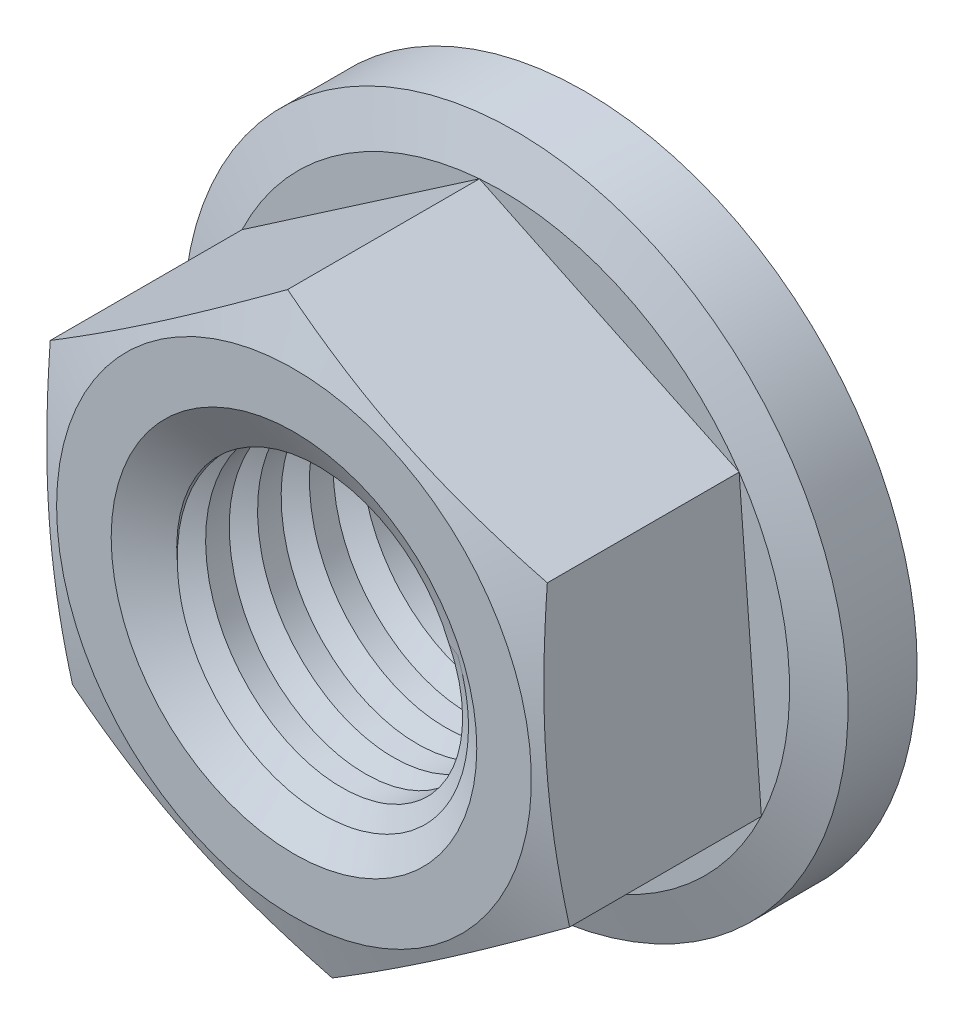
ISO-10303-21;
HEADER;
FILE_DESCRIPTION(('STEP AP214'),'2;1');
FILE_NAME('part.step','',(''),(''),'','','');
FILE_SCHEMA(('AUTOMOTIVE_DESIGN { 1 0 10303 214 1 1 1 1 }'));
ENDSEC;
DATA;
#1=APPLICATION_CONTEXT('core data for automotive mechanical design processes');
#2=APPLICATION_PROTOCOL_DEFINITION('international standard','automotive_design',2000,#1);
#3=PRODUCT_CONTEXT('',#1,'mechanical');
#4=PRODUCT('Part','Part','',(#3));
#5=PRODUCT_RELATED_PRODUCT_CATEGORY('part','',(#4));
#6=PRODUCT_DEFINITION_FORMATION('','',#4);
#7=PRODUCT_DEFINITION_CONTEXT('part definition',#1,'design');
#8=PRODUCT_DEFINITION('design','',#6,#7);
#9=PRODUCT_DEFINITION_SHAPE('','',#8);
#10=(LENGTH_UNIT() NAMED_UNIT(*) SI_UNIT(.MILLI.,.METRE.));
#11=(NAMED_UNIT(*) PLANE_ANGLE_UNIT() SI_UNIT($,.RADIAN.));
#12=(NAMED_UNIT(*) SI_UNIT($,.STERADIAN.) SOLID_ANGLE_UNIT());
#13=UNCERTAINTY_MEASURE_WITH_UNIT(LENGTH_MEASURE(1.E-05),#10,'distance_accuracy_value','');
#14=(GEOMETRIC_REPRESENTATION_CONTEXT(3) GLOBAL_UNCERTAINTY_ASSIGNED_CONTEXT((#13)) GLOBAL_UNIT_ASSIGNED_CONTEXT((#10,
#11,#12)) REPRESENTATION_CONTEXT('',''));
#15=CARTESIAN_POINT('',(0.,0.,0.));
#16=DIRECTION('',(0.,0.,1.));
#17=DIRECTION('',(1.,0.,0.));
#18=AXIS2_PLACEMENT_3D('',#15,#16,#17);
#19=CARTESIAN_POINT('',(0.536351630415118,-6.90741101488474,7.));
#20=DIRECTION('',(-0.565543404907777,0.824718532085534,0.));
#21=DIRECTION('',(-0.824718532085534,-0.565543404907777,0.));
#22=AXIS2_PLACEMENT_3D('',#19,#20,#21);
#23=PLANE('',#22);
#24=CARTESIAN_POINT('',(0.536151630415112,-6.90754816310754,6.61621953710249));
#25=CARTESIAN_POINT('',(0.77314254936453,-6.74503374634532,6.66164050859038));
#26=CARTESIAN_POINT('',(1.01072711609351,-6.58211224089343,6.70291407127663));
#27=CARTESIAN_POINT('',(1.48706203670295,-6.25546980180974,6.77547446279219));
#28=CARTESIAN_POINT('',(1.72581298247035,-6.09174846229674,6.80675553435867));
#29=CARTESIAN_POINT('',(2.20247485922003,-5.76488181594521,6.85740100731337));
#30=CARTESIAN_POINT('',(2.44037957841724,-5.60174076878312,6.87684906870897));
#31=CARTESIAN_POINT('',(2.91660976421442,-5.27517015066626,6.90293041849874));
#32=CARTESIAN_POINT('',(3.15493509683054,-5.11174067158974,6.90956723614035));
#33=CARTESIAN_POINT('',(3.63158576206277,-4.78488171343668,6.90956723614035));
#34=CARTESIAN_POINT('',(3.86991109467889,-4.62145223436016,6.90293041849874));
#35=CARTESIAN_POINT('',(4.34614128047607,-4.2948816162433,6.87684906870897));
#36=CARTESIAN_POINT('',(4.58404599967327,-4.13174056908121,6.85740100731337));
#37=CARTESIAN_POINT('',(5.06070787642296,-3.80487392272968,6.80675553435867));
#38=CARTESIAN_POINT('',(5.29945882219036,-3.64115258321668,6.77547446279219));
#39=CARTESIAN_POINT('',(5.7757937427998,-3.31451014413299,6.70291407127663));
#40=CARTESIAN_POINT('',(6.01337830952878,-3.1515886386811,6.66164050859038));
#41=CARTESIAN_POINT('',(6.2503692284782,-2.98907422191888,6.61621953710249));
#42=B_SPLINE_CURVE_WITH_KNOTS('',3,(#24,#25,#26,#27,#28,#29,#30,#31,#32,#33,#34,#35,#36,#37,#38,
#39,#40,#41),.UNSPECIFIED.,.F.,.F.,(4,2,2,2,2,2,2,2,4),(0.,0.872847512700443,1.74619702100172,
2.61329789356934,3.48015986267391,4.34702183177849,5.21412270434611,6.08747221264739,
6.96031972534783),.UNSPECIFIED.);
#43=CARTESIAN_POINT('',(0.536351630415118,-6.90741101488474,6.61625785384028));
#44=VERTEX_POINT('',#43);
#45=CARTESIAN_POINT('',(6.2501692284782,-2.98921137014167,6.61625785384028));
#46=VERTEX_POINT('',#45);
#47=EDGE_CURVE('E115',#44,#46,#42,.T.);
#48=ORIENTED_EDGE('',*,*,#47,.F.);
#49=DIRECTION('',(0.,0.,-1.));
#50=VECTOR('',#49,1.);
#51=CARTESIAN_POINT('',(0.536351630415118,-6.90741101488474,7.));
#52=LINE('',#51,#50);
#53=CARTESIAN_POINT('',(0.536351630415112,-6.90741101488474,2.));
#54=VERTEX_POINT('',#53);
#55=EDGE_CURVE('E125',#44,#54,#52,.T.);
#56=ORIENTED_EDGE('',*,*,#55,.T.);
#57=DIRECTION('',(0.824718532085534,0.565543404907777,0.));
#58=VECTOR('',#57,1.);
#59=CARTESIAN_POINT('',(0.536351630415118,-6.90741101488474,2.));
#60=LINE('',#59,#58);
#61=CARTESIAN_POINT('',(6.2501692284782,-2.98921137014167,2.));
#62=VERTEX_POINT('',#61);
#63=EDGE_CURVE('E347',#54,#62,#60,.T.);
#64=ORIENTED_EDGE('',*,*,#63,.T.);
#65=DIRECTION('',(0.,0.,-1.));
#66=VECTOR('',#65,1.);
#67=CARTESIAN_POINT('',(6.2501692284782,-2.98921137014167,7.));
#68=LINE('',#67,#66);
#69=EDGE_CURVE('E127',#46,#62,#68,.T.);
#70=ORIENTED_EDGE('',*,*,#69,.F.);
#71=EDGE_LOOP('',(#48,#56,#64,#70));
#72=FACE_BOUND('',#71,.T.);
#73=ADVANCED_FACE('F34',(#72),#23,.F.);
#74=CARTESIAN_POINT('',(6.2501692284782,-2.98921137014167,7.));
#75=DIRECTION('',(-0.996998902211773,-0.0774156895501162,0.));
#76=DIRECTION('',(0.0774156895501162,-0.996998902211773,0.));
#77=AXIS2_PLACEMENT_3D('',#74,#75,#76);
#78=PLANE('',#77);
#79=CARTESIAN_POINT('',(6.25018475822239,-2.98941137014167,6.61622615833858));
#80=CARTESIAN_POINT('',(6.22793887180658,-2.70291745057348,6.6616461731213));
#81=CARTESIAN_POINT('',(6.2056372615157,-2.41570589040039,6.7029188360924));
#82=CARTESIAN_POINT('',(6.16092461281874,-1.8398734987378,6.77547760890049));
#83=CARTESIAN_POINT('',(6.13851351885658,-1.5512519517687,6.80675796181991));
#84=CARTESIAN_POINT('',(6.09377017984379,-0.975024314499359,6.85740225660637));
#85=CARTESIAN_POINT('',(6.07143851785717,-0.687425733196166,6.87684985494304));
#86=CARTESIAN_POINT('',(6.02673569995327,-0.11171994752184,6.90293058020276));
#87=CARTESIAN_POINT('',(6.00436455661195,0.176387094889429,6.90956723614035));
#88=CARTESIAN_POINT('',(5.95962226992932,0.752601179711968,6.90956723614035));
#89=CARTESIAN_POINT('',(5.93725112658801,1.04070822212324,6.90293058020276));
#90=CARTESIAN_POINT('',(5.8925483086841,1.61641400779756,6.87684985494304));
#91=CARTESIAN_POINT('',(5.87021664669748,1.90401258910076,6.85740225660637));
#92=CARTESIAN_POINT('',(5.82547330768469,2.4802402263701,6.80675796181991));
#93=CARTESIAN_POINT('',(5.80306221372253,2.7688617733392,6.77547760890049));
#94=CARTESIAN_POINT('',(5.75834956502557,3.34469416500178,6.7029188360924));
#95=CARTESIAN_POINT('',(5.73604795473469,3.63190572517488,6.6616461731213));
#96=CARTESIAN_POINT('',(5.71380206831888,3.91839964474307,6.61622615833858));
#97=B_SPLINE_CURVE_WITH_KNOTS('',3,(#79,#80,#81,#82,#83,#84,#85,#86,#87,#88,#89,#90,#91,#92,#93,
#94,#95,#96),.UNSPECIFIED.,.F.,.F.,(4,2,2,2,2,2,2,2,4),(0.,0.872836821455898,1.7461756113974,
2.61326597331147,3.48011744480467,4.34696891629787,5.21405927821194,6.08739806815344,
6.96023488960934),.UNSPECIFIED.);
#98=CARTESIAN_POINT('',(5.71381759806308,3.91819964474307,6.61625785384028));
#99=VERTEX_POINT('',#98);
#100=EDGE_CURVE('E129',#46,#99,#97,.T.);
#101=ORIENTED_EDGE('',*,*,#100,.F.);
#102=ORIENTED_EDGE('',*,*,#69,.T.);
#103=DIRECTION('',(-0.0774156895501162,0.996998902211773,0.));
#104=VECTOR('',#103,1.);
#105=CARTESIAN_POINT('',(6.2501692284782,-2.98921137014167,2.));
#106=LINE('',#105,#104);
#107=CARTESIAN_POINT('',(5.71381759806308,3.91819964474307,2.));
#108=VERTEX_POINT('',#107);
#109=EDGE_CURVE('E348',#62,#108,#106,.T.);
#110=ORIENTED_EDGE('',*,*,#109,.T.);
#111=DIRECTION('',(0.,0.,-1.));
#112=VECTOR('',#111,1.);
#113=CARTESIAN_POINT('',(5.71381759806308,3.91819964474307,7.));
#114=LINE('',#113,#112);
#115=EDGE_CURVE('E147',#99,#108,#114,.T.);
#116=ORIENTED_EDGE('',*,*,#115,.F.);
#117=EDGE_LOOP('',(#101,#102,#110,#116));
#118=FACE_BOUND('',#117,.T.);
#119=ADVANCED_FACE('F247',(#118),#78,.F.);
#120=CARTESIAN_POINT('',(5.71381759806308,3.91819964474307,7.));
#121=DIRECTION('',(-0.431455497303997,-0.902134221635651,0.));
#122=DIRECTION('',(0.902134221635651,-0.431455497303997,0.));
#123=AXIS2_PLACEMENT_3D('',#120,#121,#122);
#124=PLANE('',#123);
#125=CARTESIAN_POINT('',(5.71401759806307,3.91810399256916,6.61622282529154));
#126=CARTESIAN_POINT('',(5.45478207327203,4.04208620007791,6.66164332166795));
#127=CARTESIAN_POINT('',(5.19489718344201,4.16637897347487,6.70291643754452));
#128=CARTESIAN_POINT('',(4.67385220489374,4.41557439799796,6.77547602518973));
#129=CARTESIAN_POINT('',(4.41269146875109,4.54047735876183,6.80675673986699));
#130=CARTESIAN_POINT('',(3.89128884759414,4.78984382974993,6.85740162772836));
#131=CARTESIAN_POINT('',(3.63105375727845,4.91430409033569,6.87684945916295));
#132=CARTESIAN_POINT('',(3.11012334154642,5.16344472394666,6.90293049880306));
#133=CARTESIAN_POINT('',(2.8494281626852,5.28812502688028,6.90956723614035));
#134=CARTESIAN_POINT('',(2.32803780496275,5.53748563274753,6.90956723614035));
#135=CARTESIAN_POINT('',(2.06734262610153,5.66216593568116,6.90293049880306));
#136=CARTESIAN_POINT('',(1.5464122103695,5.91130656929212,6.87684945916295));
#137=CARTESIAN_POINT('',(1.28617712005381,6.03576682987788,6.85740162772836));
#138=CARTESIAN_POINT('',(0.764774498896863,6.28513330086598,6.80675673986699));
#139=CARTESIAN_POINT('',(0.503613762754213,6.41003626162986,6.77547602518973));
#140=CARTESIAN_POINT('',(-0.0174312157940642,6.65923168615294,6.70291643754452));
#141=CARTESIAN_POINT('',(-0.277316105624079,6.7835244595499,6.66164332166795));
#142=CARTESIAN_POINT('',(-0.536551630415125,6.90750666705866,6.61622282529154));
#143=B_SPLINE_CURVE_WITH_KNOTS('',3,(#125,#126,#127,#128,#129,#130,#131,#132,#133,#134,#135,
#136,#137,#138,#139,#140,#141,#142),.UNSPECIFIED.,.F.,.F.,(4,2,2,2,2,2,2,2,4),(0.,
0.872842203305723,1.74618638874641,2.61328204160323,3.48013879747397,4.34699555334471,
5.21409120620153,6.08743539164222,6.96027759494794),.UNSPECIFIED.);
#144=CARTESIAN_POINT('',(-0.536351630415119,6.90741101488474,6.61625785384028));
#145=VERTEX_POINT('',#144);
#146=EDGE_CURVE('E286',#99,#145,#143,.T.);
#147=ORIENTED_EDGE('',*,*,#146,.F.);
#148=ORIENTED_EDGE('',*,*,#115,.T.);
#149=DIRECTION('',(-0.90213422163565,0.431455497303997,0.));
#150=VECTOR('',#149,1.);
#151=CARTESIAN_POINT('',(5.71381759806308,3.91819964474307,2.));
#152=LINE('',#151,#150);
#153=CARTESIAN_POINT('',(-0.536351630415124,6.90741101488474,2.));
#154=VERTEX_POINT('',#153);
#155=EDGE_CURVE('E354',#108,#154,#152,.T.);
#156=ORIENTED_EDGE('',*,*,#155,.T.);
#157=DIRECTION('',(0.,0.,-1.));
#158=VECTOR('',#157,1.);
#159=CARTESIAN_POINT('',(-0.536351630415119,6.90741101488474,7.));
#160=LINE('',#159,#158);
#161=EDGE_CURVE('E145',#145,#154,#160,.T.);
#162=ORIENTED_EDGE('',*,*,#161,.F.);
#163=EDGE_LOOP('',(#147,#148,#156,#162));
#164=FACE_BOUND('',#163,.T.);
#165=ADVANCED_FACE('F290',(#164),#124,.F.);
#166=CARTESIAN_POINT('',(-0.536351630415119,6.90741101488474,7.));
#167=DIRECTION('',(0.565543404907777,-0.824718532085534,0.));
#168=DIRECTION('',(0.824718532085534,0.565543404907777,0.));
#169=AXIS2_PLACEMENT_3D('',#166,#167,#168);
#170=PLANE('',#169);
#171=CARTESIAN_POINT('',(-0.536151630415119,6.90754816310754,6.61621953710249));
#172=CARTESIAN_POINT('',(-0.773142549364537,6.74503374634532,6.66164050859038));
#173=CARTESIAN_POINT('',(-1.01072711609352,6.58211224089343,6.70291407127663));
#174=CARTESIAN_POINT('',(-1.48706203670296,6.25546980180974,6.77547446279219));
#175=CARTESIAN_POINT('',(-1.72581298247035,6.09174846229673,6.80675553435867));
#176=CARTESIAN_POINT('',(-2.20247485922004,5.76488181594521,6.85740100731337));
#177=CARTESIAN_POINT('',(-2.44037957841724,5.60174076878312,6.87684906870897));
#178=CARTESIAN_POINT('',(-2.91660976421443,5.27517015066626,6.90293041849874));
#179=CARTESIAN_POINT('',(-3.15493509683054,5.11174067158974,6.90956723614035));
#180=CARTESIAN_POINT('',(-3.63158576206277,4.78488171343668,6.90956723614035));
#181=CARTESIAN_POINT('',(-3.86991109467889,4.62145223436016,6.90293041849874));
#182=CARTESIAN_POINT('',(-4.34614128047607,4.2948816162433,6.87684906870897));
#183=CARTESIAN_POINT('',(-4.58404599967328,4.13174056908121,6.85740100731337));
#184=CARTESIAN_POINT('',(-5.06070787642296,3.80487392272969,6.80675553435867));
#185=CARTESIAN_POINT('',(-5.29945882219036,3.64115258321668,6.77547446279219));
#186=CARTESIAN_POINT('',(-5.7757937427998,3.31451014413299,6.70291407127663));
#187=CARTESIAN_POINT('',(-6.01337830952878,3.1515886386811,6.66164050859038));
#188=CARTESIAN_POINT('',(-6.2503692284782,2.98907422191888,6.61621953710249));
#189=B_SPLINE_CURVE_WITH_KNOTS('',3,(#171,#172,#173,#174,#175,#176,#177,#178,#179,#180,#181,
#182,#183,#184,#185,#186,#187,#188),.UNSPECIFIED.,.F.,.F.,(4,2,2,2,2,2,2,2,4),(0.,
0.872847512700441,1.74619702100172,2.61329789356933,3.48015986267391,4.34702183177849,
5.2141227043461,6.08747221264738,6.96031972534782),.UNSPECIFIED.);
#190=CARTESIAN_POINT('',(-6.2501692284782,2.98921137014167,6.61625785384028));
#191=VERTEX_POINT('',#190);
#192=EDGE_CURVE('E281',#145,#191,#189,.T.);
#193=ORIENTED_EDGE('',*,*,#192,.F.);
#194=ORIENTED_EDGE('',*,*,#161,.T.);
#195=DIRECTION('',(-0.824718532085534,-0.565543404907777,0.));
#196=VECTOR('',#195,1.);
#197=CARTESIAN_POINT('',(-0.536351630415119,6.90741101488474,2.));
#198=LINE('',#197,#196);
#199=CARTESIAN_POINT('',(-6.2501692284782,2.98921137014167,2.));
#200=VERTEX_POINT('',#199);
#201=EDGE_CURVE('E357',#154,#200,#198,.T.);
#202=ORIENTED_EDGE('',*,*,#201,.T.);
#203=DIRECTION('',(0.,0.,-1.));
#204=VECTOR('',#203,1.);
#205=CARTESIAN_POINT('',(-6.2501692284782,2.98921137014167,7.));
#206=LINE('',#205,#204);
#207=EDGE_CURVE('E138',#191,#200,#206,.T.);
#208=ORIENTED_EDGE('',*,*,#207,.F.);
#209=EDGE_LOOP('',(#193,#194,#202,#208));
#210=FACE_BOUND('',#209,.T.);
#211=ADVANCED_FACE('F293',(#210),#170,.F.);
#212=CARTESIAN_POINT('',(-6.2501692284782,2.98921137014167,7.));
#213=DIRECTION('',(0.996998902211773,0.077415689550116,0.));
#214=DIRECTION('',(-0.077415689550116,0.996998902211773,0.));
#215=AXIS2_PLACEMENT_3D('',#212,#213,#214);
#216=PLANE('',#215);
#217=CARTESIAN_POINT('',(-6.25018475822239,2.98941137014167,6.61622615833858));
#218=CARTESIAN_POINT('',(-6.22793887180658,2.70291745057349,6.6616461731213));
#219=CARTESIAN_POINT('',(-6.2056372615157,2.41570589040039,6.7029188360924));
#220=CARTESIAN_POINT('',(-6.16092461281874,1.8398734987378,6.77547760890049));
#221=CARTESIAN_POINT('',(-6.13851351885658,1.5512519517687,6.80675796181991));
#222=CARTESIAN_POINT('',(-6.09377017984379,0.97502431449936,6.85740225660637));
#223=CARTESIAN_POINT('',(-6.07143851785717,0.687425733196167,6.87684985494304));
#224=CARTESIAN_POINT('',(-6.02673569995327,0.111719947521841,6.90293058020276));
#225=CARTESIAN_POINT('',(-6.00436455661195,-0.176387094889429,6.90956723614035));
#226=CARTESIAN_POINT('',(-5.95962226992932,-0.752601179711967,6.90956723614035));
#227=CARTESIAN_POINT('',(-5.93725112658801,-1.04070822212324,6.90293058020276));
#228=CARTESIAN_POINT('',(-5.8925483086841,-1.61641400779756,6.87684985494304));
#229=CARTESIAN_POINT('',(-5.87021664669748,-1.90401258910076,6.85740225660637));
#230=CARTESIAN_POINT('',(-5.82547330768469,-2.4802402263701,6.80675796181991));
#231=CARTESIAN_POINT('',(-5.80306221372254,-2.7688617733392,6.77547760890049));
#232=CARTESIAN_POINT('',(-5.75834956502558,-3.34469416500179,6.7029188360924));
#233=CARTESIAN_POINT('',(-5.73604795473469,-3.63190572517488,6.66164617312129));
#234=CARTESIAN_POINT('',(-5.71380206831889,-3.91839964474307,6.61622615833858));
#235=B_SPLINE_CURVE_WITH_KNOTS('',3,(#217,#218,#219,#220,#221,#222,#223,#224,#225,#226,#227,
#228,#229,#230,#231,#232,#233,#234),.UNSPECIFIED.,.F.,.F.,(4,2,2,2,2,2,2,2,4),(0.,
0.872836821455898,1.7461756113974,2.61326597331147,3.48011744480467,4.34696891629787,
5.21405927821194,6.08739806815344,6.96023488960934),.UNSPECIFIED.);
#236=CARTESIAN_POINT('',(-5.71381759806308,-3.91819964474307,6.61625785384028));
#237=VERTEX_POINT('',#236);
#238=EDGE_CURVE('E54',#191,#237,#235,.T.);
#239=ORIENTED_EDGE('',*,*,#238,.F.);
#240=ORIENTED_EDGE('',*,*,#207,.T.);
#241=DIRECTION('',(0.077415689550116,-0.996998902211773,0.));
#242=VECTOR('',#241,1.);
#243=CARTESIAN_POINT('',(-6.2501692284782,2.98921137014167,2.));
#244=LINE('',#243,#242);
#245=CARTESIAN_POINT('',(-5.71381759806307,-3.91819964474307,2.));
#246=VERTEX_POINT('',#245);
#247=EDGE_CURVE('E140',#200,#246,#244,.T.);
#248=ORIENTED_EDGE('',*,*,#247,.T.);
#249=DIRECTION('',(0.,0.,-1.));
#250=VECTOR('',#249,1.);
#251=CARTESIAN_POINT('',(-5.71381759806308,-3.91819964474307,7.));
#252=LINE('',#251,#250);
#253=EDGE_CURVE('E136',#237,#246,#252,.T.);
#254=ORIENTED_EDGE('',*,*,#253,.F.);
#255=EDGE_LOOP('',(#239,#240,#248,#254));
#256=FACE_BOUND('',#255,.T.);
#257=ADVANCED_FACE('F297',(#256),#216,.F.);
#258=CARTESIAN_POINT('',(-5.71381759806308,-3.91819964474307,7.));
#259=DIRECTION('',(0.431455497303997,0.902134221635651,0.));
#260=DIRECTION('',(-0.902134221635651,0.431455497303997,0.));
#261=AXIS2_PLACEMENT_3D('',#258,#259,#260);
#262=PLANE('',#261);
#263=CARTESIAN_POINT('',(-5.71401759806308,-3.91810399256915,6.61622282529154));
#264=CARTESIAN_POINT('',(-5.45478207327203,-4.04208620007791,6.66164332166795));
#265=CARTESIAN_POINT('',(-5.19489718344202,-4.16637897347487,6.70291643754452));
#266=CARTESIAN_POINT('',(-4.67385220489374,-4.41557439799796,6.77547602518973));
#267=CARTESIAN_POINT('',(-4.41269146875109,-4.54047735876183,6.80675673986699));
#268=CARTESIAN_POINT('',(-3.89128884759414,-4.78984382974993,6.85740162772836));
#269=CARTESIAN_POINT('',(-3.63105375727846,-4.91430409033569,6.87684945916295));
#270=CARTESIAN_POINT('',(-3.11012334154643,-5.16344472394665,6.90293049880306));
#271=CARTESIAN_POINT('',(-2.8494281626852,-5.28812502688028,6.90956723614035));
#272=CARTESIAN_POINT('',(-2.32803780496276,-5.53748563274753,6.90956723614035));
#273=CARTESIAN_POINT('',(-2.06734262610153,-5.66216593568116,6.90293049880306));
#274=CARTESIAN_POINT('',(-1.5464122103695,-5.91130656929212,6.87684945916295));
#275=CARTESIAN_POINT('',(-1.28617712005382,-6.03576682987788,6.85740162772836));
#276=CARTESIAN_POINT('',(-0.764774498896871,-6.28513330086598,6.80675673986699));
#277=CARTESIAN_POINT('',(-0.50361376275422,-6.41003626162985,6.77547602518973));
#278=CARTESIAN_POINT('',(0.0174312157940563,-6.65923168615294,6.70291643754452));
#279=CARTESIAN_POINT('',(0.27731610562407,-6.7835244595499,6.66164332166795));
#280=CARTESIAN_POINT('',(0.536551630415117,-6.90750666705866,6.61622282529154));
#281=B_SPLINE_CURVE_WITH_KNOTS('',3,(#263,#264,#265,#266,#267,#268,#269,#270,#271,#272,#273,
#274,#275,#276,#277,#278,#279,#280),.UNSPECIFIED.,.F.,.F.,(4,2,2,2,2,2,2,2,4),(0.,
0.872842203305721,1.74618638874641,2.61328204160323,3.48013879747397,4.3469955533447,
5.21409120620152,6.08743539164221,6.96027759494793),.UNSPECIFIED.);
#282=EDGE_CURVE('E112',#237,#44,#281,.T.);
#283=ORIENTED_EDGE('',*,*,#282,.F.);
#284=ORIENTED_EDGE('',*,*,#253,.T.);
#285=DIRECTION('',(0.90213422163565,-0.431455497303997,0.));
#286=VECTOR('',#285,1.);
#287=CARTESIAN_POINT('',(-5.71381759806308,-3.91819964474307,2.));
#288=LINE('',#287,#286);
#289=EDGE_CURVE('E134',#246,#54,#288,.T.);
#290=ORIENTED_EDGE('',*,*,#289,.T.);
#291=ORIENTED_EDGE('',*,*,#55,.F.);
#292=EDGE_LOOP('',(#283,#284,#290,#291));
#293=FACE_BOUND('',#292,.T.);
#294=ADVANCED_FACE('F132',(#293),#262,.F.);
#295=CARTESIAN_POINT('',(0.,0.,7.));
#296=DIRECTION('',(0.,0.,1.));
#297=DIRECTION('',(1.,0.,0.));
#298=AXIS2_PLACEMENT_3D('',#295,#296,#297);
#299=PLANE('',#298);
#300=CARTESIAN_POINT('',(0.,0.,7.));
#301=DIRECTION('',(0.,0.,1.));
#302=DIRECTION('',(1.,0.,0.));
#303=AXIS2_PLACEMENT_3D('',#300,#301,#302);
#304=CIRCLE('',#303,4.4);
#305=CARTESIAN_POINT('',(4.4,0.,7.));
#306=VERTEX_POINT('',#305);
#307=EDGE_CURVE('E162',#306,#306,#304,.F.);
#308=ORIENTED_EDGE('',*,*,#307,.T.);
#309=EDGE_LOOP('',(#308));
#310=FACE_BOUND('',#309,.T.);
#311=CARTESIAN_POINT('',(0.,0.,7.));
#312=DIRECTION('',(0.,0.,-1.));
#313=DIRECTION('',(-1.,0.,0.));
#314=AXIS2_PLACEMENT_3D('',#311,#312,#313);
#315=CIRCLE('',#314,5.71381759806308);
#316=CARTESIAN_POINT('',(-5.71381759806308,0.,7.));
#317=VERTEX_POINT('',#316);
#318=EDGE_CURVE('E120',#317,#317,#315,.T.);
#319=ORIENTED_EDGE('',*,*,#318,.F.);
#320=EDGE_LOOP('',(#319));
#321=FACE_BOUND('',#320,.T.);
#322=ADVANCED_FACE('F241',(#310,#321),#299,.T.);
#323=CARTESIAN_POINT('',(0.,0.,2.));
#324=DIRECTION('',(0.,0.,1.));
#325=DIRECTION('',(1.,0.,0.));
#326=AXIS2_PLACEMENT_3D('',#323,#324,#325);
#327=PLANE('',#326);
#328=ORIENTED_EDGE('',*,*,#155,.F.);
#329=CARTESIAN_POINT('',(0.,0.,2.));
#330=DIRECTION('',(0.,0.,-1.));
#331=DIRECTION('',(-1.,0.,0.));
#332=AXIS2_PLACEMENT_3D('',#329,#330,#331);
#333=CIRCLE('',#332,6.92820323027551);
#334=EDGE_CURVE('E350',#154,#108,#333,.T.);
#335=ORIENTED_EDGE('',*,*,#334,.F.);
#336=EDGE_LOOP('',(#328,#335));
#337=FACE_BOUND('',#336,.T.);
#338=ADVANCED_FACE('F236',(#337),#327,.T.);
#339=ORIENTED_EDGE('',*,*,#201,.F.);
#340=EDGE_CURVE('E229',#200,#154,#333,.T.);
#341=ORIENTED_EDGE('',*,*,#340,.F.);
#342=EDGE_LOOP('',(#339,#341));
#343=FACE_BOUND('',#342,.T.);
#344=ADVANCED_FACE('F240',(#343),#327,.T.);
#345=ORIENTED_EDGE('',*,*,#247,.F.);
#346=EDGE_CURVE('E228',#246,#200,#333,.T.);
#347=ORIENTED_EDGE('',*,*,#346,.F.);
#348=EDGE_LOOP('',(#345,#347));
#349=FACE_BOUND('',#348,.T.);
#350=ADVANCED_FACE('F497',(#349),#327,.T.);
#351=ORIENTED_EDGE('',*,*,#289,.F.);
#352=EDGE_CURVE('E368',#54,#246,#333,.T.);
#353=ORIENTED_EDGE('',*,*,#352,.F.);
#354=EDGE_LOOP('',(#351,#353));
#355=FACE_BOUND('',#354,.T.);
#356=ADVANCED_FACE('F366',(#355),#327,.T.);
#357=ORIENTED_EDGE('',*,*,#63,.F.);
#358=EDGE_CURVE('E369',#62,#54,#333,.T.);
#359=ORIENTED_EDGE('',*,*,#358,.F.);
#360=EDGE_LOOP('',(#357,#359));
#361=FACE_BOUND('',#360,.T.);
#362=ADVANCED_FACE('F384',(#361),#327,.T.);
#363=ORIENTED_EDGE('',*,*,#109,.F.);
#364=EDGE_CURVE('E370',#108,#62,#333,.T.);
#365=ORIENTED_EDGE('',*,*,#364,.F.);
#366=EDGE_LOOP('',(#363,#365));
#367=FACE_BOUND('',#366,.T.);
#368=ADVANCED_FACE('F243',(#367),#327,.T.);
#369=CARTESIAN_POINT('',(0.,0.,2.));
#370=DIRECTION('',(0.,0.,-1.));
#371=DIRECTION('',(-1.,0.,0.));
#372=AXIS2_PLACEMENT_3D('',#369,#370,#371);
#373=CYLINDRICAL_SURFACE('',#372,8.);
#374=CARTESIAN_POINT('',(0.,0.,0.));
#375=DIRECTION('',(0.,0.,1.));
#376=DIRECTION('',(1.,0.,0.));
#377=AXIS2_PLACEMENT_3D('',#374,#375,#376);
#378=CIRCLE('',#377,8.);
#379=CARTESIAN_POINT('',(8.,0.,0.));
#380=VERTEX_POINT('',#379);
#381=EDGE_CURVE('E150',#380,#380,#378,.T.);
#382=ORIENTED_EDGE('',*,*,#381,.T.);
#383=EDGE_LOOP('',(#382));
#384=FACE_BOUND('',#383,.T.);
#385=CARTESIAN_POINT('',(0.,0.,1.66332251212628));
#386=DIRECTION('',(0.,0.,-1.));
#387=DIRECTION('',(-1.,0.,0.));
#388=AXIS2_PLACEMENT_3D('',#385,#386,#387);
#389=CIRCLE('',#388,8.);
#390=CARTESIAN_POINT('',(-8.,0.,1.66332251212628));
#391=VERTEX_POINT('',#390);
#392=EDGE_CURVE('E345',#391,#391,#389,.F.);
#393=ORIENTED_EDGE('',*,*,#392,.F.);
#394=EDGE_LOOP('',(#393));
#395=FACE_BOUND('',#394,.T.);
#396=ADVANCED_FACE('F211',(#384,#395),#373,.T.);
#397=CARTESIAN_POINT('',(0.,0.,0.));
#398=DIRECTION('',(0.,0.,1.));
#399=DIRECTION('',(1.,0.,0.));
#400=AXIS2_PLACEMENT_3D('',#397,#398,#399);
#401=PLANE('',#400);
#402=CARTESIAN_POINT('',(1.69961699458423,2.35882247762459,0.));
#403=CARTESIAN_POINT('',(1.63803967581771,2.41530987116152,0.));
#404=CARTESIAN_POINT('',(1.57406581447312,2.4691823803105,0.));
#405=CARTESIAN_POINT('',(1.44181532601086,2.57133725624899,0.));
#406=CARTESIAN_POINT('',(1.37353933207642,2.61962044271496,0.));
#407=CARTESIAN_POINT('',(1.23335069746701,2.7101277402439,0.));
#408=CARTESIAN_POINT('',(1.16144863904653,2.75236824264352,0.));
#409=CARTESIAN_POINT('',(1.01434335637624,2.83065508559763,0.));
#410=CARTESIAN_POINT('',(0.939139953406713,2.86670109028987,0.));
#411=CARTESIAN_POINT('',(0.785870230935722,2.93238820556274,0.));
#412=CARTESIAN_POINT('',(0.707800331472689,2.96202096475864,0.));
#413=CARTESIAN_POINT('',(0.549454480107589,3.01460784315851,0.));
#414=CARTESIAN_POINT('',(0.469178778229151,3.03756271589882,0.));
#415=CARTESIAN_POINT('',(0.306954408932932,3.07667436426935,0.));
#416=CARTESIAN_POINT('',(0.225005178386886,3.09282881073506,0.));
#417=CARTESIAN_POINT('',(0.0600311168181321,3.11812895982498,0.));
#418=CARTESIAN_POINT('',(-0.0229938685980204,3.12727364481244,0.));
#419=CARTESIAN_POINT('',(-0.190149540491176,3.13920165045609,0.));
#420=CARTESIAN_POINT('',(-0.274283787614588,3.14193437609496,0.));
#421=CARTESIAN_POINT('',(-0.442491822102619,3.14084682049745,0.));
#422=CARTESIAN_POINT('',(-0.526565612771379,3.13702692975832,0.));
#423=CARTESIAN_POINT('',(-0.777994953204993,3.11575821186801,0.));
#424=CARTESIAN_POINT('',(-0.94461366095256,3.0885042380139,0.));
#425=CARTESIAN_POINT('',(-1.28519769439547,3.00508710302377,0.));
#426=CARTESIAN_POINT('',(-1.45862778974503,2.94671564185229,0.));
#427=CARTESIAN_POINT('',(-1.70939537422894,2.83807659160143,0.));
#428=CARTESIAN_POINT('',(-1.79144293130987,2.7983360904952,0.));
#429=CARTESIAN_POINT('',(-1.95191156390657,2.71209112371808,0.));
#430=CARTESIAN_POINT('',(-2.03033313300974,2.66558758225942,0.));
#431=CARTESIAN_POINT('',(-2.18291993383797,2.5662161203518,0.));
#432=CARTESIAN_POINT('',(-2.25708976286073,2.51335527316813,0.));
#433=CARTESIAN_POINT('',(-2.36477671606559,2.42951688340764,0.));
#434=CARTESIAN_POINT('',(-2.40008187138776,2.40080907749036,0.));
#435=CARTESIAN_POINT('',(-2.46955202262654,2.342034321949,0.));
#436=CARTESIAN_POINT('',(-2.50371678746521,2.31196709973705,0.));
#437=CARTESIAN_POINT('',(-2.60445808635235,2.21977599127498,0.));
#438=CARTESIAN_POINT('',(-2.66925584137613,2.15568282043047,0.));
#439=CARTESIAN_POINT('',(-2.79367550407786,2.02266399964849,0.));
#440=CARTESIAN_POINT('',(-2.85329596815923,1.95373701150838,0.));
#441=CARTESIAN_POINT('',(-3.0300515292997,1.73252390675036,0.));
#442=CARTESIAN_POINT('',(-3.13772201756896,1.5724921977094,0.));
#443=CARTESIAN_POINT('',(-3.3253490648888,1.2371005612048,0.));
#444=CARTESIAN_POINT('',(-3.40532633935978,1.06175221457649,0.));
#445=CARTESIAN_POINT('',(-3.50392894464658,0.788354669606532,0.));
#446=CARTESIAN_POINT('',(-3.53348769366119,0.694116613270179,0.));
#447=CARTESIAN_POINT('',(-3.58458349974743,0.503462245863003,0.));
#448=CARTESIAN_POINT('',(-3.6061212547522,0.407046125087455,0.));
#449=CARTESIAN_POINT('',(-3.63230374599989,0.261315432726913,0.));
#450=CARTESIAN_POINT('',(-3.64001287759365,0.212529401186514,0.));
#451=CARTESIAN_POINT('',(-3.65336110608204,0.114671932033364,0.));
#452=CARTESIAN_POINT('',(-3.65900022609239,0.0656004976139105,0.));
#453=CARTESIAN_POINT('',(-3.66825717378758,-0.0327370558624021,0.));
#454=CARTESIAN_POINT('',(-3.67187474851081,-0.0820031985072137,0.));
#455=CARTESIAN_POINT('',(-3.67720543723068,-0.180636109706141,0.));
#456=CARTESIAN_POINT('',(-3.67891849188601,-0.230002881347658,0.));
#457=CARTESIAN_POINT('',(-3.68117324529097,-0.379739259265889,0.));
#458=CARTESIAN_POINT('',(-3.67868245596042,-0.480175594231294,0.));
#459=CARTESIAN_POINT('',(-3.66574092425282,-0.680487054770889,0.));
#460=CARTESIAN_POINT('',(-3.65529095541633,-0.78036223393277,0.));
#461=CARTESIAN_POINT('',(-3.61206334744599,-1.07820247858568,0.));
#462=CARTESIAN_POINT('',(-3.56741090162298,-1.27458500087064,0.));
#463=CARTESIAN_POINT('',(-3.44396827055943,-1.66924108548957,0.));
#464=CARTESIAN_POINT('',(-3.3632847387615,-1.86691673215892,0.));
#465=CARTESIAN_POINT('',(-3.16980143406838,-2.24607247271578,0.));
#466=CARTESIAN_POINT('',(-3.05700019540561,-2.42755182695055,0.));
#467=CARTESIAN_POINT('',(-2.88625226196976,-2.65673117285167,0.));
#468=CARTESIAN_POINT('',(-2.84086104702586,-2.71409598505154,0.));
#469=CARTESIAN_POINT('',(-2.77037483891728,-2.79812799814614,0.));
#470=CARTESIAN_POINT('',(-2.74648169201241,-2.82580051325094,0.));
#471=CARTESIAN_POINT('',(-2.69796648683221,-2.8804994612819,0.));
#472=CARTESIAN_POINT('',(-2.67334438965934,-2.90752585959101,0.));
#473=CARTESIAN_POINT('',(-2.59848641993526,-2.98749017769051,0.));
#474=CARTESIAN_POINT('',(-2.54716769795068,-3.03942183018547,0.));
#475=CARTESIAN_POINT('',(-2.44181060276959,-3.14043843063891,0.));
#476=CARTESIAN_POINT('',(-2.38777249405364,-3.18952365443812,0.));
#477=CARTESIAN_POINT('',(-2.33245553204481,-3.23711080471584,0.));
#478=B_SPLINE_CURVE_WITH_KNOTS('',3,(#402,#403,#404,#405,#406,#407,#408,#409,#410,#411,#412,
#413,#414,#415,#416,#417,#418,#419,#420,#421,#422,#423,#424,#425,#426,#427,#428,#429,#430,#431,
#432,#433,#434,#435,#436,#437,#438,#439,#440,#441,#442,#443,#444,#445,#446,#447,#448,#449,#450,
#451,#452,#453,#454,#455,#456,#457,#458,#459,#460,#461,#462,#463,#464,#465,#466,#467,#468,#469,
#470,#471,#472,#473,#474,#475,#476,#477),.UNSPECIFIED.,.F.,.F.,(4,2,2,2,2,2,2,2,2,2,2,2,2,2,2,2,
2,2,2,2,2,2,2,2,2,2,2,2,2,2,2,2,2,2,2,2,2,4),(0.,0.250609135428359,0.501181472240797,
0.751060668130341,1.00095340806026,1.25116962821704,1.50135760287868,1.7516311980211,
2.00194111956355,2.25421962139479,2.50648308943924,3.01084586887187,3.55700024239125,
3.83022786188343,4.10341817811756,4.37630730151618,4.51278554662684,4.64929128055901,
4.92240067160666,5.19558597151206,5.77144932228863,6.34688097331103,6.64288810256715,
6.93886946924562,7.08700863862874,7.23514615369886,7.38330220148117,7.53146286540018,
7.83250029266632,8.13350846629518,8.7349233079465,9.37254493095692,10.0101956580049,
10.2295637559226,10.3392289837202,10.4489000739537,10.6678174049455,10.8867134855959),.UNSPECIFIED.);
#479=CARTESIAN_POINT('',(-2.44167010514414,-3.13967550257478,0.));
#480=VERTEX_POINT('',#479);
#481=CARTESIAN_POINT('',(-2.33245553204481,-3.23711080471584,0.));
#482=VERTEX_POINT('',#481);
#483=EDGE_CURVE('E190',#480,#482,#478,.T.);
#484=ORIENTED_EDGE('',*,*,#483,.T.);
#485=CARTESIAN_POINT('',(-2.33245553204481,-3.23711080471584,0.));
#486=CARTESIAN_POINT('',(-2.23849991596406,-3.29323176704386,0.));
#487=CARTESIAN_POINT('',(-2.14217002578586,-3.34537407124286,0.));
#488=CARTESIAN_POINT('',(-1.94546238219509,-3.44137615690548,0.));
#489=CARTESIAN_POINT('',(-1.84508444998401,-3.48523557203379,0.));
#490=CARTESIAN_POINT('',(-1.64085647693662,-3.56439334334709,0.));
#491=CARTESIAN_POINT('',(-1.53700206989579,-3.59968043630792,0.));
#492=CARTESIAN_POINT('',(-1.32668981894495,-3.66136898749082,0.));
#493=CARTESIAN_POINT('',(-1.22023203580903,-3.68777065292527,0.));
#494=CARTESIAN_POINT('',(-1.0055229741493,-3.73148645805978,0.));
#495=CARTESIAN_POINT('',(-0.897272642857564,-3.74880524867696,0.));
#496=CARTESIAN_POINT('',(-0.679685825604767,-3.77426345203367,0.));
#497=CARTESIAN_POINT('',(-0.570349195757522,-3.78240163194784,0.));
#498=CARTESIAN_POINT('',(-0.351454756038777,-3.78940667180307,0.));
#499=CARTESIAN_POINT('',(-0.241897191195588,-3.78828089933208,0.));
#500=CARTESIAN_POINT('',(-0.0779512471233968,-3.77974429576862,0.));
#501=CARTESIAN_POINT('',(-0.0233652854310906,-3.77575711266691,0.));
#502=CARTESIAN_POINT('',(0.0855756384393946,-3.76535787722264,0.));
#503=CARTESIAN_POINT('',(0.139930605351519,-3.75894587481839,0.));
#504=CARTESIAN_POINT('',(0.301657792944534,-3.73613537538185,0.));
#505=CARTESIAN_POINT('',(0.408542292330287,-3.71611995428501,0.));
#506=CARTESIAN_POINT('',(0.620079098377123,-3.66658615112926,0.));
#507=CARTESIAN_POINT('',(0.724731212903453,-3.63706695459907,0.));
#508=CARTESIAN_POINT('',(0.930969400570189,-3.56874632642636,0.));
#509=CARTESIAN_POINT('',(1.0325553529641,-3.52994452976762,0.));
#510=CARTESIAN_POINT('',(1.23182852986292,-3.44337085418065,0.));
#511=CARTESIAN_POINT('',(1.32951584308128,-3.39559917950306,0.));
#512=CARTESIAN_POINT('',(1.51429629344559,-3.29469553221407,0.));
#513=CARTESIAN_POINT('',(1.60167094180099,-3.24207816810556,0.));
#514=CARTESIAN_POINT('',(1.77166780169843,-3.12966393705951,0.));
#515=CARTESIAN_POINT('',(1.85429025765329,-3.06986743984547,0.));
#516=CARTESIAN_POINT('',(2.01420610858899,-2.94351947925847,0.));
#517=CARTESIAN_POINT('',(2.09149923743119,-2.87696767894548,0.));
#518=CARTESIAN_POINT('',(2.24019255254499,-2.73757266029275,0.));
#519=CARTESIAN_POINT('',(2.31159223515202,-2.66472890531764,0.));
#520=CARTESIAN_POINT('',(2.44820258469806,-2.51314211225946,0.));
#521=CARTESIAN_POINT('',(2.5133992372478,-2.43438640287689,0.));
#522=CARTESIAN_POINT('',(2.63628827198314,-2.27122515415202,0.));
#523=CARTESIAN_POINT('',(2.69398181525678,-2.18682049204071,0.));
#524=CARTESIAN_POINT('',(2.80140195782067,-2.01318504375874,0.));
#525=CARTESIAN_POINT('',(2.85113488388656,-1.92395816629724,0.));
#526=CARTESIAN_POINT('',(2.94225887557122,-1.74132685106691,0.));
#527=CARTESIAN_POINT('',(2.98364916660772,-1.64792202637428,0.));
#528=CARTESIAN_POINT('',(3.05524813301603,-1.46411260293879,0.));
#529=CARTESIAN_POINT('',(3.08602060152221,-1.37392700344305,0.));
#530=CARTESIAN_POINT('',(3.13977247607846,-1.19126334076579,0.));
#531=CARTESIAN_POINT('',(3.16275213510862,-1.09878535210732,0.));
#532=CARTESIAN_POINT('',(3.20076208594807,-0.912142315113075,0.));
#533=CARTESIAN_POINT('',(3.21578668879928,-0.817976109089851,0.));
#534=CARTESIAN_POINT('',(3.23776222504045,-0.62868899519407,0.));
#535=CARTESIAN_POINT('',(3.24471189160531,-0.5335679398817,0.));
#536=CARTESIAN_POINT('',(3.25042952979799,-0.344002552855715,0.));
#537=CARTESIAN_POINT('',(3.24927555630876,-0.24956051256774,0.));
#538=CARTESIAN_POINT('',(3.23908739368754,-0.061104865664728,0.));
#539=CARTESIAN_POINT('',(3.23005450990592,0.0329088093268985,0.));
#540=CARTESIAN_POINT('',(3.20339541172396,0.219618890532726,0.));
#541=CARTESIAN_POINT('',(3.1857786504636,0.312316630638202,0.));
#542=CARTESIAN_POINT('',(3.14214115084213,0.495712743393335,0.));
#543=CARTESIAN_POINT('',(3.11612012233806,0.586411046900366,0.));
#544=CARTESIAN_POINT('',(3.0573505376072,0.760661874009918,0.));
#545=CARTESIAN_POINT('',(3.02499397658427,0.844346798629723,0.));
#546=CARTESIAN_POINT('',(2.95310530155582,1.00857490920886,0.));
#547=CARTESIAN_POINT('',(2.91357331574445,1.08911815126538,0.));
#548=CARTESIAN_POINT('',(2.82759955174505,1.24650514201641,0.));
#549=CARTESIAN_POINT('',(2.78115274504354,1.3233461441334,0.));
#550=CARTESIAN_POINT('',(2.68171645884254,1.47268547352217,0.));
#551=CARTESIAN_POINT('',(2.6287260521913,1.54518318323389,0.));
#552=CARTESIAN_POINT('',(2.51263016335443,1.69025990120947,0.));
#553=CARTESIAN_POINT('',(2.44907337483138,1.76247819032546,0.));
#554=CARTESIAN_POINT('',(2.31546351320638,1.9006327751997,0.));
#555=CARTESIAN_POINT('',(2.24541111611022,1.96656972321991,0.));
#556=CARTESIAN_POINT('',(2.13596125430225,2.06043378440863,0.));
#557=CARTESIAN_POINT('',(2.09871713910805,2.09090445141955,0.));
#558=CARTESIAN_POINT('',(2.02272866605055,2.14991801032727,0.));
#559=CARTESIAN_POINT('',(1.9839844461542,2.17846107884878,0.));
#560=CARTESIAN_POINT('',(1.90506341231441,2.23353213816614,0.));
#561=CARTESIAN_POINT('',(1.86488591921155,2.26005915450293,0.));
#562=CARTESIAN_POINT('',(1.78321161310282,2.31102554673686,0.));
#563=CARTESIAN_POINT('',(1.74171441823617,2.33546431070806,0.));
#564=CARTESIAN_POINT('',(1.69961699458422,2.3588224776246,0.));
#565=B_SPLINE_CURVE_WITH_KNOTS('',3,(#485,#486,#487,#488,#489,#490,#491,#492,#493,#494,#495,
#496,#497,#498,#499,#500,#501,#502,#503,#504,#505,#506,#507,#508,#509,#510,#511,#512,#513,#514,
#515,#516,#517,#518,#519,#520,#521,#522,#523,#524,#525,#526,#527,#528,#529,#530,#531,#532,#533,
#534,#535,#536,#537,#538,#539,#540,#541,#542,#543,#544,#545,#546,#547,#548,#549,#550,#551,#552,
#553,#554,#555,#556,#557,#558,#559,#560,#561,#562,#563,#564),.UNSPECIFIED.,.F.,.F.,(4,2,2,2,2,2,
2,2,2,2,2,2,2,2,2,2,2,2,2,2,2,2,2,2,2,2,2,2,2,2,2,2,2,2,2,2,2,2,2,4),(0.,0.328221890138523,
0.656458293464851,0.985123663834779,1.31378136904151,1.64227061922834,1.97080397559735,
2.2990760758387,2.46322649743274,2.62737353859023,2.95312390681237,3.2789021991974,
3.60469330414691,3.93047699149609,4.23610149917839,4.54171027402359,4.847334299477,
5.15298441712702,5.45930945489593,5.76558703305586,6.07161997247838,6.37768131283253,
6.66321339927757,6.94873621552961,7.23446294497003,7.52023449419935,7.80325727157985,
8.08623316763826,8.3688981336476,8.65157285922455,8.92040048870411,9.18922331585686,
9.45824259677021,9.72730003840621,10.0154876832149,10.3036453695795,10.4479606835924,
10.5922627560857,10.7366341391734,10.8810476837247),.UNSPECIFIED.);
#566=CARTESIAN_POINT('',(-2.20650019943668,-3.30917996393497,0.));
#567=VERTEX_POINT('',#566);
#568=EDGE_CURVE('E219',#482,#567,#565,.T.);
#569=ORIENTED_EDGE('',*,*,#568,.T.);
#570=CARTESIAN_POINT('',(0.,0.,0.));
#571=DIRECTION('',(0.,0.,1.));
#572=DIRECTION('',(1.,0.,0.));
#573=AXIS2_PLACEMENT_3D('',#570,#571,#572);
#574=CIRCLE('',#573,3.97735026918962);
#575=EDGE_CURVE('E153',#567,#480,#574,.T.);
#576=ORIENTED_EDGE('',*,*,#575,.T.);
#577=EDGE_LOOP('',(#484,#569,#576));
#578=FACE_BOUND('',#577,.T.);
#579=ORIENTED_EDGE('',*,*,#381,.F.);
#580=EDGE_LOOP('',(#579));
#581=FACE_BOUND('',#580,.T.);
#582=ADVANCED_FACE('F231',(#578,#581),#401,.F.);
#583=CARTESIAN_POINT('',(0.,0.,0.));
#584=DIRECTION('',(0.,0.,1.));
#585=DIRECTION('',(1.,0.,0.));
#586=AXIS2_PLACEMENT_3D('',#583,#584,#585);
#587=CYLINDRICAL_SURFACE('',#586,3.4);
#588=CARTESIAN_POINT('',(0.,0.,1.));
#589=DIRECTION('',(0.,0.,1.));
#590=DIRECTION('',(1.,0.,0.));
#591=AXIS2_PLACEMENT_3D('',#588,#589,#590);
#592=CIRCLE('',#591,3.4);
#593=CARTESIAN_POINT('',(1.49025194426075,3.05600215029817,1.));
#594=VERTEX_POINT('',#593);
#595=CARTESIAN_POINT('',(-0.598583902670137,-3.34689368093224,1.));
#596=VERTEX_POINT('',#595);
#597=EDGE_CURVE('E159',#594,#596,#592,.F.);
#598=ORIENTED_EDGE('',*,*,#597,.T.);
#599=CARTESIAN_POINT('',(0.,3.4,6.65942591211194));
#600=CARTESIAN_POINT('',(1.40832611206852,3.4,6.58130091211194));
#601=CARTESIAN_POINT('',(2.40416305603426,2.40416305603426,6.50317591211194));
#602=CARTESIAN_POINT('',(3.4,1.40832611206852,6.42505091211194));
#603=CARTESIAN_POINT('',(3.4,0.,6.34692591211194));
#604=CARTESIAN_POINT('',(3.4,-1.40832611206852,6.26880091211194));
#605=CARTESIAN_POINT('',(2.40416305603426,-2.40416305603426,6.19067591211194));
#606=CARTESIAN_POINT('',(1.40832611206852,-3.4,6.11255091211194));
#607=CARTESIAN_POINT('',(0.,-3.4,6.03442591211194));
#608=CARTESIAN_POINT('',(-1.40832611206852,-3.4,5.95630091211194));
#609=CARTESIAN_POINT('',(-2.40416305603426,-2.40416305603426,5.87817591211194));
#610=CARTESIAN_POINT('',(-3.4,-1.40832611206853,5.80005091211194));
#611=CARTESIAN_POINT('',(-3.4,0.,5.72192591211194));
#612=CARTESIAN_POINT('',(-3.4,1.40832611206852,5.64380091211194));
#613=CARTESIAN_POINT('',(-2.40416305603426,2.40416305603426,5.56567591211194));
#614=CARTESIAN_POINT('',(-1.40832611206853,3.4,5.48755091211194));
#615=CARTESIAN_POINT('',(0.,3.4,5.40942591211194));
#616=CARTESIAN_POINT('',(1.40832611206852,3.4,5.33130091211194));
#617=CARTESIAN_POINT('',(2.40416305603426,2.40416305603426,5.25317591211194));
#618=CARTESIAN_POINT('',(3.4,1.40832611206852,5.17505091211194));
#619=CARTESIAN_POINT('',(3.4,0.,5.09692591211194));
#620=CARTESIAN_POINT('',(3.4,-1.40832611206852,5.01880091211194));
#621=CARTESIAN_POINT('',(2.40416305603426,-2.40416305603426,4.94067591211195));
#622=CARTESIAN_POINT('',(1.40832611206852,-3.4,4.86255091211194));
#623=CARTESIAN_POINT('',(0.,-3.4,4.78442591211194));
#624=CARTESIAN_POINT('',(-1.40832611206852,-3.4,4.70630091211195));
#625=CARTESIAN_POINT('',(-2.40416305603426,-2.40416305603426,4.62817591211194));
#626=CARTESIAN_POINT('',(-3.4,-1.40832611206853,4.55005091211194));
#627=CARTESIAN_POINT('',(-3.4,0.,4.47192591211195));
#628=CARTESIAN_POINT('',(-3.4,1.40832611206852,4.39380091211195));
#629=CARTESIAN_POINT('',(-2.40416305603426,2.40416305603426,4.31567591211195));
#630=CARTESIAN_POINT('',(-1.40832611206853,3.4,4.23755091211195));
#631=CARTESIAN_POINT('',(0.,3.4,4.15942591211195));
#632=CARTESIAN_POINT('',(1.40832611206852,3.4,4.08130091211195));
#633=CARTESIAN_POINT('',(2.40416305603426,2.40416305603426,4.00317591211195));
#634=CARTESIAN_POINT('',(3.4,1.40832611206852,3.92505091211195));
#635=CARTESIAN_POINT('',(3.4,0.,3.84692591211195));
#636=CARTESIAN_POINT('',(3.4,-1.40832611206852,3.76880091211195));
#637=CARTESIAN_POINT('',(2.40416305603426,-2.40416305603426,3.69067591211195));
#638=CARTESIAN_POINT('',(1.40832611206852,-3.4,3.61255091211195));
#639=CARTESIAN_POINT('',(0.,-3.4,3.53442591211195));
#640=CARTESIAN_POINT('',(-1.40832611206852,-3.4,3.45630091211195));
#641=CARTESIAN_POINT('',(-2.40416305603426,-2.40416305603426,3.37817591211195));
#642=CARTESIAN_POINT('',(-3.4,-1.40832611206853,3.30005091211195));
#643=CARTESIAN_POINT('',(-3.4,0.,3.22192591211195));
#644=CARTESIAN_POINT('',(-3.4,1.40832611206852,3.14380091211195));
#645=CARTESIAN_POINT('',(-2.40416305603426,2.40416305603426,3.06567591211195));
#646=CARTESIAN_POINT('',(-1.40832611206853,3.4,2.98755091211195));
#647=CARTESIAN_POINT('',(0.,3.4,2.90942591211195));
#648=CARTESIAN_POINT('',(1.40832611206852,3.4,2.83130091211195));
#649=CARTESIAN_POINT('',(2.40416305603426,2.40416305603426,2.75317591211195));
#650=CARTESIAN_POINT('',(3.4,1.40832611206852,2.67505091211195));
#651=CARTESIAN_POINT('',(3.4,0.,2.59692591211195));
#652=CARTESIAN_POINT('',(3.4,-1.40832611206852,2.51880091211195));
#653=CARTESIAN_POINT('',(2.40416305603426,-2.40416305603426,2.44067591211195));
#654=CARTESIAN_POINT('',(1.40832611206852,-3.4,2.36255091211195));
#655=CARTESIAN_POINT('',(0.,-3.4,2.28442591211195));
#656=CARTESIAN_POINT('',(-1.40832611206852,-3.4,2.20630091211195));
#657=CARTESIAN_POINT('',(-2.40416305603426,-2.40416305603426,2.12817591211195));
#658=CARTESIAN_POINT('',(-3.4,-1.40832611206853,2.05005091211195));
#659=CARTESIAN_POINT('',(-3.4,0.,1.97192591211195));
#660=CARTESIAN_POINT('',(-3.4,1.40832611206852,1.89380091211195));
#661=CARTESIAN_POINT('',(-2.40416305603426,2.40416305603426,1.81567591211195));
#662=CARTESIAN_POINT('',(-1.40832611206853,3.4,1.73755091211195));
#663=CARTESIAN_POINT('',(0.,3.4,1.65942591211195));
#664=CARTESIAN_POINT('',(1.40832611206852,3.4,1.58130091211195));
#665=CARTESIAN_POINT('',(2.40416305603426,2.40416305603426,1.50317591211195));
#666=CARTESIAN_POINT('',(3.4,1.40832611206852,1.42505091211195));
#667=CARTESIAN_POINT('',(3.4,0.,1.34692591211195));
#668=CARTESIAN_POINT('',(3.4,-1.40832611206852,1.26880091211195));
#669=CARTESIAN_POINT('',(2.40416305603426,-2.40416305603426,1.19067591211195));
#670=CARTESIAN_POINT('',(1.40832611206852,-3.4,1.11255091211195));
#671=CARTESIAN_POINT('',(0.,-3.4,1.03442591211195));
#672=CARTESIAN_POINT('',(-1.40832611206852,-3.4,0.956300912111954));
#673=CARTESIAN_POINT('',(-2.40416305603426,-2.40416305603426,0.878175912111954));
#674=CARTESIAN_POINT('',(-3.4,-1.40832611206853,0.800050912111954));
#675=CARTESIAN_POINT('',(-3.4,0.,0.721925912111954));
#676=CARTESIAN_POINT('',(-3.4,1.40832611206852,0.643800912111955));
#677=CARTESIAN_POINT('',(-2.40416305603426,2.40416305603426,0.565675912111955));
#678=CARTESIAN_POINT('',(-1.40832611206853,3.4,0.487550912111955));
#679=CARTESIAN_POINT('',(0.,3.4,0.409425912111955));
#680=CARTESIAN_POINT('',(1.40832611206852,3.4,0.331300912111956));
#681=CARTESIAN_POINT('',(2.40416305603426,2.40416305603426,0.253175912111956));
#682=CARTESIAN_POINT('',(3.4,1.40832611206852,0.175050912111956));
#683=CARTESIAN_POINT('',(3.4,0.,0.0969259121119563));
#684=CARTESIAN_POINT('',(3.4,-1.40832611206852,0.0188009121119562));
#685=CARTESIAN_POINT('',(2.40416305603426,-2.40416305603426,-0.0593240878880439));
#686=CARTESIAN_POINT('',(1.40832611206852,-3.4,-0.137449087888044));
#687=CARTESIAN_POINT('',(0.,-3.4,-0.215574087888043));
#688=CARTESIAN_POINT('',(-1.40832611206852,-3.4,-0.293699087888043));
#689=CARTESIAN_POINT('',(-2.40416305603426,-2.40416305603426,-0.371824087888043));
#690=CARTESIAN_POINT('',(-3.4,-1.40832611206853,-0.449949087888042));
#691=CARTESIAN_POINT('',(-3.4,0.,-0.528074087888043));
#692=CARTESIAN_POINT('',(-3.4,1.40832611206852,-0.606199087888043));
#693=CARTESIAN_POINT('',(-2.40416305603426,2.40416305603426,-0.684324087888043));
#694=CARTESIAN_POINT('',(-1.40832611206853,3.4,-0.762449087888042));
#695=CARTESIAN_POINT('',(0.,3.4,-0.840574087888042));
#696=CARTESIAN_POINT('',(1.40832611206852,3.4,-0.918699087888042));
#697=CARTESIAN_POINT('',(2.40416305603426,2.40416305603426,-0.996824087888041));
#698=CARTESIAN_POINT('',(3.4,1.40832611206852,-1.07494908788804));
#699=CARTESIAN_POINT('',(3.4,0.,-1.15307408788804));
#700=CARTESIAN_POINT('',(3.4,-1.40832611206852,-1.23119908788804));
#701=CARTESIAN_POINT('',(2.40416305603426,-2.40416305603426,-1.30932408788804));
#702=CARTESIAN_POINT('',(1.40832611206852,-3.4,-1.38744908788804));
#703=CARTESIAN_POINT('',(0.,-3.4,-1.46557408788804));
#704=CARTESIAN_POINT('',(-1.40832611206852,-3.4,-1.54369908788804));
#705=CARTESIAN_POINT('',(-2.40416305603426,-2.40416305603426,-1.62182408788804));
#706=CARTESIAN_POINT('',(-3.4,-1.40832611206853,-1.69994908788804));
#707=CARTESIAN_POINT('',(-3.4,0.,-1.77807408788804));
#708=CARTESIAN_POINT('',(-3.4,1.40832611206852,-1.85619908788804));
#709=CARTESIAN_POINT('',(-2.40416305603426,2.40416305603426,-1.93432408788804));
#710=CARTESIAN_POINT('',(-1.40832611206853,3.4,-2.01244908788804));
#711=CARTESIAN_POINT('',(0.,3.4,-2.09057408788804));
#712=(BOUNDED_CURVE() B_SPLINE_CURVE(2,(#599,#600,#601,#602,#603,#604,#605,#606,#607,#608,#609,
#610,#611,#612,#613,#614,#615,#616,#617,#618,#619,#620,#621,#622,#623,#624,#625,#626,#627,#628,
#629,#630,#631,#632,#633,#634,#635,#636,#637,#638,#639,#640,#641,#642,#643,#644,#645,#646,#647,
#648,#649,#650,#651,#652,#653,#654,#655,#656,#657,#658,#659,#660,#661,#662,#663,#664,#665,#666,
#667,#668,#669,#670,#671,#672,#673,#674,#675,#676,#677,#678,#679,#680,#681,#682,#683,#684,#685,
#686,#687,#688,#689,#690,#691,#692,#693,#694,#695,#696,#697,#698,#699,#700,#701,#702,#703,#704,
#705,#706,#707,#708,#709,#710,#711),.UNSPECIFIED.,.F.,.F.) B_SPLINE_CURVE_WITH_KNOTS((3,2,2,2,2,
2,2,2,2,2,2,2,2,2,2,2,2,2,2,2,2,2,2,2,2,2,2,2,2,2,2,2,2,2,2,2,2,2,2,2,2,2,2,2,2,2,2,2,2,2,2,2,2,
2,2,2,3),(0.,0.0178571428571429,0.0357142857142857,0.0535714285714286,0.0714285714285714,
0.0892857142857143,0.107142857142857,0.125,0.142857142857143,0.160714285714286,
0.178571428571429,0.196428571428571,0.214285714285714,0.232142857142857,0.25,0.267857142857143,
0.285714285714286,0.303571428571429,0.321428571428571,0.339285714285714,0.357142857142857,0.375,
0.392857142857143,0.410714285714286,0.428571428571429,0.446428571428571,0.464285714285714,
0.482142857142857,0.5,0.517857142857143,0.535714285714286,0.553571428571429,0.571428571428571,
0.589285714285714,0.607142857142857,0.625,0.642857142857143,0.660714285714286,0.678571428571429,
0.696428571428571,0.714285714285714,0.732142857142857,0.75,0.767857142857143,0.785714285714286,
0.803571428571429,0.821428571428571,0.839285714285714,0.857142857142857,0.875,0.892857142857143,
0.910714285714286,0.928571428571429,0.946428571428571,0.964285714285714,0.982142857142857,1.),
.UNSPECIFIED.) CURVE() GEOMETRIC_REPRESENTATION_ITEM() RATIONAL_B_SPLINE_CURVE((1.,
0.923879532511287,1.,0.923879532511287,1.,0.923879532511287,1.,0.923879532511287,1.,
0.923879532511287,1.,0.923879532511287,1.,0.923879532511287,1.,0.923879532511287,1.,
0.923879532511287,1.,0.923879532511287,1.,0.923879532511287,1.,0.923879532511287,1.,
0.923879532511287,1.,0.923879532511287,1.,0.923879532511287,1.,0.923879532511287,1.,
0.923879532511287,1.,0.923879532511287,1.,0.923879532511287,1.,0.923879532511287,1.,
0.923879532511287,1.,0.923879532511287,1.,0.923879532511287,1.,0.923879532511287,1.,
0.923879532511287,1.,0.923879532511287,1.,0.923879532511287,1.,0.923879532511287,1.,
0.923879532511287,1.,0.923879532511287,1.,0.923879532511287,1.,0.923879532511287,1.,
0.923879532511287,1.,0.923879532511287,1.,0.923879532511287,1.,0.923879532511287,1.,
0.923879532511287,1.,0.923879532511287,1.,0.923879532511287,1.,0.923879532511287,1.,
0.923879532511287,1.,0.923879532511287,1.,0.923879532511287,1.,0.923879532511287,1.,
0.923879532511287,1.,0.923879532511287,1.,0.923879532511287,1.,0.923879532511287,1.,
0.923879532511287,1.,0.923879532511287,1.,0.923879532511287,1.,0.923879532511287,1.,
0.923879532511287,1.,0.923879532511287,1.,0.923879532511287,1.,0.923879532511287,1.)) REPRESENTATION_ITEM(''));
#713=CARTESIAN_POINT('',(3.15627671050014,1.26408754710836,6.42264973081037));
#714=VERTEX_POINT('',#713);
#715=EDGE_CURVE('E220',#596,#714,#712,.F.);
#716=ORIENTED_EDGE('',*,*,#715,.T.);
#717=CARTESIAN_POINT('',(0.,0.,6.42264973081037));
#718=DIRECTION('',(0.,0.,1.));
#719=DIRECTION('',(1.,0.,0.));
#720=AXIS2_PLACEMENT_3D('',#717,#718,#719);
#721=CIRCLE('',#720,3.4);
#722=CARTESIAN_POINT('',(-3.38239101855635,-0.345587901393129,6.42264973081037));
#723=VERTEX_POINT('',#722);
#724=EDGE_CURVE('E156',#714,#723,#721,.T.);
#725=ORIENTED_EDGE('',*,*,#724,.T.);
#726=CARTESIAN_POINT('',(0.,3.4,7.34057408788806));
#727=CARTESIAN_POINT('',(1.40832611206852,3.4,7.26244908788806));
#728=CARTESIAN_POINT('',(2.40416305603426,2.40416305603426,7.18432408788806));
#729=CARTESIAN_POINT('',(3.4,1.40832611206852,7.10619908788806));
#730=CARTESIAN_POINT('',(3.4,0.,7.02807408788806));
#731=CARTESIAN_POINT('',(3.4,-1.40832611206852,6.94994908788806));
#732=CARTESIAN_POINT('',(2.40416305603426,-2.40416305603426,6.87182408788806));
#733=CARTESIAN_POINT('',(1.40832611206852,-3.4,6.79369908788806));
#734=CARTESIAN_POINT('',(0.,-3.4,6.71557408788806));
#735=CARTESIAN_POINT('',(-1.40832611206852,-3.4,6.63744908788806));
#736=CARTESIAN_POINT('',(-2.40416305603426,-2.40416305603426,6.55932408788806));
#737=CARTESIAN_POINT('',(-3.4,-1.40832611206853,6.48119908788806));
#738=CARTESIAN_POINT('',(-3.4,0.,6.40307408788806));
#739=CARTESIAN_POINT('',(-3.4,1.40832611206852,6.32494908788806));
#740=CARTESIAN_POINT('',(-2.40416305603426,2.40416305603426,6.24682408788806));
#741=CARTESIAN_POINT('',(-1.40832611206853,3.4,6.16869908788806));
#742=CARTESIAN_POINT('',(0.,3.4,6.09057408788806));
#743=CARTESIAN_POINT('',(1.40832611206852,3.4,6.01244908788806));
#744=CARTESIAN_POINT('',(2.40416305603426,2.40416305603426,5.93432408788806));
#745=CARTESIAN_POINT('',(3.4,1.40832611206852,5.85619908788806));
#746=CARTESIAN_POINT('',(3.4,0.,5.77807408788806));
#747=CARTESIAN_POINT('',(3.4,-1.40832611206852,5.69994908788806));
#748=CARTESIAN_POINT('',(2.40416305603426,-2.40416305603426,5.62182408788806));
#749=CARTESIAN_POINT('',(1.40832611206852,-3.4,5.54369908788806));
#750=CARTESIAN_POINT('',(0.,-3.4,5.46557408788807));
#751=CARTESIAN_POINT('',(-1.40832611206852,-3.4,5.38744908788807));
#752=CARTESIAN_POINT('',(-2.40416305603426,-2.40416305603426,5.30932408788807));
#753=CARTESIAN_POINT('',(-3.4,-1.40832611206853,5.23119908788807));
#754=CARTESIAN_POINT('',(-3.4,0.,5.15307408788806));
#755=CARTESIAN_POINT('',(-3.4,1.40832611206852,5.07494908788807));
#756=CARTESIAN_POINT('',(-2.40416305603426,2.40416305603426,4.99682408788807));
#757=CARTESIAN_POINT('',(-1.40832611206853,3.4,4.91869908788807));
#758=CARTESIAN_POINT('',(0.,3.4,4.84057408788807));
#759=CARTESIAN_POINT('',(1.40832611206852,3.4,4.76244908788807));
#760=CARTESIAN_POINT('',(2.40416305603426,2.40416305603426,4.68432408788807));
#761=CARTESIAN_POINT('',(3.4,1.40832611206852,4.60619908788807));
#762=CARTESIAN_POINT('',(3.4,0.,4.52807408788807));
#763=CARTESIAN_POINT('',(3.4,-1.40832611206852,4.44994908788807));
#764=CARTESIAN_POINT('',(2.40416305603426,-2.40416305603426,4.37182408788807));
#765=CARTESIAN_POINT('',(1.40832611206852,-3.4,4.29369908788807));
#766=CARTESIAN_POINT('',(0.,-3.4,4.21557408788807));
#767=CARTESIAN_POINT('',(-1.40832611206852,-3.4,4.13744908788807));
#768=CARTESIAN_POINT('',(-2.40416305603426,-2.40416305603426,4.05932408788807));
#769=CARTESIAN_POINT('',(-3.4,-1.40832611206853,3.98119908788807));
#770=CARTESIAN_POINT('',(-3.4,0.,3.90307408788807));
#771=CARTESIAN_POINT('',(-3.4,1.40832611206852,3.82494908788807));
#772=CARTESIAN_POINT('',(-2.40416305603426,2.40416305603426,3.74682408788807));
#773=CARTESIAN_POINT('',(-1.40832611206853,3.4,3.66869908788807));
#774=CARTESIAN_POINT('',(0.,3.4,3.59057408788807));
#775=CARTESIAN_POINT('',(1.40832611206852,3.4,3.51244908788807));
#776=CARTESIAN_POINT('',(2.40416305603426,2.40416305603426,3.43432408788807));
#777=CARTESIAN_POINT('',(3.4,1.40832611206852,3.35619908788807));
#778=CARTESIAN_POINT('',(3.4,0.,3.27807408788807));
#779=CARTESIAN_POINT('',(3.4,-1.40832611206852,3.19994908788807));
#780=CARTESIAN_POINT('',(2.40416305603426,-2.40416305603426,3.12182408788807));
#781=CARTESIAN_POINT('',(1.40832611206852,-3.4,3.04369908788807));
#782=CARTESIAN_POINT('',(0.,-3.4,2.96557408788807));
#783=CARTESIAN_POINT('',(-1.40832611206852,-3.4,2.88744908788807));
#784=CARTESIAN_POINT('',(-2.40416305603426,-2.40416305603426,2.80932408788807));
#785=CARTESIAN_POINT('',(-3.4,-1.40832611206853,2.73119908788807));
#786=CARTESIAN_POINT('',(-3.4,0.,2.65307408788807));
#787=CARTESIAN_POINT('',(-3.4,1.40832611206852,2.57494908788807));
#788=CARTESIAN_POINT('',(-2.40416305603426,2.40416305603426,2.49682408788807));
#789=CARTESIAN_POINT('',(-1.40832611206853,3.4,2.41869908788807));
#790=CARTESIAN_POINT('',(0.,3.4,2.34057408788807));
#791=CARTESIAN_POINT('',(1.40832611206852,3.4,2.26244908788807));
#792=CARTESIAN_POINT('',(2.40416305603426,2.40416305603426,2.18432408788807));
#793=CARTESIAN_POINT('',(3.4,1.40832611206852,2.10619908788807));
#794=CARTESIAN_POINT('',(3.4,0.,2.02807408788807));
#795=CARTESIAN_POINT('',(3.4,-1.40832611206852,1.94994908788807));
#796=CARTESIAN_POINT('',(2.40416305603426,-2.40416305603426,1.87182408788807));
#797=CARTESIAN_POINT('',(1.40832611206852,-3.4,1.79369908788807));
#798=CARTESIAN_POINT('',(0.,-3.4,1.71557408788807));
#799=CARTESIAN_POINT('',(-1.40832611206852,-3.4,1.63744908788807));
#800=CARTESIAN_POINT('',(-2.40416305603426,-2.40416305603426,1.55932408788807));
#801=CARTESIAN_POINT('',(-3.4,-1.40832611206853,1.48119908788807));
#802=CARTESIAN_POINT('',(-3.4,0.,1.40307408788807));
#803=CARTESIAN_POINT('',(-3.4,1.40832611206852,1.32494908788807));
#804=CARTESIAN_POINT('',(-2.40416305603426,2.40416305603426,1.24682408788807));
#805=CARTESIAN_POINT('',(-1.40832611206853,3.4,1.16869908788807));
#806=CARTESIAN_POINT('',(0.,3.4,1.09057408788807));
#807=CARTESIAN_POINT('',(1.40832611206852,3.4,1.01244908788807));
#808=CARTESIAN_POINT('',(2.40416305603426,2.40416305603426,0.934324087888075));
#809=CARTESIAN_POINT('',(3.4,1.40832611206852,0.856199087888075));
#810=CARTESIAN_POINT('',(3.4,0.,0.778074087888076));
#811=CARTESIAN_POINT('',(3.4,-1.40832611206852,0.699949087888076));
#812=CARTESIAN_POINT('',(2.40416305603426,-2.40416305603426,0.621824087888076));
#813=CARTESIAN_POINT('',(1.40832611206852,-3.4,0.543699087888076));
#814=CARTESIAN_POINT('',(0.,-3.4,0.465574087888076));
#815=CARTESIAN_POINT('',(-1.40832611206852,-3.4,0.387449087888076));
#816=CARTESIAN_POINT('',(-2.40416305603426,-2.40416305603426,0.309324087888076));
#817=CARTESIAN_POINT('',(-3.4,-1.40832611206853,0.231199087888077));
#818=CARTESIAN_POINT('',(-3.4,0.,0.153074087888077));
#819=CARTESIAN_POINT('',(-3.4,1.40832611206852,0.0749490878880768));
#820=CARTESIAN_POINT('',(-2.40416305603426,2.40416305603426,-0.00317591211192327));
#821=CARTESIAN_POINT('',(-1.40832611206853,3.4,-0.0813009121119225));
#822=CARTESIAN_POINT('',(0.,3.4,-0.159425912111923));
#823=CARTESIAN_POINT('',(1.40832611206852,3.4,-0.237550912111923));
#824=CARTESIAN_POINT('',(2.40416305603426,2.40416305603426,-0.315675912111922));
#825=CARTESIAN_POINT('',(3.4,1.40832611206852,-0.393800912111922));
#826=CARTESIAN_POINT('',(3.4,0.,-0.471925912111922));
#827=CARTESIAN_POINT('',(3.4,-1.40832611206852,-0.550050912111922));
#828=CARTESIAN_POINT('',(2.40416305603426,-2.40416305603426,-0.628175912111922));
#829=CARTESIAN_POINT('',(1.40832611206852,-3.4,-0.706300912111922));
#830=CARTESIAN_POINT('',(0.,-3.4,-0.784425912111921));
#831=CARTESIAN_POINT('',(-1.40832611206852,-3.4,-0.86255091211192));
#832=CARTESIAN_POINT('',(-2.40416305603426,-2.40416305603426,-0.940675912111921));
#833=CARTESIAN_POINT('',(-3.4,-1.40832611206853,-1.01880091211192));
#834=CARTESIAN_POINT('',(-3.4,0.,-1.09692591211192));
#835=CARTESIAN_POINT('',(-3.4,1.40832611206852,-1.17505091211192));
#836=CARTESIAN_POINT('',(-2.40416305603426,2.40416305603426,-1.25317591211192));
#837=CARTESIAN_POINT('',(-1.40832611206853,3.4,-1.33130091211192));
#838=CARTESIAN_POINT('',(0.,3.4,-1.40942591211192));
#839=(BOUNDED_CURVE() B_SPLINE_CURVE(2,(#726,#727,#728,#729,#730,#731,#732,#733,#734,#735,#736,
#737,#738,#739,#740,#741,#742,#743,#744,#745,#746,#747,#748,#749,#750,#751,#752,#753,#754,#755,
#756,#757,#758,#759,#760,#761,#762,#763,#764,#765,#766,#767,#768,#769,#770,#771,#772,#773,#774,
#775,#776,#777,#778,#779,#780,#781,#782,#783,#784,#785,#786,#787,#788,#789,#790,#791,#792,#793,
#794,#795,#796,#797,#798,#799,#800,#801,#802,#803,#804,#805,#806,#807,#808,#809,#810,#811,#812,
#813,#814,#815,#816,#817,#818,#819,#820,#821,#822,#823,#824,#825,#826,#827,#828,#829,#830,#831,
#832,#833,#834,#835,#836,#837,#838),.UNSPECIFIED.,.F.,.F.) B_SPLINE_CURVE_WITH_KNOTS((3,2,2,2,2,
2,2,2,2,2,2,2,2,2,2,2,2,2,2,2,2,2,2,2,2,2,2,2,2,2,2,2,2,2,2,2,2,2,2,2,2,2,2,2,2,2,2,2,2,2,2,2,2,
2,2,2,3),(0.,0.0178571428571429,0.0357142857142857,0.0535714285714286,0.0714285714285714,
0.0892857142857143,0.107142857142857,0.125,0.142857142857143,0.160714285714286,
0.178571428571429,0.196428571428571,0.214285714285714,0.232142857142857,0.25,0.267857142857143,
0.285714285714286,0.303571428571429,0.321428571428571,0.339285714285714,0.357142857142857,0.375,
0.392857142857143,0.410714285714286,0.428571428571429,0.446428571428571,0.464285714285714,
0.482142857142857,0.5,0.517857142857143,0.535714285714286,0.553571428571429,0.571428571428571,
0.589285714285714,0.607142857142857,0.625,0.642857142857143,0.660714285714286,0.678571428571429,
0.696428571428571,0.714285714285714,0.732142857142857,0.75,0.767857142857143,0.785714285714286,
0.803571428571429,0.821428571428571,0.839285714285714,0.857142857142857,0.875,0.892857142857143,
0.910714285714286,0.928571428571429,0.946428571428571,0.964285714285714,0.982142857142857,1.),
.UNSPECIFIED.) CURVE() GEOMETRIC_REPRESENTATION_ITEM() RATIONAL_B_SPLINE_CURVE((1.,
0.923879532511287,1.,0.923879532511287,1.,0.923879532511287,1.,0.923879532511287,1.,
0.923879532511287,1.,0.923879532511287,1.,0.923879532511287,1.,0.923879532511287,1.,
0.923879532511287,1.,0.923879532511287,1.,0.923879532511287,1.,0.923879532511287,1.,
0.923879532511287,1.,0.923879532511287,1.,0.923879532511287,1.,0.923879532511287,1.,
0.923879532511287,1.,0.923879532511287,1.,0.923879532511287,1.,0.923879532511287,1.,
0.923879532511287,1.,0.923879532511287,1.,0.923879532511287,1.,0.923879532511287,1.,
0.923879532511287,1.,0.923879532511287,1.,0.923879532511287,1.,0.923879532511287,1.,
0.923879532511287,1.,0.923879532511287,1.,0.923879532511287,1.,0.923879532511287,1.,
0.923879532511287,1.,0.923879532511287,1.,0.923879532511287,1.,0.923879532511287,1.,
0.923879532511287,1.,0.923879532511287,1.,0.923879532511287,1.,0.923879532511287,1.,
0.923879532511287,1.,0.923879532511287,1.,0.923879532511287,1.,0.923879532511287,1.,
0.923879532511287,1.,0.923879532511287,1.,0.923879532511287,1.,0.923879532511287,1.,
0.923879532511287,1.,0.923879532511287,1.,0.923879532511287,1.,0.923879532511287,1.,
0.923879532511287,1.,0.923879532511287,1.,0.923879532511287,1.,0.923879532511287,1.)) REPRESENTATION_ITEM(''));
#840=EDGE_CURVE('E62',#723,#594,#839,.T.);
#841=ORIENTED_EDGE('',*,*,#840,.T.);
#842=EDGE_LOOP('',(#598,#716,#725,#841));
#843=FACE_BOUND('',#842,.T.);
#844=ADVANCED_FACE('F209',(#843),#587,.F.);
#845=CARTESIAN_POINT('',(0.,0.,0.));
#846=DIRECTION('',(0.,0.,-1.));
#847=DIRECTION('',(-1.,0.,0.));
#848=AXIS2_PLACEMENT_3D('',#845,#846,#847);
#849=CONICAL_SURFACE('',#848,3.97735026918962,0.523598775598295);
#850=CARTESIAN_POINT('',(-0.598583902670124,-3.34689368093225,1.));
#851=CARTESIAN_POINT('',(-0.693735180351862,-3.33236914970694,0.995767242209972));
#852=CARTESIAN_POINT('',(-0.788266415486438,-3.31380575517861,0.99149980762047));
#853=CARTESIAN_POINT('',(-0.975419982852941,-3.26877954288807,0.982926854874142));
#854=CARTESIAN_POINT('',(-1.06804244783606,-3.24231727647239,0.978621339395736));
#855=CARTESIAN_POINT('',(-1.25060470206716,-3.18170886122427,0.970008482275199));
#856=CARTESIAN_POINT('',(-1.34054781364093,-3.14757271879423,0.965701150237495));
#857=CARTESIAN_POINT('',(-1.51723885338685,-3.07184272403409,0.957109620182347));
#858=CARTESIAN_POINT('',(-1.60398676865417,-3.03024884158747,0.952825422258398));
#859=CARTESIAN_POINT('',(-1.77372712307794,-2.93986744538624,0.94430701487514));
#860=CARTESIAN_POINT('',(-1.85671707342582,-2.89107525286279,0.940072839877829));
#861=CARTESIAN_POINT('',(-2.01828541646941,-2.78666796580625,0.931687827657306));
#862=CARTESIAN_POINT('',(-2.09686391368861,-2.73105303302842,0.927536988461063));
#863=CARTESIAN_POINT('',(-2.24906332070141,-2.61338587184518,0.919342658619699));
#864=CARTESIAN_POINT('',(-2.32268435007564,-2.55133379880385,0.915299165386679));
#865=CARTESIAN_POINT('',(-2.42897586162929,-2.45377934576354,0.909346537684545));
#866=CARTESIAN_POINT('',(-2.46371901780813,-2.42051224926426,0.907380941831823));
#867=CARTESIAN_POINT('',(-2.53180766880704,-2.35256797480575,0.903411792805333));
#868=CARTESIAN_POINT('',(-2.56515289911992,-2.31789053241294,0.901408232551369));
#869=CARTESIAN_POINT('',(-2.6631597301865,-2.21164558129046,0.89534917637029));
#870=CARTESIAN_POINT('',(-2.72562118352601,-2.13802274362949,0.891254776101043));
#871=CARTESIAN_POINT('',(-2.84422631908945,-1.98586243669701,0.88298751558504));
#872=CARTESIAN_POINT('',(-2.90036778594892,-1.9073232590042,0.878814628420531));
#873=CARTESIAN_POINT('',(-3.05869072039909,-1.665130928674,0.866224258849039));
#874=CARTESIAN_POINT('',(-3.15088719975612,-1.49477649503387,0.857727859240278));
#875=CARTESIAN_POINT('',(-3.30708371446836,-1.13833476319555,0.840650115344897));
#876=CARTESIAN_POINT('',(-3.37058947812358,-0.952032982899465,0.8320697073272));
#877=CARTESIAN_POINT('',(-3.4654135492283,-0.571282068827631,0.815159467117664));
#878=CARTESIAN_POINT('',(-3.49673475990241,-0.376833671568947,0.806829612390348));
#879=CARTESIAN_POINT('',(-3.51884513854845,-0.0835586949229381,0.794810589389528));
#880=CARTESIAN_POINT('',(-3.52206907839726,0.0144768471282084,0.790883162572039));
#881=CARTESIAN_POINT('',(-3.52040743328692,0.210500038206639,0.782912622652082));
#882=CARTESIAN_POINT('',(-3.51552154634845,0.308487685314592,0.778869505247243));
#883=CARTESIAN_POINT('',(-3.49766141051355,0.503740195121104,0.770693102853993));
#884=CARTESIAN_POINT('',(-3.4846854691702,0.601004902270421,0.766559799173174));
#885=CARTESIAN_POINT('',(-3.45074824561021,0.794103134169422,0.758235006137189));
#886=CARTESIAN_POINT('',(-3.42978712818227,0.889936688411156,0.754043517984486));
#887=CARTESIAN_POINT('',(-3.35427853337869,1.17747182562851,0.741284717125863));
#888=CARTESIAN_POINT('',(-3.28739068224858,1.36607941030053,0.732664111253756));
#889=CARTESIAN_POINT('',(-3.12294383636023,1.7293632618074,0.715542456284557));
#890=CARTESIAN_POINT('',(-3.02539078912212,1.90404222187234,0.707041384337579));
#891=CARTESIAN_POINT('',(-2.85810810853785,2.15209671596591,0.694551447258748));
#892=CARTESIAN_POINT('',(-2.79872179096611,2.23259416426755,0.690424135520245));
#893=CARTESIAN_POINT('',(-2.70471867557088,2.34937873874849,0.684315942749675));
#894=CARTESIAN_POINT('',(-2.67256004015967,2.38765049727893,0.682293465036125));
#895=CARTESIAN_POINT('',(-2.60665002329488,2.46280368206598,0.678289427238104));
#896=CARTESIAN_POINT('',(-2.57289856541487,2.49968504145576,0.676307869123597));
#897=CARTESIAN_POINT('',(-2.50387575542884,2.57201221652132,0.67234754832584));
#898=CARTESIAN_POINT('',(-2.46860408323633,2.60745772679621,0.670368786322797));
#899=CARTESIAN_POINT('',(-2.39663128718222,2.67685841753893,0.666373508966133));
#900=CARTESIAN_POINT('',(-2.3599301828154,2.71081361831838,0.664356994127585));
#901=CARTESIAN_POINT('',(-2.24776449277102,2.81035233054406,0.658272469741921));
#902=CARTESIAN_POINT('',(-2.17022440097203,2.87362270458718,0.654168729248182));
#903=CARTESIAN_POINT('',(-2.00946726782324,2.99406138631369,0.645851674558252));
#904=CARTESIAN_POINT('',(-1.92620541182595,3.05116964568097,0.641637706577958));
#905=CARTESIAN_POINT('',(-1.7552048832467,3.15823610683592,0.633167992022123));
#906=CARTESIAN_POINT('',(-1.6674662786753,3.20819441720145,0.628912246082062));
#907=CARTESIAN_POINT('',(-1.48814158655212,3.30060319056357,0.620389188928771));
#908=CARTESIAN_POINT('',(-1.39655617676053,3.34305496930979,0.616121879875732));
#909=CARTESIAN_POINT('',(-1.21016050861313,3.42016652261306,0.607604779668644));
#910=CARTESIAN_POINT('',(-1.11535023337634,3.4548262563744,0.603354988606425));
#911=CARTESIAN_POINT('',(-0.922196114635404,3.51642068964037,0.594859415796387));
#912=CARTESIAN_POINT('',(-0.823826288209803,3.54327401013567,0.590614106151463));
#913=CARTESIAN_POINT('',(-0.62517294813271,3.58859153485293,0.582200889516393));
#914=CARTESIAN_POINT('',(-0.524889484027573,3.60705595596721,0.578032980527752));
#915=CARTESIAN_POINT('',(-0.323100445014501,3.63546769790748,0.569801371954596));
#916=CARTESIAN_POINT('',(-0.221594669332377,3.64541359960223,0.565737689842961));
#917=CARTESIAN_POINT('',(-0.0181016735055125,3.65671022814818,0.557746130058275));
#918=CARTESIAN_POINT('',(0.0838855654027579,3.65806061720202,0.553818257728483));
#919=CARTESIAN_POINT('',(0.28780017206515,3.65233014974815,0.54580359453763));
#920=CARTESIAN_POINT('',(0.389727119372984,3.6452344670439,0.541716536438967));
#921=CARTESIAN_POINT('',(0.59265125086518,3.62261454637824,0.533469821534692));
#922=CARTESIAN_POINT('',(0.693648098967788,3.60708737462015,0.529310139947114));
#923=CARTESIAN_POINT('',(0.994102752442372,3.54801177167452,0.516751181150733));
#924=CARTESIAN_POINT('',(1.19123787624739,3.49196306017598,0.508263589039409));
#925=CARTESIAN_POINT('',(1.57668539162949,3.34680258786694,0.491172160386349));
#926=CARTESIAN_POINT('',(1.76479821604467,3.25715989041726,0.482568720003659));
#927=CARTESIAN_POINT('',(2.0335404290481,3.10008074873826,0.469867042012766));
#928=CARTESIAN_POINT('',(2.12092840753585,3.04391412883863,0.465664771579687));
#929=CARTESIAN_POINT('',(2.29064828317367,2.92441998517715,0.457357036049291));
#930=CARTESIAN_POINT('',(2.3729828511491,2.86109629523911,0.453251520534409));
#931=CARTESIAN_POINT('',(2.49223105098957,2.76110448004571,0.447182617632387));
#932=CARTESIAN_POINT('',(2.53127093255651,2.72694006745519,0.445174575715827));
#933=CARTESIAN_POINT('',(2.60786744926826,2.65699754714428,0.441200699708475));
#934=CARTESIAN_POINT('',(2.64542434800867,2.62121972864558,0.439234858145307));
#935=CARTESIAN_POINT('',(2.75582862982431,2.5115962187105,0.433287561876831));
#936=CARTESIAN_POINT('',(2.826417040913,2.43545421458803,0.429255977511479));
#937=CARTESIAN_POINT('',(2.961054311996,2.27757991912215,0.42110094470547));
#938=CARTESIAN_POINT('',(3.0251019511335,2.19584658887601,0.416977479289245));
#939=CARTESIAN_POINT('',(3.14620380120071,2.02738585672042,0.40866625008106));
#940=CARTESIAN_POINT('',(3.20325815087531,1.94065855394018,0.404478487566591));
#941=CARTESIAN_POINT('',(3.36491466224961,1.67119827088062,0.391737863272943));
#942=CARTESIAN_POINT('',(3.45808964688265,1.48143788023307,0.383123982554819));
#943=CARTESIAN_POINT('',(3.61129571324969,1.08901404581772,0.365995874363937));
#944=CARTESIAN_POINT('',(3.67133295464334,0.886353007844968,0.357481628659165));
#945=CARTESIAN_POINT('',(3.73540456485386,0.576798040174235,0.344950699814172));
#946=CARTESIAN_POINT('',(3.75243980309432,0.4724471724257,0.340804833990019));
#947=CARTESIAN_POINT('',(3.77766125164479,0.262636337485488,0.332625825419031));
#948=CARTESIAN_POINT('',(3.78584742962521,0.157176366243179,0.328592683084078));
#949=CARTESIAN_POINT('',(3.79144204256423,-0.00123025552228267,0.322640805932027));
#950=CARTESIAN_POINT('',(3.7921922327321,-0.0540802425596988,0.320672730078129));
#951=CARTESIAN_POINT('',(3.79150942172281,-0.159764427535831,0.31669511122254));
#952=CARTESIAN_POINT('',(3.7900764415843,-0.212598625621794,0.314685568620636));
#953=CARTESIAN_POINT('',(3.78249098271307,-0.370941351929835,0.308620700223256));
#954=CARTESIAN_POINT('',(3.77305267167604,-0.476309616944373,0.304528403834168));
#955=CARTESIAN_POINT('',(3.74537780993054,-0.686699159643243,0.29623389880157));
#956=CARTESIAN_POINT('',(3.7270736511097,-0.791711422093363,0.292031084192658));
#957=CARTESIAN_POINT('',(3.68176527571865,-0.99984134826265,0.283578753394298));
#958=CARTESIAN_POINT('',(3.65476123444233,-1.10295905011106,0.279329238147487));
#959=CARTESIAN_POINT('',(3.59224634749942,-1.3065646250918,0.270813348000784));
#960=CARTESIAN_POINT('',(3.55673674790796,-1.40705288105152,0.266546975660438));
#961=CARTESIAN_POINT('',(3.47745576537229,-1.60471666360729,0.258026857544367));
#962=CARTESIAN_POINT('',(3.43368434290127,-1.70189217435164,0.253773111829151));
#963=CARTESIAN_POINT('',(3.33769303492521,-1.89323315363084,0.245263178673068));
#964=CARTESIAN_POINT('',(3.28539089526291,-1.98735738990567,0.241007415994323));
#965=CARTESIAN_POINT('',(3.17303683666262,-2.17086057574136,0.23257051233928));
#966=CARTESIAN_POINT('',(3.11298509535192,-2.26023963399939,0.228389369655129));
#967=CARTESIAN_POINT('',(2.98555342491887,-2.43363506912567,0.220118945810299));
#968=CARTESIAN_POINT('',(2.91817257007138,-2.51765076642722,0.216029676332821));
#969=CARTESIAN_POINT('',(2.77654937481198,-2.67969397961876,0.208011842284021));
#970=CARTESIAN_POINT('',(2.70230681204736,-2.75772130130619,0.204083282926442));
#971=CARTESIAN_POINT('',(2.54753602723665,-2.90744356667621,0.196088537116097));
#972=CARTESIAN_POINT('',(2.46700072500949,-2.97913117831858,0.19202219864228));
#973=CARTESIAN_POINT('',(2.30026286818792,-3.1155749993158,0.183806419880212));
#974=CARTESIAN_POINT('',(2.21406039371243,-3.18033130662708,0.179656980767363));
#975=CARTESIAN_POINT('',(2.0365916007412,-3.3024643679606,0.171299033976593));
#976=CARTESIAN_POINT('',(1.94532573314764,-3.35984177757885,0.167090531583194));
#977=CARTESIAN_POINT('',(1.75831938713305,-3.46684670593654,0.158643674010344));
#978=CARTESIAN_POINT('',(1.66257741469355,-3.51647161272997,0.154405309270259));
#979=CARTESIAN_POINT('',(1.46572152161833,-3.60834661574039,0.145860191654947));
#980=CARTESIAN_POINT('',(1.36454566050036,-3.65046405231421,0.141553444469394));
#981=CARTESIAN_POINT('',(1.15900166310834,-3.72601890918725,0.132971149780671));
#982=CARTESIAN_POINT('',(1.05463353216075,-3.75945634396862,0.128695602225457));
#983=CARTESIAN_POINT('',(0.843440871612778,-3.81741664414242,0.120204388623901));
#984=CARTESIAN_POINT('',(0.73661610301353,-3.8419386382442,0.115988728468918));
#985=CARTESIAN_POINT('',(0.521318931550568,-3.88187695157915,0.107651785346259));
#986=CARTESIAN_POINT('',(0.412847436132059,-3.89729811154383,0.10353045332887));
#987=CARTESIAN_POINT('',(0.249490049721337,-3.91353591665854,0.0974310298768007));
#988=CARTESIAN_POINT('',(0.194928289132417,-3.91779954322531,0.0954116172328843));
#989=CARTESIAN_POINT('',(0.0856817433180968,-3.92401493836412,0.0914195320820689));
#990=CARTESIAN_POINT('',(0.0309969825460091,-3.92596713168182,0.0894468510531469));
#991=CARTESIAN_POINT('',(-0.133116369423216,-3.928409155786,0.08349934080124));
#992=CARTESIAN_POINT('',(-0.242613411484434,-3.92548535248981,0.0794947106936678));
#993=CARTESIAN_POINT('',(-0.461009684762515,-3.91058518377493,0.0713725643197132));
#994=CARTESIAN_POINT('',(-0.569908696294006,-3.89860569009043,0.0672550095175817));
#995=CARTESIAN_POINT('',(-0.786337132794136,-3.86566508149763,0.0589539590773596));
#996=CARTESIAN_POINT('',(-0.893866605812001,-3.84470428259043,0.0547704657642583));
#997=CARTESIAN_POINT('',(-1.10698201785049,-3.7939080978,0.0463558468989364));
#998=CARTESIAN_POINT('',(-1.21256468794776,-3.76405901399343,0.042124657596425));
#999=CARTESIAN_POINT('',(-1.42089212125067,-3.69570326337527,0.0336515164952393));
#1000=CARTESIAN_POINT('',(-1.52363681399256,-3.65719638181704,0.029409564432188));
#1001=CARTESIAN_POINT('',(-1.72559005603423,-3.57178172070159,0.0209433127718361));
#1002=CARTESIAN_POINT('',(-1.82479811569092,-3.52487278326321,0.0167190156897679));
#1003=CARTESIAN_POINT('',(-2.01898858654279,-3.42299078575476,0.00831721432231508));
#1004=CARTESIAN_POINT('',(-2.11397087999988,-3.36801750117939,0.00413971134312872));
#1005=CARTESIAN_POINT('',(-2.20650019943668,-3.30917996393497,0.));
#1006=B_SPLINE_CURVE_WITH_KNOTS('',3,(#850,#851,#852,#853,#854,#855,#856,#857,#858,#859,#860,
#861,#862,#863,#864,#865,#866,#867,#868,#869,#870,#871,#872,#873,#874,#875,#876,#877,#878,#879,
#880,#881,#882,#883,#884,#885,#886,#887,#888,#889,#890,#891,#892,#893,#894,#895,#896,#897,#898,
#899,#900,#901,#902,#903,#904,#905,#906,#907,#908,#909,#910,#911,#912,#913,#914,#915,#916,#917,
#918,#919,#920,#921,#922,#923,#924,#925,#926,#927,#928,#929,#930,#931,#932,#933,#934,#935,#936,
#937,#938,#939,#940,#941,#942,#943,#944,#945,#946,#947,#948,#949,#950,#951,#952,#953,#954,#955,
#956,#957,#958,#959,#960,#961,#962,#963,#964,#965,#966,#967,#968,#969,#970,#971,#972,#973,#974,
#975,#976,#977,#978,#979,#980,#981,#982,#983,#984,#985,#986,#987,#988,#989,#990,#991,#992,#993,
#994,#995,#996,#997,#998,#999,#1000,#1001,#1002,#1003,#1004,#1005),.UNSPECIFIED.,.F.,.F.,(4,2,2,
2,2,2,2,2,2,2,2,2,2,2,2,2,2,2,2,2,2,2,2,2,2,2,2,2,2,2,2,2,2,2,2,2,2,2,2,2,2,2,2,2,2,2,2,2,2,2,2,
2,2,2,2,2,2,2,2,2,2,2,2,2,2,2,2,2,2,2,2,2,2,2,2,2,2,4),(0.,0.2889511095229,0.577882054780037,
0.866438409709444,1.15499592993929,1.44374184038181,1.73248090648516,2.02121300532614,
2.16560254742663,2.31001928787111,2.59954889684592,2.88917968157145,3.46793121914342,
4.05630493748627,4.64462557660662,4.93884635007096,5.23307807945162,5.5273713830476,
5.8216586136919,6.41954851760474,7.01732253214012,7.31735483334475,7.46740268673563,
7.61745774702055,7.76754455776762,7.91762932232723,8.21774194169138,8.52055577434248,
8.82336500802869,9.12612111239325,9.42887880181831,9.73468789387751,10.0404890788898,
10.3463411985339,10.652205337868,10.9586071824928,11.2651157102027,11.8775002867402,
12.5000020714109,12.811601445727,13.1230346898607,13.2787464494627,13.4344304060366,
13.7457692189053,14.0571660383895,14.3685566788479,15.0001113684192,15.6315486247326,
15.9486829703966,16.2658184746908,16.4244561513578,16.5830922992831,16.9003058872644,
17.2199774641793,17.5396426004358,17.8592609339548,18.1788807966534,18.5017876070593,
18.8246870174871,19.1476272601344,19.4705779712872,19.7938974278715,20.1172123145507,
20.440498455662,20.7638932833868,21.0925330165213,21.4211722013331,21.7498434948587,
22.0783398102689,22.2425936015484,22.4068172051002,22.7352362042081,23.0637687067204,
23.3922896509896,23.721319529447,24.05035757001,24.379440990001,24.7085335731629),.UNSPECIFIED.);
#1007=EDGE_CURVE('E214',#596,#567,#1006,.T.);
#1008=ORIENTED_EDGE('',*,*,#1007,.F.);
#1009=ORIENTED_EDGE('',*,*,#597,.F.);
#1010=CARTESIAN_POINT('',(-2.44167010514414,-3.13967550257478,0.));
#1011=CARTESIAN_POINT('',(-2.3514425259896,-3.20385236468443,0.00821187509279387));
#1012=CARTESIAN_POINT('',(-2.25849635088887,-3.26418891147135,0.0165326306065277));
#1013=CARTESIAN_POINT('',(-2.0678567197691,-3.37679829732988,0.0333348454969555));
#1014=CARTESIAN_POINT('',(-1.97016333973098,-3.42907126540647,0.0418163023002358));
#1015=CARTESIAN_POINT('',(-1.7707152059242,-3.52517301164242,0.058883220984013));
#1016=CARTESIAN_POINT('',(-1.66896040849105,-3.56900169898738,0.0674686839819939));
#1017=CARTESIAN_POINT('',(-1.46211980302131,-3.64790540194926,0.0846838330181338));
#1018=CARTESIAN_POINT('',(-1.35703411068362,-3.68298072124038,0.0933135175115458));
#1019=CARTESIAN_POINT('',(-1.14423878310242,-3.74413984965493,0.110558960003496));
#1020=CARTESIAN_POINT('',(-1.03652831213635,-3.77022075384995,0.119174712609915));
#1021=CARTESIAN_POINT('',(-0.819281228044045,-3.81318997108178,0.136328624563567));
#1022=CARTESIAN_POINT('',(-0.709744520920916,-3.83007780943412,0.144866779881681));
#1023=CARTESIAN_POINT('',(-0.489649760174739,-3.85453559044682,0.16179483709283));
#1024=CARTESIAN_POINT('',(-0.379092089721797,-3.86210889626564,0.170184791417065));
#1025=CARTESIAN_POINT('',(-0.213092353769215,-3.86643947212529,0.182624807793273));
#1026=CARTESIAN_POINT('',(-0.157726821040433,-3.86671113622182,0.186747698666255));
#1027=CARTESIAN_POINT('',(-0.0470275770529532,-3.86492677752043,0.194912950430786));
#1028=CARTESIAN_POINT('',(0.00830613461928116,-3.8628707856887,0.198955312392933));
#1029=CARTESIAN_POINT('',(0.174070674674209,-3.85307140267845,0.211195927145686));
#1030=CARTESIAN_POINT('',(0.284301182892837,-3.84169763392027,0.219510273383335));
#1031=CARTESIAN_POINT('',(0.503311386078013,-3.80935913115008,0.23638546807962));
#1032=CARTESIAN_POINT('',(0.612091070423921,-3.78839432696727,0.24494631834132));
#1033=CARTESIAN_POINT('',(0.827388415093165,-3.73703663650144,0.262255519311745));
#1034=CARTESIAN_POINT('',(0.933906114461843,-3.70664391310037,0.271003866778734));
#1035=CARTESIAN_POINT('',(1.14386599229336,-3.63666340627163,0.288624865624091));
#1036=CARTESIAN_POINT('',(1.2473081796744,-3.59707564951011,0.297497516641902));
#1037=CARTESIAN_POINT('',(1.44686723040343,-3.51051107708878,0.314998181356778));
#1038=CARTESIAN_POINT('',(1.5431135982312,-3.46383205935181,0.323624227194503));
#1039=CARTESIAN_POINT('',(1.73132034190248,-3.36251006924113,0.34087040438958));
#1040=CARTESIAN_POINT('',(1.82328076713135,-3.30786718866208,0.349490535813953));
#1041=CARTESIAN_POINT('',(2.00226537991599,-3.19100340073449,0.366664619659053));
#1042=CARTESIAN_POINT('',(2.08928916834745,-3.12878188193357,0.37521856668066));
#1043=CARTESIAN_POINT('',(2.25779513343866,-2.99718939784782,0.392192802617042));
#1044=CARTESIAN_POINT('',(2.33927694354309,-2.92781796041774,0.400613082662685));
#1045=CARTESIAN_POINT('',(2.45692576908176,-2.81874004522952,0.413113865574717));
#1046=CARTESIAN_POINT('',(2.49541024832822,-2.78151042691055,0.417262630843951));
#1047=CARTESIAN_POINT('',(2.57078395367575,-2.70545850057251,0.425480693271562));
#1048=CARTESIAN_POINT('',(2.60767322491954,-2.66663623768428,0.42954999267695));
#1049=CARTESIAN_POINT('',(2.67973267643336,-2.58743342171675,0.437712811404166));
#1050=CARTESIAN_POINT('',(2.71490296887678,-2.54705297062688,0.441806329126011));
#1051=CARTESIAN_POINT('',(2.78342530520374,-2.46478957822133,0.45007930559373));
#1052=CARTESIAN_POINT('',(2.81677731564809,-2.42290660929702,0.454258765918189));
#1053=CARTESIAN_POINT('',(2.91399370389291,-2.29516646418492,0.466886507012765));
#1054=CARTESIAN_POINT('',(2.975065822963,-2.20716596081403,0.475429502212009));
#1055=CARTESIAN_POINT('',(3.08924395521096,-2.02617058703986,0.492716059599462));
#1056=CARTESIAN_POINT('',(3.14234960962,-1.93317549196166,0.501459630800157));
#1057=CARTESIAN_POINT('',(3.23884673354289,-1.74552925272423,0.518837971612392));
#1058=CARTESIAN_POINT('',(3.28246629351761,-1.65099508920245,0.527469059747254));
#1059=CARTESIAN_POINT('',(3.36148456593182,-1.45855884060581,0.544799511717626));
#1060=CARTESIAN_POINT('',(3.39688335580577,-1.36065678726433,0.553498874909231));
#1061=CARTESIAN_POINT('',(3.45921787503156,-1.16215173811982,0.570907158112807));
#1062=CARTESIAN_POINT('',(3.4861502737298,-1.06154769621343,0.579616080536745));
#1063=CARTESIAN_POINT('',(3.53133813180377,-0.858405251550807,0.596976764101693));
#1064=CARTESIAN_POINT('',(3.54959334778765,-0.755866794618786,0.605628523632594));
#1065=CARTESIAN_POINT('',(3.57717909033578,-0.550433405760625,0.622738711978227));
#1066=CARTESIAN_POINT('',(3.58658196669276,-0.447548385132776,0.63119814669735));
#1067=CARTESIAN_POINT('',(3.59413332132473,-0.292918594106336,0.643750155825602));
#1068=CARTESIAN_POINT('',(3.59555808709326,-0.241319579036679,0.647911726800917));
#1069=CARTESIAN_POINT('',(3.5962261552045,-0.13809904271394,0.656174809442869));
#1070=CARTESIAN_POINT('',(3.59546944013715,-0.0864775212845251,0.660276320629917));
#1071=CARTESIAN_POINT('',(3.59175782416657,0.0166672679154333,0.66843916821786));
#1072=CARTESIAN_POINT('',(3.5888039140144,0.0681905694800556,0.672500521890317));
#1073=CARTESIAN_POINT('',(3.58062245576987,0.171044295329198,0.680722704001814));
#1074=CARTESIAN_POINT('',(3.57539494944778,0.222374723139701,0.684883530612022));
#1075=CARTESIAN_POINT('',(3.55634155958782,0.375931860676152,0.697459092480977));
#1076=CARTESIAN_POINT('',(3.53914374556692,0.477753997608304,0.705969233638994));
#1077=CARTESIAN_POINT('',(3.49625207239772,0.677737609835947,0.7230549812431));
#1078=CARTESIAN_POINT('',(3.47070843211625,0.775931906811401,0.731626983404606));
#1079=CARTESIAN_POINT('',(3.41124815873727,0.969748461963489,0.748913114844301));
#1080=CARTESIAN_POINT('',(3.37733113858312,1.06537060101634,0.757627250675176));
#1081=CARTESIAN_POINT('',(3.30136278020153,1.2533596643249,0.775140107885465));
#1082=CARTESIAN_POINT('',(3.25930840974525,1.34572535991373,0.783938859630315));
#1083=CARTESIAN_POINT('',(3.16738607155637,1.52648136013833,0.801553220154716));
#1084=CARTESIAN_POINT('',(3.11751816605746,1.61487169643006,0.810368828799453));
#1085=CARTESIAN_POINT('',(3.01140810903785,1.78530206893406,0.827776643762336));
#1086=CARTESIAN_POINT('',(2.95531311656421,1.86743366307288,0.836369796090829));
#1087=CARTESIAN_POINT('',(2.83636851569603,2.02667277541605,0.853444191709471));
#1088=CARTESIAN_POINT('',(2.77351823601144,2.10377979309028,0.861925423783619));
#1089=CARTESIAN_POINT('',(2.64154898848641,2.25235618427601,0.878718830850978));
#1090=CARTESIAN_POINT('',(2.57243497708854,2.3238299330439,0.887031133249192));
#1091=CARTESIAN_POINT('',(2.46444726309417,2.42646494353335,0.899288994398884));
#1092=CARTESIAN_POINT('',(2.42773373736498,2.45991254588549,0.903339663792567));
#1093=CARTESIAN_POINT('',(2.35286653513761,2.52515851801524,0.91152857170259));
#1094=CARTESIAN_POINT('',(2.31471265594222,2.55695665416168,0.915666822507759));
#1095=CARTESIAN_POINT('',(2.2160824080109,2.63554761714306,0.926263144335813));
#1096=CARTESIAN_POINT('',(2.15467280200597,2.68117012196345,0.93276774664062));
#1097=CARTESIAN_POINT('',(2.02892185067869,2.76814301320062,0.945915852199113));
#1098=CARTESIAN_POINT('',(1.96458061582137,2.80949356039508,0.952559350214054));
#1099=CARTESIAN_POINT('',(1.83324963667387,2.88774315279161,0.965956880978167));
#1100=CARTESIAN_POINT('',(1.7662597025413,2.92464187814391,0.972710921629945));
#1101=CARTESIAN_POINT('',(1.62993529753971,2.99382539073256,0.986301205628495));
#1102=CARTESIAN_POINT('',(1.5606005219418,3.02610957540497,0.993137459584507));
#1103=CARTESIAN_POINT('',(1.49025194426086,3.05600215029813,0.999999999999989));
#1104=B_SPLINE_CURVE_WITH_KNOTS('',3,(#1010,#1011,#1012,#1013,#1014,#1015,#1016,#1017,#1018,
#1019,#1020,#1021,#1022,#1023,#1024,#1025,#1026,#1027,#1028,#1029,#1030,#1031,#1032,#1033,#1034,
#1035,#1036,#1037,#1038,#1039,#1040,#1041,#1042,#1043,#1044,#1045,#1046,#1047,#1048,#1049,#1050,
#1051,#1052,#1053,#1054,#1055,#1056,#1057,#1058,#1059,#1060,#1061,#1062,#1063,#1064,#1065,#1066,
#1067,#1068,#1069,#1070,#1071,#1072,#1073,#1074,#1075,#1076,#1077,#1078,#1079,#1080,#1081,#1082,
#1083,#1084,#1085,#1086,#1087,#1088,#1089,#1090,#1091,#1092,#1093,#1094,#1095,#1096,#1097,#1098,
#1099,#1100,#1101,#1102,#1103),.UNSPECIFIED.,.F.,.F.,(4,2,2,2,2,2,2,2,2,2,2,2,2,2,2,2,2,2,2,2,2,
2,2,2,2,2,2,2,2,2,2,2,2,2,2,2,2,2,2,2,2,2,2,2,2,2,4),(0.,0.332980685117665,0.665956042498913,
0.998934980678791,1.33190236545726,1.66497718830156,1.9980692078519,2.33104092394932,
2.49755731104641,2.66407148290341,2.9969910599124,3.32991307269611,3.66282933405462,
3.99574462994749,4.31731418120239,4.63888002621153,4.96047183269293,5.28208488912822,
5.44316332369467,5.60423719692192,5.76530054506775,5.92636685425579,6.24828833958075,
6.57022431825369,6.88325431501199,7.19628136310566,7.50943140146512,7.82259022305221,
8.13316680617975,8.28848736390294,8.44380916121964,8.59906096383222,8.75430991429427,
9.06471907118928,9.36982338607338,9.67494180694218,9.98017414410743,10.2854040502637,
10.5845393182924,10.8837043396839,11.1826346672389,11.3320857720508,11.4815579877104,
11.7117074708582,11.9418482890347,12.1720056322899,12.4021930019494),.UNSPECIFIED.);
#1105=EDGE_CURVE('E197',#480,#594,#1104,.T.);
#1106=ORIENTED_EDGE('',*,*,#1105,.F.);
#1107=ORIENTED_EDGE('',*,*,#575,.F.);
#1108=EDGE_LOOP('',(#1008,#1009,#1106,#1107));
#1109=FACE_BOUND('',#1108,.T.);
#1110=ADVANCED_FACE('F205',(#1109),#849,.F.);
#1111=CARTESIAN_POINT('',(0.,0.,6.42264973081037));
#1112=DIRECTION('',(0.,0.,1.));
#1113=DIRECTION('',(1.,0.,0.));
#1114=AXIS2_PLACEMENT_3D('',#1111,#1112,#1113);
#1115=CONICAL_SURFACE('',#1114,3.4,1.0471975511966);
#1116=CARTESIAN_POINT('',(3.70388294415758,1.48340362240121,6.76322381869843));
#1117=CARTESIAN_POINT('',(3.61261523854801,1.44685094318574,6.70646147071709));
#1118=CARTESIAN_POINT('',(3.52134753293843,1.41029826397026,6.64969912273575));
#1119=CARTESIAN_POINT('',(3.33881212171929,1.33719290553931,6.53617442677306));
#1120=CARTESIAN_POINT('',(3.24754441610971,1.30064022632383,6.47941207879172));
#1121=CARTESIAN_POINT('',(3.15627671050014,1.26408754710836,6.42264973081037));
#1122=B_SPLINE_CURVE_WITH_KNOTS('',3,(#1116,#1117,#1118,#1119,#1120,#1121),.UNSPECIFIED.,.F.,
.F.,(4,2,4),(0.,0.340574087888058,0.681148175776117),.UNSPECIFIED.);
#1123=CARTESIAN_POINT('',(3.70388294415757,1.48340362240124,6.76322381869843));
#1124=VERTEX_POINT('',#1123);
#1125=EDGE_CURVE('E11',#1124,#714,#1122,.T.);
#1126=ORIENTED_EDGE('',*,*,#1125,.F.);
#1127=CARTESIAN_POINT('',(-3.38239101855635,-0.345587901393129,6.42264973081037));
#1128=CARTESIAN_POINT('',(-3.3773553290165,-0.442458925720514,6.42543616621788));
#1129=CARTESIAN_POINT('',(-3.36821012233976,-0.539113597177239,6.42825213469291));
#1130=CARTESIAN_POINT('',(-3.34181178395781,-0.731301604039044,6.43392185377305));
#1131=CARTESIAN_POINT('',(-3.32455921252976,-0.826835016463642,6.43677560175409));
#1132=CARTESIAN_POINT('',(-3.28208243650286,-1.01599007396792,6.44249649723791));
#1133=CARTESIAN_POINT('',(-3.25686797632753,-1.10961390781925,6.44536362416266));
#1134=CARTESIAN_POINT('',(-3.19864310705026,-1.29440543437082,6.45109420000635));
#1135=CARTESIAN_POINT('',(-3.1656326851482,-1.38557312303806,6.45395764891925));
#1136=CARTESIAN_POINT('',(-3.09202513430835,-1.56486503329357,6.45966287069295));
#1137=CARTESIAN_POINT('',(-3.05142290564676,-1.65298716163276,6.46250462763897));
#1138=CARTESIAN_POINT('',(-2.96293440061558,-1.82549775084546,6.46814491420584));
#1139=CARTESIAN_POINT('',(-2.91504810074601,-1.9098861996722,6.47094344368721));
#1140=CARTESIAN_POINT('',(-2.81234510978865,-2.07431463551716,6.47647917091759));
#1141=CARTESIAN_POINT('',(-2.75752950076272,-2.15435529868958,6.47921637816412));
#1142=CARTESIAN_POINT('',(-2.64133555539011,-2.30954183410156,6.48460870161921));
#1143=CARTESIAN_POINT('',(-2.57995721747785,-2.38468770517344,6.48726381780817));
#1144=CARTESIAN_POINT('',(-2.48337974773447,-2.49327209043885,6.49118049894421));
#1145=CARTESIAN_POINT('',(-2.45045601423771,-2.52875841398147,6.49247432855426));
#1146=CARTESIAN_POINT('',(-2.383209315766,-2.59837743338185,6.49508790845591));
#1147=CARTESIAN_POINT('',(-2.34888636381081,-2.6325101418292,6.49640765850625));
#1148=CARTESIAN_POINT('',(-2.24388178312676,-2.7327759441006,6.50038803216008));
#1149=CARTESIAN_POINT('',(-2.17115360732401,-2.79678887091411,6.50307021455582));
#1150=CARTESIAN_POINT('',(-2.02073087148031,-2.91873523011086,6.50848035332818));
#1151=CARTESIAN_POINT('',(-1.94303415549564,-2.97666599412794,6.51120832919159));
#1152=CARTESIAN_POINT('',(-1.78320302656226,-3.08604172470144,6.51668847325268));
#1153=CARTESIAN_POINT('',(-1.70106871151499,-3.1374868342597,6.51944064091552));
#1154=CARTESIAN_POINT('',(-1.52961850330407,-3.2354286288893,6.5250588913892));
#1155=CARTESIAN_POINT('',(-1.44014743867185,-3.28165388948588,6.5279252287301));
#1156=CARTESIAN_POINT('',(-1.25763062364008,-3.36640919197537,6.53364417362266));
#1157=CARTESIAN_POINT('',(-1.16458481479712,-3.40493910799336,6.53649678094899));
#1158=CARTESIAN_POINT('',(-0.975609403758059,-3.4740204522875,6.54216839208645));
#1159=CARTESIAN_POINT('',(-0.87968073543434,-3.50457443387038,6.54498740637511));
#1160=CARTESIAN_POINT('',(-0.68559805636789,-3.55749796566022,6.55057112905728));
#1161=CARTESIAN_POINT('',(-0.587444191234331,-3.57986804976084,6.55333584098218));
#1162=CARTESIAN_POINT('',(-0.389525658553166,-3.61629847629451,6.5588043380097));
#1163=CARTESIAN_POINT('',(-0.289759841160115,-3.63035259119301,6.56150807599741));
#1164=CARTESIAN_POINT('',(-0.0893945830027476,-3.64996735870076,6.56680059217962));
#1165=CARTESIAN_POINT('',(0.0112049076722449,-3.65552749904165,6.56938936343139));
#1166=CARTESIAN_POINT('',(0.212567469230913,-3.65846351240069,6.57463885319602));
#1167=CARTESIAN_POINT('',(0.313330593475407,-3.65583568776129,6.57729960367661));
#1168=CARTESIAN_POINT('',(0.514284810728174,-3.64242002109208,6.58267378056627));
#1169=CARTESIAN_POINT('',(0.614475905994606,-3.63163221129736,6.5853872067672));
#1170=CARTESIAN_POINT('',(0.917586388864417,-3.5864392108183,6.59369816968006));
#1171=CARTESIAN_POINT('',(1.11874567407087,-3.53913752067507,6.59935431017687));
#1172=CARTESIAN_POINT('',(1.51026426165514,-3.41198603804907,6.61064361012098));
#1173=CARTESIAN_POINT('',(1.70062763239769,-3.33214860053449,6.61627677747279));
#1174=CARTESIAN_POINT('',(2.06855310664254,-3.14051704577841,6.62747207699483));
#1175=CARTESIAN_POINT('',(2.24586471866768,-3.02823683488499,6.63303167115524));
#1176=CARTESIAN_POINT('',(2.49568082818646,-2.83880508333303,6.64111683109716));
#1177=CARTESIAN_POINT('',(2.57630578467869,-2.77211155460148,6.643771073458));
#1178=CARTESIAN_POINT('',(2.6928393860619,-2.66718086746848,6.64769551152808));
#1179=CARTESIAN_POINT('',(2.7309529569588,-2.63138570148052,6.6489942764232));
#1180=CARTESIAN_POINT('',(2.80570977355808,-2.5582785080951,6.65161877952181));
#1181=CARTESIAN_POINT('',(2.84235265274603,-2.52096610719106,6.65294452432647));
#1182=CARTESIAN_POINT('',(2.95041707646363,-2.40634291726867,6.65696013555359));
#1183=CARTESIAN_POINT('',(3.01948474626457,-2.32678714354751,6.65967199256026));
#1184=CARTESIAN_POINT('',(3.15088704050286,-2.16227806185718,6.66514199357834));
#1185=CARTESIAN_POINT('',(3.21321971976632,-2.07732320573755,6.66790015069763));
#1186=CARTESIAN_POINT('',(3.33070351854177,-1.9026167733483,6.67344015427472));
#1187=CARTESIAN_POINT('',(3.38585670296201,-1.81286658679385,6.67622199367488));
#1188=CARTESIAN_POINT('',(3.48863046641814,-1.62915223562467,6.68179167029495));
#1189=CARTESIAN_POINT('',(3.53625090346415,-1.53518799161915,6.68457950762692));
#1190=CARTESIAN_POINT('',(3.62492630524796,-1.34085425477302,6.69022419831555));
#1191=CARTESIAN_POINT('',(3.6657467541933,-1.24037763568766,6.69308066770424));
#1192=CARTESIAN_POINT('',(3.7387636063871,-1.03637602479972,6.69875977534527));
#1193=CARTESIAN_POINT('',(3.77096289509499,-0.932852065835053,6.70158242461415));
#1194=CARTESIAN_POINT('',(3.82653905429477,-0.723401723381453,6.70717513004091));
#1195=CARTESIAN_POINT('',(3.84991114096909,-0.617474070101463,6.70994515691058));
#1196=CARTESIAN_POINT('',(3.88765562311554,-0.40403060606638,6.71542067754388));
#1197=CARTESIAN_POINT('',(3.90202861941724,-0.296514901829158,6.7181261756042));
#1198=CARTESIAN_POINT('',(3.92161785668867,-0.0807137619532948,6.72342341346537));
#1199=CARTESIAN_POINT('',(3.926839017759,0.0275712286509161,6.72601521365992));
#1200=CARTESIAN_POINT('',(3.92846348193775,0.244219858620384,6.73127728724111));
#1201=CARTESIAN_POINT('',(3.9248651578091,0.352583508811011,6.73394757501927));
#1202=CARTESIAN_POINT('',(3.90886786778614,0.568534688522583,6.73933652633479));
#1203=CARTESIAN_POINT('',(3.89647879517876,0.676122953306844,6.74205513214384));
#1204=CARTESIAN_POINT('',(3.86300052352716,0.889889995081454,6.74752565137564));
#1205=CARTESIAN_POINT('',(3.84191574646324,0.996069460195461,6.75027754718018));
#1206=CARTESIAN_POINT('',(3.80096265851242,1.16584619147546,6.75473312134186));
#1207=CARTESIAN_POINT('',(3.78375225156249,1.23009666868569,6.7564323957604));
#1208=CARTESIAN_POINT('',(3.74617452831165,1.35754531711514,6.75982945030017));
#1209=CARTESIAN_POINT('',(3.72581279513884,1.42074513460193,6.76152722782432));
#1210=CARTESIAN_POINT('',(3.70388294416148,1.48340362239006,6.76322381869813));
#1211=B_SPLINE_CURVE_WITH_KNOTS('',3,(#1127,#1128,#1129,#1130,#1131,#1132,#1133,#1134,#1135,
#1136,#1137,#1138,#1139,#1140,#1141,#1142,#1143,#1144,#1145,#1146,#1147,#1148,#1149,#1150,#1151,
#1152,#1153,#1154,#1155,#1156,#1157,#1158,#1159,#1160,#1161,#1162,#1163,#1164,#1165,#1166,#1167,
#1168,#1169,#1170,#1171,#1172,#1173,#1174,#1175,#1176,#1177,#1178,#1179,#1180,#1181,#1182,#1183,
#1184,#1185,#1186,#1187,#1188,#1189,#1190,#1191,#1192,#1193,#1194,#1195,#1196,#1197,#1198,#1199,
#1200,#1201,#1202,#1203,#1204,#1205,#1206,#1207,#1208,#1209,#1210),.UNSPECIFIED.,.F.,.F.,(4,2,2,
2,2,2,2,2,2,2,2,2,2,2,2,2,2,2,2,2,2,2,2,2,2,2,2,2,2,2,2,2,2,2,2,2,2,2,2,2,2,4),(0.,
0.291036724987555,0.582053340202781,0.872715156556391,1.1633774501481,1.45423569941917,
1.74509488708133,2.03590871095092,2.32672260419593,2.4719610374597,2.61719811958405,
2.90762358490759,3.19817593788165,3.48872188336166,3.79060521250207,4.09249347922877,
4.39428498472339,4.69605679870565,4.99805431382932,5.3000700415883,5.6022221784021,
5.90437312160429,6.52141974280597,7.13823226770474,7.76481366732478,8.07849215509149,
8.23535769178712,8.39226208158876,8.70804250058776,9.02391387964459,9.33969420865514,
9.65548048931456,9.98056200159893,10.3055345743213,10.6306830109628,10.9558097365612,
11.2807616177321,11.6057734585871,11.9304201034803,12.2549018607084,12.4544375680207,
12.6536237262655),.UNSPECIFIED.);
#1212=EDGE_CURVE('E47',#723,#1124,#1211,.T.);
#1213=ORIENTED_EDGE('',*,*,#1212,.F.);
#1214=ORIENTED_EDGE('',*,*,#724,.F.);
#1215=EDGE_LOOP('',(#1126,#1213,#1214));
#1216=FACE_BOUND('',#1215,.T.);
#1217=ORIENTED_EDGE('',*,*,#307,.F.);
#1218=EDGE_LOOP('',(#1217));
#1219=FACE_BOUND('',#1218,.T.);
#1220=ADVANCED_FACE('F36',(#1216,#1219),#1115,.F.);
#1221=CARTESIAN_POINT('',(0.,0.,1.54084341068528));
#1222=DIRECTION('',(0.,0.,-1.));
#1223=DIRECTION('',(-1.,0.,0.));
#1224=AXIS2_PLACEMENT_3D('',#1221,#1222,#1223);
#1225=CONICAL_SURFACE('',#1224,8.38990639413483,1.26643228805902);
#1226=ORIENTED_EDGE('',*,*,#340,.T.);
#1227=ORIENTED_EDGE('',*,*,#334,.T.);
#1228=ORIENTED_EDGE('',*,*,#364,.T.);
#1229=ORIENTED_EDGE('',*,*,#358,.T.);
#1230=ORIENTED_EDGE('',*,*,#352,.T.);
#1231=ORIENTED_EDGE('',*,*,#346,.T.);
#1232=EDGE_LOOP('',(#1226,#1227,#1228,#1229,#1230,#1231));
#1233=FACE_BOUND('',#1232,.T.);
#1234=ORIENTED_EDGE('',*,*,#392,.T.);
#1235=EDGE_LOOP('',(#1234));
#1236=FACE_BOUND('',#1235,.T.);
#1237=ADVANCED_FACE('F179',(#1233,#1236),#1225,.T.);
#1238=CARTESIAN_POINT('',(0.,2.907359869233,6.375));
#1239=CARTESIAN_POINT('',(1.20426788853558,2.907359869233,6.296875));
#1240=CARTESIAN_POINT('',(2.05581387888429,2.05581387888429,6.21875));
#1241=CARTESIAN_POINT('',(2.907359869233,1.20426788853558,6.140625));
#1242=CARTESIAN_POINT('',(2.907359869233,0.,6.0625));
#1243=CARTESIAN_POINT('',(2.907359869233,-1.20426788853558,5.984375));
#1244=CARTESIAN_POINT('',(2.05581387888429,-2.05581387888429,5.90625));
#1245=CARTESIAN_POINT('',(1.20426788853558,-2.907359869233,5.828125));
#1246=CARTESIAN_POINT('',(0.,-2.907359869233,5.75));
#1247=CARTESIAN_POINT('',(-1.20426788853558,-2.907359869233,5.67187500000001));
#1248=CARTESIAN_POINT('',(-2.05581387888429,-2.05581387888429,5.59375000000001));
#1249=CARTESIAN_POINT('',(-2.907359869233,-1.20426788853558,5.51562500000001));
#1250=CARTESIAN_POINT('',(-2.907359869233,0.,5.4375));
#1251=CARTESIAN_POINT('',(-2.907359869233,1.20426788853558,5.35937500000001));
#1252=CARTESIAN_POINT('',(-2.05581387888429,2.05581387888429,5.28125000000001));
#1253=CARTESIAN_POINT('',(-1.20426788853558,2.907359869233,5.20312500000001));
#1254=CARTESIAN_POINT('',(0.,2.907359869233,5.12500000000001));
#1255=CARTESIAN_POINT('',(1.20426788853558,2.907359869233,5.04687500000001));
#1256=CARTESIAN_POINT('',(2.05581387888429,2.05581387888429,4.96875000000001));
#1257=CARTESIAN_POINT('',(2.907359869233,1.20426788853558,4.89062500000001));
#1258=CARTESIAN_POINT('',(2.907359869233,0.,4.81250000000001));
#1259=CARTESIAN_POINT('',(2.907359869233,-1.20426788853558,4.73437500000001));
#1260=CARTESIAN_POINT('',(2.05581387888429,-2.05581387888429,4.65625000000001));
#1261=CARTESIAN_POINT('',(1.20426788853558,-2.907359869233,4.57812500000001));
#1262=CARTESIAN_POINT('',(0.,-2.907359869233,4.50000000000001));
#1263=CARTESIAN_POINT('',(-1.20426788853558,-2.907359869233,4.42187500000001));
#1264=CARTESIAN_POINT('',(-2.05581387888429,-2.05581387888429,4.34375000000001));
#1265=CARTESIAN_POINT('',(-2.907359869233,-1.20426788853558,4.26562500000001));
#1266=CARTESIAN_POINT('',(-2.907359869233,0.,4.18750000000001));
#1267=CARTESIAN_POINT('',(-2.907359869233,1.20426788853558,4.10937500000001));
#1268=CARTESIAN_POINT('',(-2.05581387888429,2.05581387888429,4.03125000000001));
#1269=CARTESIAN_POINT('',(-1.20426788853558,2.907359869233,3.95312500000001));
#1270=CARTESIAN_POINT('',(0.,2.907359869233,3.87500000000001));
#1271=CARTESIAN_POINT('',(1.20426788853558,2.907359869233,3.79687500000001));
#1272=CARTESIAN_POINT('',(2.05581387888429,2.05581387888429,3.71875000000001));
#1273=CARTESIAN_POINT('',(2.907359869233,1.20426788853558,3.64062500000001));
#1274=CARTESIAN_POINT('',(2.907359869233,0.,3.56250000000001));
#1275=CARTESIAN_POINT('',(2.907359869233,-1.20426788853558,3.48437500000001));
#1276=CARTESIAN_POINT('',(2.05581387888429,-2.05581387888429,3.40625000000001));
#1277=CARTESIAN_POINT('',(1.20426788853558,-2.907359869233,3.32812500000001));
#1278=CARTESIAN_POINT('',(0.,-2.907359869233,3.25000000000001));
#1279=CARTESIAN_POINT('',(-1.20426788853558,-2.907359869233,3.17187500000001));
#1280=CARTESIAN_POINT('',(-2.05581387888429,-2.05581387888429,3.09375000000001));
#1281=CARTESIAN_POINT('',(-2.907359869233,-1.20426788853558,3.01562500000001));
#1282=CARTESIAN_POINT('',(-2.907359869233,0.,2.93750000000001));
#1283=CARTESIAN_POINT('',(-2.907359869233,1.20426788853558,2.85937500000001));
#1284=CARTESIAN_POINT('',(-2.05581387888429,2.05581387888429,2.78125000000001));
#1285=CARTESIAN_POINT('',(-1.20426788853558,2.907359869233,2.70312500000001));
#1286=CARTESIAN_POINT('',(0.,2.907359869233,2.62500000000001));
#1287=CARTESIAN_POINT('',(1.20426788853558,2.907359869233,2.54687500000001));
#1288=CARTESIAN_POINT('',(2.05581387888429,2.05581387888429,2.46875000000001));
#1289=CARTESIAN_POINT('',(2.907359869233,1.20426788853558,2.39062500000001));
#1290=CARTESIAN_POINT('',(2.907359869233,0.,2.31250000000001));
#1291=CARTESIAN_POINT('',(2.907359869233,-1.20426788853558,2.23437500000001));
#1292=CARTESIAN_POINT('',(2.05581387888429,-2.05581387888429,2.15625000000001));
#1293=CARTESIAN_POINT('',(1.20426788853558,-2.907359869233,2.07812500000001));
#1294=CARTESIAN_POINT('',(0.,-2.907359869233,2.00000000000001));
#1295=CARTESIAN_POINT('',(-1.20426788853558,-2.907359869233,1.92187500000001));
#1296=CARTESIAN_POINT('',(-2.05581387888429,-2.05581387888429,1.84375000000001));
#1297=CARTESIAN_POINT('',(-2.907359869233,-1.20426788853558,1.76562500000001));
#1298=CARTESIAN_POINT('',(-2.907359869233,0.,1.68750000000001));
#1299=CARTESIAN_POINT('',(-2.907359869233,1.20426788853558,1.60937500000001));
#1300=CARTESIAN_POINT('',(-2.05581387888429,2.05581387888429,1.53125000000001));
#1301=CARTESIAN_POINT('',(-1.20426788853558,2.907359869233,1.45312500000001));
#1302=CARTESIAN_POINT('',(0.,2.907359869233,1.37500000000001));
#1303=CARTESIAN_POINT('',(1.20426788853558,2.907359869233,1.29687500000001));
#1304=CARTESIAN_POINT('',(2.05581387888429,2.05581387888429,1.21875000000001));
#1305=CARTESIAN_POINT('',(2.907359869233,1.20426788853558,1.14062500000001));
#1306=CARTESIAN_POINT('',(2.907359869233,0.,1.06250000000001));
#1307=CARTESIAN_POINT('',(2.907359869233,-1.20426788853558,0.984375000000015));
#1308=CARTESIAN_POINT('',(2.05581387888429,-2.05581387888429,0.906250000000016));
#1309=CARTESIAN_POINT('',(1.20426788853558,-2.907359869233,0.828125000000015));
#1310=CARTESIAN_POINT('',(0.,-2.907359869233,0.750000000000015));
#1311=CARTESIAN_POINT('',(-1.20426788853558,-2.907359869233,0.671875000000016));
#1312=CARTESIAN_POINT('',(-2.05581387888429,-2.05581387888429,0.593750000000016));
#1313=CARTESIAN_POINT('',(-2.907359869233,-1.20426788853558,0.515625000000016));
#1314=CARTESIAN_POINT('',(-2.907359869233,0.,0.437500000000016));
#1315=CARTESIAN_POINT('',(-2.907359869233,1.20426788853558,0.359375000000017));
#1316=CARTESIAN_POINT('',(-2.05581387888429,2.05581387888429,0.281250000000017));
#1317=CARTESIAN_POINT('',(-1.20426788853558,2.907359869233,0.203125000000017));
#1318=CARTESIAN_POINT('',(0.,2.907359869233,0.125000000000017));
#1319=CARTESIAN_POINT('',(1.20426788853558,2.907359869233,0.0468750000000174));
#1320=CARTESIAN_POINT('',(2.05581387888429,2.05581387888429,-0.0312499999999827));
#1321=CARTESIAN_POINT('',(2.907359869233,1.20426788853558,-0.109374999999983));
#1322=CARTESIAN_POINT('',(2.907359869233,0.,-0.187499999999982));
#1323=CARTESIAN_POINT('',(2.907359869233,-1.20426788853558,-0.265624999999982));
#1324=CARTESIAN_POINT('',(2.05581387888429,-2.05581387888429,-0.343749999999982));
#1325=CARTESIAN_POINT('',(1.20426788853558,-2.907359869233,-0.421874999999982));
#1326=CARTESIAN_POINT('',(0.,-2.907359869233,-0.499999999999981));
#1327=CARTESIAN_POINT('',(-1.20426788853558,-2.907359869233,-0.578124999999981));
#1328=CARTESIAN_POINT('',(-2.05581387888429,-2.05581387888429,-0.656249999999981));
#1329=CARTESIAN_POINT('',(-2.907359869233,-1.20426788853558,-0.734374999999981));
#1330=CARTESIAN_POINT('',(-2.907359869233,0.,-0.812499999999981));
#1331=CARTESIAN_POINT('',(-2.907359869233,1.20426788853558,-0.890624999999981));
#1332=CARTESIAN_POINT('',(-2.05581387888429,2.05581387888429,-0.968749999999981));
#1333=CARTESIAN_POINT('',(-1.20426788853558,2.907359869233,-1.04687499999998));
#1334=CARTESIAN_POINT('',(0.,2.907359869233,-1.12499999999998));
#1335=CARTESIAN_POINT('',(1.20426788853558,2.907359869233,-1.20312499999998));
#1336=CARTESIAN_POINT('',(2.05581387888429,2.05581387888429,-1.28124999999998));
#1337=CARTESIAN_POINT('',(2.907359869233,1.20426788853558,-1.35937499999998));
#1338=CARTESIAN_POINT('',(2.907359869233,0.,-1.43749999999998));
#1339=CARTESIAN_POINT('',(2.907359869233,-1.20426788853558,-1.51562499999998));
#1340=CARTESIAN_POINT('',(2.05581387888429,-2.05581387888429,-1.59374999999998));
#1341=CARTESIAN_POINT('',(1.20426788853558,-2.907359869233,-1.67187499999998));
#1342=CARTESIAN_POINT('',(0.,-2.907359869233,-1.74999999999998));
#1343=CARTESIAN_POINT('',(-1.20426788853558,-2.907359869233,-1.82812499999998));
#1344=CARTESIAN_POINT('',(-2.05581387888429,-2.05581387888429,-1.90624999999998));
#1345=CARTESIAN_POINT('',(-2.907359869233,-1.20426788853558,-1.98437499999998));
#1346=CARTESIAN_POINT('',(-2.907359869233,0.,-2.06249999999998));
#1347=CARTESIAN_POINT('',(-2.907359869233,1.20426788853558,-2.14062499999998));
#1348=CARTESIAN_POINT('',(-2.05581387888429,2.05581387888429,-2.21874999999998));
#1349=CARTESIAN_POINT('',(-1.20426788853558,2.907359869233,-2.29687499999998));
#1350=CARTESIAN_POINT('',(0.,2.907359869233,-2.37499999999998));
#1351=CARTESIAN_POINT('',(0.,3.98989162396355,7.));
#1352=CARTESIAN_POINT('',(1.65266722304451,3.98989162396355,6.921875));
#1353=CARTESIAN_POINT('',(2.82127942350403,2.82127942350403,6.84375));
#1354=CARTESIAN_POINT('',(3.98989162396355,1.65266722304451,6.765625));
#1355=CARTESIAN_POINT('',(3.98989162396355,0.,6.6875));
#1356=CARTESIAN_POINT('',(3.98989162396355,-1.65266722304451,6.609375));
#1357=CARTESIAN_POINT('',(2.82127942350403,-2.82127942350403,6.53125));
#1358=CARTESIAN_POINT('',(1.65266722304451,-3.98989162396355,6.453125));
#1359=CARTESIAN_POINT('',(0.,-3.98989162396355,6.375));
#1360=CARTESIAN_POINT('',(-1.65266722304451,-3.98989162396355,6.296875));
#1361=CARTESIAN_POINT('',(-2.82127942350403,-2.82127942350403,6.21875));
#1362=CARTESIAN_POINT('',(-3.98989162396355,-1.65266722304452,6.140625));
#1363=CARTESIAN_POINT('',(-3.98989162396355,0.,6.0625));
#1364=CARTESIAN_POINT('',(-3.98989162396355,1.65266722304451,5.984375));
#1365=CARTESIAN_POINT('',(-2.82127942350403,2.82127942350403,5.90625));
#1366=CARTESIAN_POINT('',(-1.65266722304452,3.98989162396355,5.828125));
#1367=CARTESIAN_POINT('',(0.,3.98989162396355,5.75));
#1368=CARTESIAN_POINT('',(1.65266722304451,3.98989162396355,5.671875));
#1369=CARTESIAN_POINT('',(2.82127942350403,2.82127942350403,5.59375));
#1370=CARTESIAN_POINT('',(3.98989162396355,1.65266722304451,5.515625));
#1371=CARTESIAN_POINT('',(3.98989162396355,0.,5.4375));
#1372=CARTESIAN_POINT('',(3.98989162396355,-1.65266722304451,5.359375));
#1373=CARTESIAN_POINT('',(2.82127942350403,-2.82127942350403,5.28125));
#1374=CARTESIAN_POINT('',(1.65266722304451,-3.98989162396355,5.20312500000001));
#1375=CARTESIAN_POINT('',(0.,-3.98989162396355,5.125));
#1376=CARTESIAN_POINT('',(-1.65266722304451,-3.98989162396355,5.046875));
#1377=CARTESIAN_POINT('',(-2.82127942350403,-2.82127942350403,4.96875));
#1378=CARTESIAN_POINT('',(-3.98989162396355,-1.65266722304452,4.890625));
#1379=CARTESIAN_POINT('',(-3.98989162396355,0.,4.81250000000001));
#1380=CARTESIAN_POINT('',(-3.98989162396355,1.65266722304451,4.73437500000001));
#1381=CARTESIAN_POINT('',(-2.82127942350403,2.82127942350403,4.65625000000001));
#1382=CARTESIAN_POINT('',(-1.65266722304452,3.98989162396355,4.57812500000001));
#1383=CARTESIAN_POINT('',(0.,3.98989162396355,4.50000000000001));
#1384=CARTESIAN_POINT('',(1.65266722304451,3.98989162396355,4.42187500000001));
#1385=CARTESIAN_POINT('',(2.82127942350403,2.82127942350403,4.34375000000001));
#1386=CARTESIAN_POINT('',(3.98989162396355,1.65266722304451,4.26562500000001));
#1387=CARTESIAN_POINT('',(3.98989162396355,0.,4.18750000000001));
#1388=CARTESIAN_POINT('',(3.98989162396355,-1.65266722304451,4.10937500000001));
#1389=CARTESIAN_POINT('',(2.82127942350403,-2.82127942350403,4.03125000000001));
#1390=CARTESIAN_POINT('',(1.65266722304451,-3.98989162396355,3.95312500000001));
#1391=CARTESIAN_POINT('',(0.,-3.98989162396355,3.87500000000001));
#1392=CARTESIAN_POINT('',(-1.65266722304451,-3.98989162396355,3.79687500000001));
#1393=CARTESIAN_POINT('',(-2.82127942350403,-2.82127942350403,3.71875000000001));
#1394=CARTESIAN_POINT('',(-3.98989162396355,-1.65266722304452,3.64062500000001));
#1395=CARTESIAN_POINT('',(-3.98989162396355,0.,3.56250000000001));
#1396=CARTESIAN_POINT('',(-3.98989162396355,1.65266722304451,3.48437500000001));
#1397=CARTESIAN_POINT('',(-2.82127942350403,2.82127942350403,3.40625000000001));
#1398=CARTESIAN_POINT('',(-1.65266722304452,3.98989162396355,3.32812500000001));
#1399=CARTESIAN_POINT('',(0.,3.98989162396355,3.25000000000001));
#1400=CARTESIAN_POINT('',(1.65266722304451,3.98989162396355,3.17187500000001));
#1401=CARTESIAN_POINT('',(2.82127942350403,2.82127942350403,3.09375000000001));
#1402=CARTESIAN_POINT('',(3.98989162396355,1.65266722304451,3.01562500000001));
#1403=CARTESIAN_POINT('',(3.98989162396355,0.,2.93750000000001));
#1404=CARTESIAN_POINT('',(3.98989162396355,-1.65266722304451,2.85937500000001));
#1405=CARTESIAN_POINT('',(2.82127942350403,-2.82127942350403,2.78125000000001));
#1406=CARTESIAN_POINT('',(1.65266722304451,-3.98989162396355,2.70312500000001));
#1407=CARTESIAN_POINT('',(0.,-3.98989162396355,2.62500000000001));
#1408=CARTESIAN_POINT('',(-1.65266722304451,-3.98989162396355,2.54687500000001));
#1409=CARTESIAN_POINT('',(-2.82127942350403,-2.82127942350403,2.46875000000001));
#1410=CARTESIAN_POINT('',(-3.98989162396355,-1.65266722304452,2.39062500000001));
#1411=CARTESIAN_POINT('',(-3.98989162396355,0.,2.31250000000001));
#1412=CARTESIAN_POINT('',(-3.98989162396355,1.65266722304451,2.23437500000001));
#1413=CARTESIAN_POINT('',(-2.82127942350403,2.82127942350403,2.15625000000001));
#1414=CARTESIAN_POINT('',(-1.65266722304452,3.98989162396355,2.07812500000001));
#1415=CARTESIAN_POINT('',(0.,3.98989162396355,2.00000000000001));
#1416=CARTESIAN_POINT('',(1.65266722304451,3.98989162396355,1.92187500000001));
#1417=CARTESIAN_POINT('',(2.82127942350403,2.82127942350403,1.84375000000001));
#1418=CARTESIAN_POINT('',(3.98989162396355,1.65266722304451,1.76562500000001));
#1419=CARTESIAN_POINT('',(3.98989162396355,0.,1.68750000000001));
#1420=CARTESIAN_POINT('',(3.98989162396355,-1.65266722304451,1.60937500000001));
#1421=CARTESIAN_POINT('',(2.82127942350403,-2.82127942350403,1.53125000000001));
#1422=CARTESIAN_POINT('',(1.65266722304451,-3.98989162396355,1.45312500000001));
#1423=CARTESIAN_POINT('',(0.,-3.98989162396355,1.37500000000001));
#1424=CARTESIAN_POINT('',(-1.65266722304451,-3.98989162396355,1.29687500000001));
#1425=CARTESIAN_POINT('',(-2.82127942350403,-2.82127942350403,1.21875000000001));
#1426=CARTESIAN_POINT('',(-3.98989162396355,-1.65266722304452,1.14062500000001));
#1427=CARTESIAN_POINT('',(-3.98989162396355,0.,1.06250000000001));
#1428=CARTESIAN_POINT('',(-3.98989162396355,1.65266722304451,0.984375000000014));
#1429=CARTESIAN_POINT('',(-2.82127942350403,2.82127942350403,0.906250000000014));
#1430=CARTESIAN_POINT('',(-1.65266722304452,3.98989162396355,0.828125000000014));
#1431=CARTESIAN_POINT('',(0.,3.98989162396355,0.750000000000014));
#1432=CARTESIAN_POINT('',(1.65266722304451,3.98989162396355,0.671875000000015));
#1433=CARTESIAN_POINT('',(2.82127942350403,2.82127942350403,0.593750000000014));
#1434=CARTESIAN_POINT('',(3.98989162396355,1.65266722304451,0.515625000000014));
#1435=CARTESIAN_POINT('',(3.98989162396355,0.,0.437500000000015));
#1436=CARTESIAN_POINT('',(3.98989162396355,-1.65266722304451,0.359375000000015));
#1437=CARTESIAN_POINT('',(2.82127942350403,-2.82127942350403,0.281250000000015));
#1438=CARTESIAN_POINT('',(1.65266722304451,-3.98989162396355,0.203125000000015));
#1439=CARTESIAN_POINT('',(0.,-3.98989162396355,0.125000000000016));
#1440=CARTESIAN_POINT('',(-1.65266722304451,-3.98989162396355,0.0468750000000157));
#1441=CARTESIAN_POINT('',(-2.82127942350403,-2.82127942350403,-0.0312499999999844));
#1442=CARTESIAN_POINT('',(-3.98989162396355,-1.65266722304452,-0.109374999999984));
#1443=CARTESIAN_POINT('',(-3.98989162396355,0.,-0.187499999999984));
#1444=CARTESIAN_POINT('',(-3.98989162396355,1.65266722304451,-0.265624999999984));
#1445=CARTESIAN_POINT('',(-2.82127942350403,2.82127942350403,-0.343749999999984));
#1446=CARTESIAN_POINT('',(-1.65266722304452,3.98989162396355,-0.421874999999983));
#1447=CARTESIAN_POINT('',(0.,3.98989162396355,-0.499999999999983));
#1448=CARTESIAN_POINT('',(1.65266722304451,3.98989162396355,-0.578124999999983));
#1449=CARTESIAN_POINT('',(2.82127942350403,2.82127942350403,-0.656249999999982));
#1450=CARTESIAN_POINT('',(3.98989162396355,1.65266722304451,-0.734374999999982));
#1451=CARTESIAN_POINT('',(3.98989162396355,0.,-0.812499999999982));
#1452=CARTESIAN_POINT('',(3.98989162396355,-1.65266722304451,-0.890624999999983));
#1453=CARTESIAN_POINT('',(2.82127942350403,-2.82127942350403,-0.968749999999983));
#1454=CARTESIAN_POINT('',(1.65266722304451,-3.98989162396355,-1.04687499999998));
#1455=CARTESIAN_POINT('',(0.,-3.98989162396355,-1.12499999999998));
#1456=CARTESIAN_POINT('',(-1.65266722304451,-3.98989162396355,-1.20312499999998));
#1457=CARTESIAN_POINT('',(-2.82127942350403,-2.82127942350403,-1.28124999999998));
#1458=CARTESIAN_POINT('',(-3.98989162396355,-1.65266722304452,-1.35937499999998));
#1459=CARTESIAN_POINT('',(-3.98989162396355,0.,-1.43749999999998));
#1460=CARTESIAN_POINT('',(-3.98989162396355,1.65266722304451,-1.51562499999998));
#1461=CARTESIAN_POINT('',(-2.82127942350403,2.82127942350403,-1.59374999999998));
#1462=CARTESIAN_POINT('',(-1.65266722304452,3.98989162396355,-1.67187499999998));
#1463=CARTESIAN_POINT('',(0.,3.98989162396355,-1.74999999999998));
#1464=(BOUNDED_SURFACE() B_SPLINE_SURFACE(1,2,((#1238,#1239,#1240,#1241,#1242,#1243,#1244,#1245,
#1246,#1247,#1248,#1249,#1250,#1251,#1252,#1253,#1254,#1255,#1256,#1257,#1258,#1259,#1260,#1261,
#1262,#1263,#1264,#1265,#1266,#1267,#1268,#1269,#1270,#1271,#1272,#1273,#1274,#1275,#1276,#1277,
#1278,#1279,#1280,#1281,#1282,#1283,#1284,#1285,#1286,#1287,#1288,#1289,#1290,#1291,#1292,#1293,
#1294,#1295,#1296,#1297,#1298,#1299,#1300,#1301,#1302,#1303,#1304,#1305,#1306,#1307,#1308,#1309,
#1310,#1311,#1312,#1313,#1314,#1315,#1316,#1317,#1318,#1319,#1320,#1321,#1322,#1323,#1324,#1325,
#1326,#1327,#1328,#1329,#1330,#1331,#1332,#1333,#1334,#1335,#1336,#1337,#1338,#1339,#1340,#1341,
#1342,#1343,#1344,#1345,#1346,#1347,#1348,#1349,#1350),(#1351,#1352,#1353,#1354,#1355,#1356,
#1357,#1358,#1359,#1360,#1361,#1362,#1363,#1364,#1365,#1366,#1367,#1368,#1369,#1370,#1371,#1372,
#1373,#1374,#1375,#1376,#1377,#1378,#1379,#1380,#1381,#1382,#1383,#1384,#1385,#1386,#1387,#1388,
#1389,#1390,#1391,#1392,#1393,#1394,#1395,#1396,#1397,#1398,#1399,#1400,#1401,#1402,#1403,#1404,
#1405,#1406,#1407,#1408,#1409,#1410,#1411,#1412,#1413,#1414,#1415,#1416,#1417,#1418,#1419,#1420,
#1421,#1422,#1423,#1424,#1425,#1426,#1427,#1428,#1429,#1430,#1431,#1432,#1433,#1434,#1435,#1436,
#1437,#1438,#1439,#1440,#1441,#1442,#1443,#1444,#1445,#1446,#1447,#1448,#1449,#1450,#1451,#1452,
#1453,#1454,#1455,#1456,#1457,#1458,#1459,#1460,#1461,#1462,#1463)),.UNSPECIFIED.,.F.,.F.,
.F.) B_SPLINE_SURFACE_WITH_KNOTS((2,2),(3,2,2,2,2,2,2,2,2,2,2,2,2,2,2,2,2,2,2,2,2,2,2,2,2,2,2,2,
2,2,2,2,2,2,2,2,2,2,2,2,2,2,2,2,2,2,2,2,2,2,2,2,2,2,2,2,3),(0.,1.),(0.,0.0178571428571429,
0.0357142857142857,0.0535714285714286,0.0714285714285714,0.0892857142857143,0.107142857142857,
0.125,0.142857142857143,0.160714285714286,0.178571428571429,0.196428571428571,0.214285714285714,
0.232142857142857,0.25,0.267857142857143,0.285714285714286,0.303571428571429,0.321428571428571,
0.339285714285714,0.357142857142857,0.375,0.392857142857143,0.410714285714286,0.428571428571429,
0.446428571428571,0.464285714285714,0.482142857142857,0.5,0.517857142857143,0.535714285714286,
0.553571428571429,0.571428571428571,0.589285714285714,0.607142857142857,0.625,0.642857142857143,
0.660714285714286,0.678571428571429,0.696428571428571,0.714285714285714,0.732142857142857,0.75,
0.767857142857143,0.785714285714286,0.803571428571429,0.821428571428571,0.839285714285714,
0.857142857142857,0.875,0.892857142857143,0.910714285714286,0.928571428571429,0.946428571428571,
0.964285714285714,0.982142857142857,1.),
.UNSPECIFIED.) GEOMETRIC_REPRESENTATION_ITEM() RATIONAL_B_SPLINE_SURFACE(((1.,0.923879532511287,
1.,0.923879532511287,1.,0.923879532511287,1.,0.923879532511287,1.,0.923879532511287,1.,
0.923879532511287,1.,0.923879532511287,1.,0.923879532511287,1.,0.923879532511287,1.,
0.923879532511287,1.,0.923879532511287,1.,0.923879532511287,1.,0.923879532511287,1.,
0.923879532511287,1.,0.923879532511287,1.,0.923879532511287,1.,0.923879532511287,1.,
0.923879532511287,1.,0.923879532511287,1.,0.923879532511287,1.,0.923879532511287,1.,
0.923879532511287,1.,0.923879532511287,1.,0.923879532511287,1.,0.923879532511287,1.,
0.923879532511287,1.,0.923879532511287,1.,0.923879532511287,1.,0.923879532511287,1.,
0.923879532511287,1.,0.923879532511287,1.,0.923879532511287,1.,0.923879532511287,1.,
0.923879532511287,1.,0.923879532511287,1.,0.923879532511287,1.,0.923879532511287,1.,
0.923879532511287,1.,0.923879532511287,1.,0.923879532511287,1.,0.923879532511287,1.,
0.923879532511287,1.,0.923879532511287,1.,0.923879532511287,1.,0.923879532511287,1.,
0.923879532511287,1.,0.923879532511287,1.,0.923879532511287,1.,0.923879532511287,1.,
0.923879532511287,1.,0.923879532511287,1.,0.923879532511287,1.,0.923879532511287,1.,
0.923879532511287,1.,0.923879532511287,1.,0.923879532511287,1.),(1.,0.923879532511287,1.,
0.923879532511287,1.,0.923879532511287,1.,0.923879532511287,1.,0.923879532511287,1.,
0.923879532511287,1.,0.923879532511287,1.,0.923879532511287,1.,0.923879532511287,1.,
0.923879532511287,1.,0.923879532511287,1.,0.923879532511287,1.,0.923879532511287,1.,
0.923879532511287,1.,0.923879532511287,1.,0.923879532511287,1.,0.923879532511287,1.,
0.923879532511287,1.,0.923879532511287,1.,0.923879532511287,1.,0.923879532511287,1.,
0.923879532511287,1.,0.923879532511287,1.,0.923879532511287,1.,0.923879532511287,1.,
0.923879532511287,1.,0.923879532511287,1.,0.923879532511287,1.,0.923879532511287,1.,
0.923879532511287,1.,0.923879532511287,1.,0.923879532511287,1.,0.923879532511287,1.,
0.923879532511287,1.,0.923879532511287,1.,0.923879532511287,1.,0.923879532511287,1.,
0.923879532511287,1.,0.923879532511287,1.,0.923879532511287,1.,0.923879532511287,1.,
0.923879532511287,1.,0.923879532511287,1.,0.923879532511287,1.,0.923879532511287,1.,
0.923879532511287,1.,0.923879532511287,1.,0.923879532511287,1.,0.923879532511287,1.,
0.923879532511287,1.,0.923879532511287,1.,0.923879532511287,1.,0.923879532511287,1.,
0.923879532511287,1.,0.923879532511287,1.,0.923879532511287,1.))) REPRESENTATION_ITEM('') SURFACE());
#1465=CARTESIAN_POINT('',(0.,3.98989162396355,7.));
#1466=CARTESIAN_POINT('',(1.65266722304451,3.98989162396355,6.921875));
#1467=CARTESIAN_POINT('',(2.82127942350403,2.82127942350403,6.84375));
#1468=CARTESIAN_POINT('',(3.98989162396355,1.65266722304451,6.765625));
#1469=CARTESIAN_POINT('',(3.98989162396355,0.,6.6875));
#1470=CARTESIAN_POINT('',(3.98989162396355,-1.65266722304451,6.609375));
#1471=CARTESIAN_POINT('',(2.82127942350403,-2.82127942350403,6.53125));
#1472=CARTESIAN_POINT('',(1.65266722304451,-3.98989162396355,6.453125));
#1473=CARTESIAN_POINT('',(0.,-3.98989162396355,6.375));
#1474=CARTESIAN_POINT('',(-1.65266722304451,-3.98989162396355,6.296875));
#1475=CARTESIAN_POINT('',(-2.82127942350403,-2.82127942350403,6.21875));
#1476=CARTESIAN_POINT('',(-3.98989162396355,-1.65266722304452,6.140625));
#1477=CARTESIAN_POINT('',(-3.98989162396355,0.,6.0625));
#1478=CARTESIAN_POINT('',(-3.98989162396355,1.65266722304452,5.984375));
#1479=CARTESIAN_POINT('',(-2.82127942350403,2.82127942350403,5.90625));
#1480=CARTESIAN_POINT('',(-1.65266722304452,3.98989162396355,5.828125));
#1481=CARTESIAN_POINT('',(0.,3.98989162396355,5.75));
#1482=CARTESIAN_POINT('',(1.65266722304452,3.98989162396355,5.671875));
#1483=CARTESIAN_POINT('',(2.82127942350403,2.82127942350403,5.59375));
#1484=CARTESIAN_POINT('',(3.98989162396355,1.65266722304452,5.515625));
#1485=CARTESIAN_POINT('',(3.98989162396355,0.,5.4375));
#1486=CARTESIAN_POINT('',(3.98989162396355,-1.65266722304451,5.359375));
#1487=CARTESIAN_POINT('',(2.82127942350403,-2.82127942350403,5.28125));
#1488=CARTESIAN_POINT('',(1.65266722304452,-3.98989162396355,5.20312500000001));
#1489=CARTESIAN_POINT('',(0.,-3.98989162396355,5.125));
#1490=CARTESIAN_POINT('',(-1.65266722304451,-3.98989162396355,5.046875));
#1491=CARTESIAN_POINT('',(-2.82127942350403,-2.82127942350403,4.96875));
#1492=CARTESIAN_POINT('',(-3.98989162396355,-1.65266722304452,4.890625));
#1493=CARTESIAN_POINT('',(-3.98989162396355,0.,4.81250000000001));
#1494=CARTESIAN_POINT('',(-3.98989162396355,1.65266722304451,4.73437500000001));
#1495=CARTESIAN_POINT('',(-2.82127942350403,2.82127942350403,4.65625000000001));
#1496=CARTESIAN_POINT('',(-1.65266722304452,3.98989162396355,4.57812500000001));
#1497=CARTESIAN_POINT('',(0.,3.98989162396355,4.50000000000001));
#1498=CARTESIAN_POINT('',(1.65266722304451,3.98989162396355,4.42187500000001));
#1499=CARTESIAN_POINT('',(2.82127942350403,2.82127942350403,4.34375000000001));
#1500=CARTESIAN_POINT('',(3.98989162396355,1.65266722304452,4.26562500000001));
#1501=CARTESIAN_POINT('',(3.98989162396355,0.,4.18750000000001));
#1502=CARTESIAN_POINT('',(3.98989162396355,-1.65266722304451,4.10937500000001));
#1503=CARTESIAN_POINT('',(2.82127942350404,-2.82127942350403,4.03125000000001));
#1504=CARTESIAN_POINT('',(1.65266722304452,-3.98989162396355,3.95312500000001));
#1505=CARTESIAN_POINT('',(0.,-3.98989162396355,3.87500000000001));
#1506=CARTESIAN_POINT('',(-1.65266722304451,-3.98989162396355,3.79687500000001));
#1507=CARTESIAN_POINT('',(-2.82127942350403,-2.82127942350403,3.71875000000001));
#1508=CARTESIAN_POINT('',(-3.98989162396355,-1.65266722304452,3.64062500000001));
#1509=CARTESIAN_POINT('',(-3.98989162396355,0.,3.56250000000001));
#1510=CARTESIAN_POINT('',(-3.98989162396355,1.65266722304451,3.48437500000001));
#1511=CARTESIAN_POINT('',(-2.82127942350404,2.82127942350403,3.40625000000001));
#1512=CARTESIAN_POINT('',(-1.65266722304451,3.98989162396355,3.32812500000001));
#1513=CARTESIAN_POINT('',(0.,3.98989162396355,3.25000000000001));
#1514=CARTESIAN_POINT('',(1.65266722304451,3.98989162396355,3.17187500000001));
#1515=CARTESIAN_POINT('',(2.82127942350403,2.82127942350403,3.09375000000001));
#1516=CARTESIAN_POINT('',(3.98989162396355,1.65266722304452,3.01562500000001));
#1517=CARTESIAN_POINT('',(3.98989162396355,0.,2.93750000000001));
#1518=CARTESIAN_POINT('',(3.98989162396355,-1.65266722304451,2.85937500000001));
#1519=CARTESIAN_POINT('',(2.82127942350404,-2.82127942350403,2.78125000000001));
#1520=CARTESIAN_POINT('',(1.65266722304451,-3.98989162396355,2.70312500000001));
#1521=CARTESIAN_POINT('',(0.,-3.98989162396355,2.62500000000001));
#1522=CARTESIAN_POINT('',(-1.65266722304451,-3.98989162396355,2.54687500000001));
#1523=CARTESIAN_POINT('',(-2.82127942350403,-2.82127942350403,2.46875000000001));
#1524=CARTESIAN_POINT('',(-3.98989162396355,-1.65266722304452,2.39062500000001));
#1525=CARTESIAN_POINT('',(-3.98989162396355,0.,2.31250000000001));
#1526=CARTESIAN_POINT('',(-3.98989162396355,1.65266722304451,2.23437500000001));
#1527=CARTESIAN_POINT('',(-2.82127942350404,2.82127942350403,2.15625000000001));
#1528=CARTESIAN_POINT('',(-1.65266722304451,3.98989162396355,2.07812500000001));
#1529=CARTESIAN_POINT('',(0.,3.98989162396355,2.00000000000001));
#1530=CARTESIAN_POINT('',(1.6526672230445,3.98989162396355,1.92187500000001));
#1531=CARTESIAN_POINT('',(2.82127942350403,2.82127942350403,1.84375000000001));
#1532=CARTESIAN_POINT('',(3.98989162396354,1.65266722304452,1.76562500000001));
#1533=CARTESIAN_POINT('',(3.98989162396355,0.,1.68750000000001));
#1534=CARTESIAN_POINT('',(3.98989162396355,-1.65266722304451,1.60937500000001));
#1535=CARTESIAN_POINT('',(2.82127942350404,-2.82127942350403,1.53125000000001));
#1536=CARTESIAN_POINT('',(1.65266722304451,-3.98989162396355,1.45312500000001));
#1537=CARTESIAN_POINT('',(0.,-3.98989162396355,1.37500000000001));
#1538=CARTESIAN_POINT('',(-1.6526672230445,-3.98989162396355,1.29687500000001));
#1539=CARTESIAN_POINT('',(-2.82127942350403,-2.82127942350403,1.21875000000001));
#1540=CARTESIAN_POINT('',(-3.98989162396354,-1.65266722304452,1.14062500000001));
#1541=CARTESIAN_POINT('',(-3.98989162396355,0.,1.06250000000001));
#1542=CARTESIAN_POINT('',(-3.98989162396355,1.65266722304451,0.984375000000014));
#1543=CARTESIAN_POINT('',(-2.82127942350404,2.82127942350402,0.906250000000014));
#1544=CARTESIAN_POINT('',(-1.65266722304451,3.98989162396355,0.828125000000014));
#1545=CARTESIAN_POINT('',(0.,3.98989162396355,0.750000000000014));
#1546=CARTESIAN_POINT('',(1.6526672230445,3.98989162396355,0.671875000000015));
#1547=CARTESIAN_POINT('',(2.82127942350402,2.82127942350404,0.593750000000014));
#1548=CARTESIAN_POINT('',(3.98989162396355,1.65266722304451,0.515625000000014));
#1549=CARTESIAN_POINT('',(3.98989162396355,0.,0.437500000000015));
#1550=CARTESIAN_POINT('',(3.98989162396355,-1.65266722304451,0.359375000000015));
#1551=CARTESIAN_POINT('',(2.82127942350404,-2.82127942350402,0.281250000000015));
#1552=CARTESIAN_POINT('',(1.65266722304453,-3.98989162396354,0.203125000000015));
#1553=CARTESIAN_POINT('',(0.,-3.98989162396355,0.125000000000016));
#1554=CARTESIAN_POINT('',(-1.65266722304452,-3.98989162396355,0.0468750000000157));
#1555=CARTESIAN_POINT('',(-2.82127942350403,-2.82127942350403,-0.0312499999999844));
#1556=CARTESIAN_POINT('',(-3.98989162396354,-1.65266722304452,-0.109374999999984));
#1557=CARTESIAN_POINT('',(-3.98989162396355,0.,-0.187499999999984));
#1558=CARTESIAN_POINT('',(-3.98989162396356,1.6526672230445,-0.265624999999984));
#1559=CARTESIAN_POINT('',(-2.82127942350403,2.82127942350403,-0.343749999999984));
#1560=CARTESIAN_POINT('',(-1.65266722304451,3.98989162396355,-0.421874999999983));
#1561=CARTESIAN_POINT('',(0.,3.98989162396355,-0.499999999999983));
#1562=CARTESIAN_POINT('',(1.6526672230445,3.98989162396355,-0.578124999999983));
#1563=CARTESIAN_POINT('',(2.82127942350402,2.82127942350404,-0.656249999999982));
#1564=CARTESIAN_POINT('',(3.98989162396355,1.65266722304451,-0.734374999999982));
#1565=CARTESIAN_POINT('',(3.98989162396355,0.,-0.812499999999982));
#1566=CARTESIAN_POINT('',(3.98989162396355,-1.65266722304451,-0.890624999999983));
#1567=CARTESIAN_POINT('',(2.82127942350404,-2.82127942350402,-0.968749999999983));
#1568=CARTESIAN_POINT('',(1.65266722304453,-3.98989162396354,-1.04687499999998));
#1569=CARTESIAN_POINT('',(0.,-3.98989162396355,-1.12499999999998));
#1570=CARTESIAN_POINT('',(-1.65266722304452,-3.98989162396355,-1.20312499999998));
#1571=CARTESIAN_POINT('',(-2.82127942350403,-2.82127942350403,-1.28124999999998));
#1572=CARTESIAN_POINT('',(-3.98989162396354,-1.65266722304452,-1.35937499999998));
#1573=CARTESIAN_POINT('',(-3.98989162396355,0.,-1.43749999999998));
#1574=CARTESIAN_POINT('',(-3.98989162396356,1.6526672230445,-1.51562499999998));
#1575=CARTESIAN_POINT('',(-2.82127942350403,2.82127942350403,-1.59374999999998));
#1576=CARTESIAN_POINT('',(-1.65266722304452,3.98989162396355,-1.67187499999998));
#1577=CARTESIAN_POINT('',(0.,3.98989162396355,-1.74999999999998));
#1578=(BOUNDED_CURVE() B_SPLINE_CURVE(2,(#1465,#1466,#1467,#1468,#1469,#1470,#1471,#1472,#1473,
#1474,#1475,#1476,#1477,#1478,#1479,#1480,#1481,#1482,#1483,#1484,#1485,#1486,#1487,#1488,#1489,
#1490,#1491,#1492,#1493,#1494,#1495,#1496,#1497,#1498,#1499,#1500,#1501,#1502,#1503,#1504,#1505,
#1506,#1507,#1508,#1509,#1510,#1511,#1512,#1513,#1514,#1515,#1516,#1517,#1518,#1519,#1520,#1521,
#1522,#1523,#1524,#1525,#1526,#1527,#1528,#1529,#1530,#1531,#1532,#1533,#1534,#1535,#1536,#1537,
#1538,#1539,#1540,#1541,#1542,#1543,#1544,#1545,#1546,#1547,#1548,#1549,#1550,#1551,#1552,#1553,
#1554,#1555,#1556,#1557,#1558,#1559,#1560,#1561,#1562,#1563,#1564,#1565,#1566,#1567,#1568,#1569,
#1570,#1571,#1572,#1573,#1574,#1575,#1576,#1577),.UNSPECIFIED.,.F.,
.F.) B_SPLINE_CURVE_WITH_KNOTS((3,2,2,2,2,2,2,2,2,2,2,2,2,2,2,2,2,2,2,2,2,2,2,2,2,2,2,2,2,2,2,2,
2,2,2,2,2,2,2,2,2,2,2,2,2,2,2,2,2,2,2,2,2,2,2,2,3),(0.,0.0178571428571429,0.0357142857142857,
0.0535714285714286,0.0714285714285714,0.0892857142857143,0.107142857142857,0.125,
0.142857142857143,0.160714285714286,0.178571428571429,0.196428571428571,0.214285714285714,
0.232142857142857,0.25,0.267857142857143,0.285714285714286,0.303571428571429,0.321428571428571,
0.339285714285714,0.357142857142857,0.375,0.392857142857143,0.410714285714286,0.428571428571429,
0.446428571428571,0.464285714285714,0.482142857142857,0.5,0.517857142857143,0.535714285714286,
0.553571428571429,0.571428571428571,0.589285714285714,0.607142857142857,0.625,0.642857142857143,
0.660714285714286,0.678571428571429,0.696428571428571,0.714285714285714,0.732142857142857,0.75,
0.767857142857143,0.785714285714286,0.803571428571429,0.821428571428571,0.839285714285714,
0.857142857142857,0.875,0.892857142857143,0.910714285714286,0.928571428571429,0.946428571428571,
0.964285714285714,0.982142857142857,1.),
.UNSPECIFIED.) CURVE() GEOMETRIC_REPRESENTATION_ITEM() RATIONAL_B_SPLINE_CURVE((1.,
0.923879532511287,1.,0.923879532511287,1.,0.923879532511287,1.,0.923879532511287,1.,
0.923879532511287,1.,0.923879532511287,1.,0.923879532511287,1.,0.923879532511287,1.,
0.923879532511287,1.,0.923879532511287,1.,0.923879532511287,1.,0.923879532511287,1.,
0.923879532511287,1.,0.923879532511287,1.,0.923879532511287,1.,0.923879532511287,1.,
0.923879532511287,1.,0.923879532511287,1.,0.923879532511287,1.,0.923879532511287,1.,
0.923879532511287,1.,0.923879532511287,1.,0.923879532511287,1.,0.923879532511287,1.,
0.923879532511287,1.,0.923879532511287,1.,0.923879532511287,1.,0.923879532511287,1.,
0.923879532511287,1.,0.923879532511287,1.,0.923879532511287,1.,0.923879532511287,1.,
0.923879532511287,1.,0.923879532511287,1.,0.923879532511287,1.,0.923879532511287,1.,
0.923879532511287,1.,0.923879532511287,1.,0.923879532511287,1.,0.923879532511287,1.,
0.923879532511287,1.,0.923879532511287,1.,0.923879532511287,1.,0.923879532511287,1.,
0.923879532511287,1.,0.923879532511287,1.,0.923879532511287,1.,0.923879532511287,1.,
0.923879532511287,1.,0.923879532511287,1.,0.923879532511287,1.,0.923879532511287,1.,
0.923879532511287,1.,0.923879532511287,1.,0.923879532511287,1.,0.923879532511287,1.)) REPRESENTATION_ITEM(''));
#1579=EDGE_CURVE('E128',#1124,#482,#1578,.T.);
#1580=ORIENTED_EDGE('',*,*,#1579,.F.);
#1581=ORIENTED_EDGE('',*,*,#1125,.T.);
#1582=ORIENTED_EDGE('',*,*,#715,.F.);
#1583=ORIENTED_EDGE('',*,*,#1007,.T.);
#1584=ORIENTED_EDGE('',*,*,#568,.F.);
#1585=EDGE_LOOP('',(#1580,#1581,#1582,#1583,#1584));
#1586=FACE_BOUND('',#1585,.T.);
#1587=ADVANCED_FACE('F174',(#1586),#1464,.F.);
#1588=CARTESIAN_POINT('',(0.,3.98989162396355,7.));
#1589=CARTESIAN_POINT('',(1.65266722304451,3.98989162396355,6.921875));
#1590=CARTESIAN_POINT('',(2.82127942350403,2.82127942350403,6.84375));
#1591=CARTESIAN_POINT('',(3.98989162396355,1.65266722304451,6.765625));
#1592=CARTESIAN_POINT('',(3.98989162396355,0.,6.6875));
#1593=CARTESIAN_POINT('',(3.98989162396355,-1.65266722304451,6.609375));
#1594=CARTESIAN_POINT('',(2.82127942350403,-2.82127942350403,6.53125));
#1595=CARTESIAN_POINT('',(1.65266722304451,-3.98989162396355,6.453125));
#1596=CARTESIAN_POINT('',(0.,-3.98989162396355,6.375));
#1597=CARTESIAN_POINT('',(-1.65266722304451,-3.98989162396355,6.296875));
#1598=CARTESIAN_POINT('',(-2.82127942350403,-2.82127942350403,6.21875));
#1599=CARTESIAN_POINT('',(-3.98989162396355,-1.65266722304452,6.140625));
#1600=CARTESIAN_POINT('',(-3.98989162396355,0.,6.0625));
#1601=CARTESIAN_POINT('',(-3.98989162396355,1.65266722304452,5.984375));
#1602=CARTESIAN_POINT('',(-2.82127942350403,2.82127942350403,5.90625));
#1603=CARTESIAN_POINT('',(-1.65266722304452,3.98989162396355,5.828125));
#1604=CARTESIAN_POINT('',(0.,3.98989162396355,5.75));
#1605=CARTESIAN_POINT('',(1.65266722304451,3.98989162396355,5.671875));
#1606=CARTESIAN_POINT('',(2.82127942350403,2.82127942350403,5.59375));
#1607=CARTESIAN_POINT('',(3.98989162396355,1.65266722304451,5.515625));
#1608=CARTESIAN_POINT('',(3.98989162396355,0.,5.4375));
#1609=CARTESIAN_POINT('',(3.98989162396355,-1.65266722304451,5.359375));
#1610=CARTESIAN_POINT('',(2.82127942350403,-2.82127942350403,5.28125));
#1611=CARTESIAN_POINT('',(1.65266722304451,-3.98989162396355,5.20312500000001));
#1612=CARTESIAN_POINT('',(0.,-3.98989162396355,5.125));
#1613=CARTESIAN_POINT('',(-1.65266722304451,-3.98989162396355,5.046875));
#1614=CARTESIAN_POINT('',(-2.82127942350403,-2.82127942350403,4.96875));
#1615=CARTESIAN_POINT('',(-3.98989162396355,-1.65266722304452,4.890625));
#1616=CARTESIAN_POINT('',(-3.98989162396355,0.,4.81250000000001));
#1617=CARTESIAN_POINT('',(-3.98989162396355,1.65266722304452,4.73437500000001));
#1618=CARTESIAN_POINT('',(-2.82127942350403,2.82127942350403,4.65625000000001));
#1619=CARTESIAN_POINT('',(-1.65266722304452,3.98989162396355,4.57812500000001));
#1620=CARTESIAN_POINT('',(0.,3.98989162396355,4.50000000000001));
#1621=CARTESIAN_POINT('',(1.65266722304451,3.98989162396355,4.42187500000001));
#1622=CARTESIAN_POINT('',(2.82127942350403,2.82127942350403,4.34375000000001));
#1623=CARTESIAN_POINT('',(3.98989162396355,1.65266722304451,4.26562500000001));
#1624=CARTESIAN_POINT('',(3.98989162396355,0.,4.18750000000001));
#1625=CARTESIAN_POINT('',(3.98989162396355,-1.65266722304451,4.10937500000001));
#1626=CARTESIAN_POINT('',(2.82127942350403,-2.82127942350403,4.03125000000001));
#1627=CARTESIAN_POINT('',(1.65266722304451,-3.98989162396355,3.95312500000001));
#1628=CARTESIAN_POINT('',(0.,-3.98989162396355,3.87500000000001));
#1629=CARTESIAN_POINT('',(-1.65266722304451,-3.98989162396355,3.79687500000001));
#1630=CARTESIAN_POINT('',(-2.82127942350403,-2.82127942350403,3.71875000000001));
#1631=CARTESIAN_POINT('',(-3.98989162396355,-1.65266722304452,3.64062500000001));
#1632=CARTESIAN_POINT('',(-3.98989162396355,0.,3.56250000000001));
#1633=CARTESIAN_POINT('',(-3.98989162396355,1.65266722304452,3.48437500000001));
#1634=CARTESIAN_POINT('',(-2.82127942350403,2.82127942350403,3.40625000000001));
#1635=CARTESIAN_POINT('',(-1.65266722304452,3.98989162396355,3.32812500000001));
#1636=CARTESIAN_POINT('',(0.,3.98989162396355,3.25000000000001));
#1637=CARTESIAN_POINT('',(1.65266722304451,3.98989162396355,3.17187500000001));
#1638=CARTESIAN_POINT('',(2.82127942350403,2.82127942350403,3.09375000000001));
#1639=CARTESIAN_POINT('',(3.98989162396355,1.65266722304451,3.01562500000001));
#1640=CARTESIAN_POINT('',(3.98989162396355,0.,2.93750000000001));
#1641=CARTESIAN_POINT('',(3.98989162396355,-1.65266722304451,2.85937500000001));
#1642=CARTESIAN_POINT('',(2.82127942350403,-2.82127942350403,2.78125000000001));
#1643=CARTESIAN_POINT('',(1.65266722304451,-3.98989162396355,2.70312500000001));
#1644=CARTESIAN_POINT('',(0.,-3.98989162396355,2.62500000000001));
#1645=CARTESIAN_POINT('',(-1.65266722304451,-3.98989162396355,2.54687500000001));
#1646=CARTESIAN_POINT('',(-2.82127942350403,-2.82127942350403,2.46875000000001));
#1647=CARTESIAN_POINT('',(-3.98989162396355,-1.65266722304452,2.39062500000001));
#1648=CARTESIAN_POINT('',(-3.98989162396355,0.,2.31250000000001));
#1649=CARTESIAN_POINT('',(-3.98989162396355,1.65266722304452,2.23437500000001));
#1650=CARTESIAN_POINT('',(-2.82127942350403,2.82127942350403,2.15625000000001));
#1651=CARTESIAN_POINT('',(-1.65266722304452,3.98989162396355,2.07812500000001));
#1652=CARTESIAN_POINT('',(0.,3.98989162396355,2.00000000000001));
#1653=CARTESIAN_POINT('',(1.65266722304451,3.98989162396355,1.92187500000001));
#1654=CARTESIAN_POINT('',(2.82127942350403,2.82127942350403,1.84375000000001));
#1655=CARTESIAN_POINT('',(3.98989162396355,1.65266722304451,1.76562500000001));
#1656=CARTESIAN_POINT('',(3.98989162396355,0.,1.68750000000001));
#1657=CARTESIAN_POINT('',(3.98989162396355,-1.65266722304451,1.60937500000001));
#1658=CARTESIAN_POINT('',(2.82127942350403,-2.82127942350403,1.53125000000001));
#1659=CARTESIAN_POINT('',(1.65266722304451,-3.98989162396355,1.45312500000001));
#1660=CARTESIAN_POINT('',(0.,-3.98989162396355,1.37500000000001));
#1661=CARTESIAN_POINT('',(-1.65266722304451,-3.98989162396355,1.29687500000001));
#1662=CARTESIAN_POINT('',(-2.82127942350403,-2.82127942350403,1.21875000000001));
#1663=CARTESIAN_POINT('',(-3.98989162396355,-1.65266722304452,1.14062500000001));
#1664=CARTESIAN_POINT('',(-3.98989162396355,0.,1.06250000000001));
#1665=CARTESIAN_POINT('',(-3.98989162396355,1.65266722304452,0.984375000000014));
#1666=CARTESIAN_POINT('',(-2.82127942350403,2.82127942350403,0.906250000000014));
#1667=CARTESIAN_POINT('',(-1.65266722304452,3.98989162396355,0.828125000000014));
#1668=CARTESIAN_POINT('',(0.,3.98989162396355,0.750000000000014));
#1669=CARTESIAN_POINT('',(1.65266722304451,3.98989162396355,0.671875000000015));
#1670=CARTESIAN_POINT('',(2.82127942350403,2.82127942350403,0.593750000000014));
#1671=CARTESIAN_POINT('',(3.98989162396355,1.65266722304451,0.515625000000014));
#1672=CARTESIAN_POINT('',(3.98989162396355,0.,0.437500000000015));
#1673=CARTESIAN_POINT('',(3.98989162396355,-1.65266722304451,0.359375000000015));
#1674=CARTESIAN_POINT('',(2.82127942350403,-2.82127942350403,0.281250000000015));
#1675=CARTESIAN_POINT('',(1.65266722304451,-3.98989162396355,0.203125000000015));
#1676=CARTESIAN_POINT('',(0.,-3.98989162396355,0.125000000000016));
#1677=CARTESIAN_POINT('',(-1.65266722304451,-3.98989162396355,0.0468750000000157));
#1678=CARTESIAN_POINT('',(-2.82127942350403,-2.82127942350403,-0.0312499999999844));
#1679=CARTESIAN_POINT('',(-3.98989162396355,-1.65266722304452,-0.109374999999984));
#1680=CARTESIAN_POINT('',(-3.98989162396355,0.,-0.187499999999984));
#1681=CARTESIAN_POINT('',(-3.98989162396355,1.65266722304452,-0.265624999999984));
#1682=CARTESIAN_POINT('',(-2.82127942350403,2.82127942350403,-0.343749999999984));
#1683=CARTESIAN_POINT('',(-1.65266722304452,3.98989162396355,-0.421874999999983));
#1684=CARTESIAN_POINT('',(0.,3.98989162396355,-0.499999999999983));
#1685=CARTESIAN_POINT('',(1.65266722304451,3.98989162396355,-0.578124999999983));
#1686=CARTESIAN_POINT('',(2.82127942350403,2.82127942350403,-0.656249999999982));
#1687=CARTESIAN_POINT('',(3.98989162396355,1.65266722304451,-0.734374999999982));
#1688=CARTESIAN_POINT('',(3.98989162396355,0.,-0.812499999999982));
#1689=CARTESIAN_POINT('',(3.98989162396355,-1.65266722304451,-0.890624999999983));
#1690=CARTESIAN_POINT('',(2.82127942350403,-2.82127942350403,-0.968749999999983));
#1691=CARTESIAN_POINT('',(1.65266722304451,-3.98989162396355,-1.04687499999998));
#1692=CARTESIAN_POINT('',(0.,-3.98989162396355,-1.12499999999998));
#1693=CARTESIAN_POINT('',(-1.65266722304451,-3.98989162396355,-1.20312499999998));
#1694=CARTESIAN_POINT('',(-2.82127942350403,-2.82127942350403,-1.28124999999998));
#1695=CARTESIAN_POINT('',(-3.98989162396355,-1.65266722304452,-1.35937499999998));
#1696=CARTESIAN_POINT('',(-3.98989162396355,0.,-1.43749999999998));
#1697=CARTESIAN_POINT('',(-3.98989162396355,1.65266722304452,-1.51562499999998));
#1698=CARTESIAN_POINT('',(-2.82127942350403,2.82127942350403,-1.59374999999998));
#1699=CARTESIAN_POINT('',(-1.65266722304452,3.98989162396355,-1.67187499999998));
#1700=CARTESIAN_POINT('',(0.,3.98989162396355,-1.74999999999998));
#1701=CARTESIAN_POINT('',(0.,2.907359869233,7.625));
#1702=CARTESIAN_POINT('',(1.20426788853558,2.907359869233,7.546875));
#1703=CARTESIAN_POINT('',(2.05581387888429,2.05581387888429,7.46875));
#1704=CARTESIAN_POINT('',(2.907359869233,1.20426788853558,7.390625));
#1705=CARTESIAN_POINT('',(2.907359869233,0.,7.3125));
#1706=CARTESIAN_POINT('',(2.907359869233,-1.20426788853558,7.234375));
#1707=CARTESIAN_POINT('',(2.05581387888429,-2.05581387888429,7.15625));
#1708=CARTESIAN_POINT('',(1.20426788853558,-2.907359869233,7.078125));
#1709=CARTESIAN_POINT('',(0.,-2.907359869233,7.));
#1710=CARTESIAN_POINT('',(-1.20426788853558,-2.907359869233,6.921875));
#1711=CARTESIAN_POINT('',(-2.05581387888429,-2.05581387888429,6.84375));
#1712=CARTESIAN_POINT('',(-2.907359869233,-1.20426788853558,6.765625));
#1713=CARTESIAN_POINT('',(-2.907359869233,0.,6.6875));
#1714=CARTESIAN_POINT('',(-2.907359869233,1.20426788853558,6.609375));
#1715=CARTESIAN_POINT('',(-2.05581387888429,2.05581387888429,6.53125));
#1716=CARTESIAN_POINT('',(-1.20426788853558,2.907359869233,6.453125));
#1717=CARTESIAN_POINT('',(0.,2.907359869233,6.375));
#1718=CARTESIAN_POINT('',(1.20426788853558,2.907359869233,6.296875));
#1719=CARTESIAN_POINT('',(2.05581387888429,2.05581387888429,6.21875));
#1720=CARTESIAN_POINT('',(2.907359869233,1.20426788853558,6.140625));
#1721=CARTESIAN_POINT('',(2.907359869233,0.,6.0625));
#1722=CARTESIAN_POINT('',(2.907359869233,-1.20426788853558,5.984375));
#1723=CARTESIAN_POINT('',(2.05581387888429,-2.05581387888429,5.90625));
#1724=CARTESIAN_POINT('',(1.20426788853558,-2.907359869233,5.828125));
#1725=CARTESIAN_POINT('',(0.,-2.907359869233,5.75));
#1726=CARTESIAN_POINT('',(-1.20426788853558,-2.907359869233,5.671875));
#1727=CARTESIAN_POINT('',(-2.05581387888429,-2.05581387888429,5.59375000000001));
#1728=CARTESIAN_POINT('',(-2.907359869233,-1.20426788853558,5.51562500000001));
#1729=CARTESIAN_POINT('',(-2.907359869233,0.,5.4375));
#1730=CARTESIAN_POINT('',(-2.907359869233,1.20426788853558,5.359375));
#1731=CARTESIAN_POINT('',(-2.05581387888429,2.05581387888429,5.28125));
#1732=CARTESIAN_POINT('',(-1.20426788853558,2.907359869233,5.20312500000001));
#1733=CARTESIAN_POINT('',(0.,2.907359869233,5.12500000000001));
#1734=CARTESIAN_POINT('',(1.20426788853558,2.907359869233,5.04687500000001));
#1735=CARTESIAN_POINT('',(2.05581387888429,2.05581387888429,4.96875000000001));
#1736=CARTESIAN_POINT('',(2.907359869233,1.20426788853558,4.89062500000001));
#1737=CARTESIAN_POINT('',(2.907359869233,0.,4.81250000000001));
#1738=CARTESIAN_POINT('',(2.907359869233,-1.20426788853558,4.73437500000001));
#1739=CARTESIAN_POINT('',(2.05581387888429,-2.05581387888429,4.65625000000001));
#1740=CARTESIAN_POINT('',(1.20426788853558,-2.907359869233,4.57812500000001));
#1741=CARTESIAN_POINT('',(0.,-2.907359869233,4.50000000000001));
#1742=CARTESIAN_POINT('',(-1.20426788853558,-2.907359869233,4.42187500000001));
#1743=CARTESIAN_POINT('',(-2.05581387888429,-2.05581387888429,4.34375000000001));
#1744=CARTESIAN_POINT('',(-2.907359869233,-1.20426788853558,4.26562500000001));
#1745=CARTESIAN_POINT('',(-2.907359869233,0.,4.18750000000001));
#1746=CARTESIAN_POINT('',(-2.907359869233,1.20426788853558,4.10937500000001));
#1747=CARTESIAN_POINT('',(-2.05581387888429,2.05581387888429,4.03125000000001));
#1748=CARTESIAN_POINT('',(-1.20426788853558,2.907359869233,3.95312500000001));
#1749=CARTESIAN_POINT('',(0.,2.907359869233,3.87500000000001));
#1750=CARTESIAN_POINT('',(1.20426788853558,2.907359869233,3.79687500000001));
#1751=CARTESIAN_POINT('',(2.05581387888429,2.05581387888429,3.71875000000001));
#1752=CARTESIAN_POINT('',(2.907359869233,1.20426788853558,3.64062500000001));
#1753=CARTESIAN_POINT('',(2.907359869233,0.,3.56250000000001));
#1754=CARTESIAN_POINT('',(2.907359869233,-1.20426788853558,3.48437500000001));
#1755=CARTESIAN_POINT('',(2.05581387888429,-2.05581387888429,3.40625000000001));
#1756=CARTESIAN_POINT('',(1.20426788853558,-2.907359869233,3.32812500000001));
#1757=CARTESIAN_POINT('',(0.,-2.907359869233,3.25000000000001));
#1758=CARTESIAN_POINT('',(-1.20426788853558,-2.907359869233,3.17187500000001));
#1759=CARTESIAN_POINT('',(-2.05581387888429,-2.05581387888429,3.09375000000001));
#1760=CARTESIAN_POINT('',(-2.907359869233,-1.20426788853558,3.01562500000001));
#1761=CARTESIAN_POINT('',(-2.907359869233,0.,2.93750000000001));
#1762=CARTESIAN_POINT('',(-2.907359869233,1.20426788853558,2.85937500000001));
#1763=CARTESIAN_POINT('',(-2.05581387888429,2.05581387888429,2.78125000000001));
#1764=CARTESIAN_POINT('',(-1.20426788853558,2.907359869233,2.70312500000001));
#1765=CARTESIAN_POINT('',(0.,2.907359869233,2.62500000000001));
#1766=CARTESIAN_POINT('',(1.20426788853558,2.907359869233,2.54687500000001));
#1767=CARTESIAN_POINT('',(2.05581387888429,2.05581387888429,2.46875000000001));
#1768=CARTESIAN_POINT('',(2.907359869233,1.20426788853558,2.39062500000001));
#1769=CARTESIAN_POINT('',(2.907359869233,0.,2.31250000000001));
#1770=CARTESIAN_POINT('',(2.907359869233,-1.20426788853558,2.23437500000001));
#1771=CARTESIAN_POINT('',(2.05581387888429,-2.05581387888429,2.15625000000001));
#1772=CARTESIAN_POINT('',(1.20426788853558,-2.907359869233,2.07812500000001));
#1773=CARTESIAN_POINT('',(0.,-2.907359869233,2.00000000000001));
#1774=CARTESIAN_POINT('',(-1.20426788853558,-2.907359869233,1.92187500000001));
#1775=CARTESIAN_POINT('',(-2.05581387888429,-2.05581387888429,1.84375000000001));
#1776=CARTESIAN_POINT('',(-2.907359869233,-1.20426788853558,1.76562500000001));
#1777=CARTESIAN_POINT('',(-2.907359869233,0.,1.68750000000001));
#1778=CARTESIAN_POINT('',(-2.907359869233,1.20426788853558,1.60937500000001));
#1779=CARTESIAN_POINT('',(-2.05581387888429,2.05581387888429,1.53125000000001));
#1780=CARTESIAN_POINT('',(-1.20426788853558,2.907359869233,1.45312500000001));
#1781=CARTESIAN_POINT('',(0.,2.907359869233,1.37500000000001));
#1782=CARTESIAN_POINT('',(1.20426788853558,2.907359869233,1.29687500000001));
#1783=CARTESIAN_POINT('',(2.05581387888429,2.05581387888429,1.21875000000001));
#1784=CARTESIAN_POINT('',(2.907359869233,1.20426788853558,1.14062500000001));
#1785=CARTESIAN_POINT('',(2.907359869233,0.,1.06250000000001));
#1786=CARTESIAN_POINT('',(2.907359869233,-1.20426788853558,0.984375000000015));
#1787=CARTESIAN_POINT('',(2.05581387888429,-2.05581387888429,0.906250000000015));
#1788=CARTESIAN_POINT('',(1.20426788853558,-2.907359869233,0.828125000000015));
#1789=CARTESIAN_POINT('',(0.,-2.907359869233,0.750000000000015));
#1790=CARTESIAN_POINT('',(-1.20426788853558,-2.907359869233,0.671875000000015));
#1791=CARTESIAN_POINT('',(-2.05581387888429,-2.05581387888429,0.593750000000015));
#1792=CARTESIAN_POINT('',(-2.907359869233,-1.20426788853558,0.515625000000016));
#1793=CARTESIAN_POINT('',(-2.907359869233,0.,0.437500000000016));
#1794=CARTESIAN_POINT('',(-2.907359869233,1.20426788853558,0.359375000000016));
#1795=CARTESIAN_POINT('',(-2.05581387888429,2.05581387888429,0.281250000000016));
#1796=CARTESIAN_POINT('',(-1.20426788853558,2.907359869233,0.203125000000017));
#1797=CARTESIAN_POINT('',(0.,2.907359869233,0.125000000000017));
#1798=CARTESIAN_POINT('',(1.20426788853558,2.907359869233,0.0468750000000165));
#1799=CARTESIAN_POINT('',(2.05581387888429,2.05581387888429,-0.0312499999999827));
#1800=CARTESIAN_POINT('',(2.907359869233,1.20426788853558,-0.109374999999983));
#1801=CARTESIAN_POINT('',(2.907359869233,0.,-0.187499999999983));
#1802=CARTESIAN_POINT('',(2.907359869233,-1.20426788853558,-0.265624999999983));
#1803=CARTESIAN_POINT('',(2.05581387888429,-2.05581387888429,-0.343749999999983));
#1804=CARTESIAN_POINT('',(1.20426788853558,-2.907359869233,-0.421874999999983));
#1805=CARTESIAN_POINT('',(0.,-2.907359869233,-0.499999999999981));
#1806=CARTESIAN_POINT('',(-1.20426788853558,-2.907359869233,-0.578124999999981));
#1807=CARTESIAN_POINT('',(-2.05581387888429,-2.05581387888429,-0.656249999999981));
#1808=CARTESIAN_POINT('',(-2.907359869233,-1.20426788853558,-0.734374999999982));
#1809=CARTESIAN_POINT('',(-2.907359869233,0.,-0.812499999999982));
#1810=CARTESIAN_POINT('',(-2.907359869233,1.20426788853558,-0.890624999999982));
#1811=CARTESIAN_POINT('',(-2.05581387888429,2.05581387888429,-0.968749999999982));
#1812=CARTESIAN_POINT('',(-1.20426788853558,2.907359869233,-1.04687499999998));
#1813=CARTESIAN_POINT('',(0.,2.907359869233,-1.12499999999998));
#1814=(BOUNDED_SURFACE() B_SPLINE_SURFACE(1,2,((#1588,#1589,#1590,#1591,#1592,#1593,#1594,#1595,
#1596,#1597,#1598,#1599,#1600,#1601,#1602,#1603,#1604,#1605,#1606,#1607,#1608,#1609,#1610,#1611,
#1612,#1613,#1614,#1615,#1616,#1617,#1618,#1619,#1620,#1621,#1622,#1623,#1624,#1625,#1626,#1627,
#1628,#1629,#1630,#1631,#1632,#1633,#1634,#1635,#1636,#1637,#1638,#1639,#1640,#1641,#1642,#1643,
#1644,#1645,#1646,#1647,#1648,#1649,#1650,#1651,#1652,#1653,#1654,#1655,#1656,#1657,#1658,#1659,
#1660,#1661,#1662,#1663,#1664,#1665,#1666,#1667,#1668,#1669,#1670,#1671,#1672,#1673,#1674,#1675,
#1676,#1677,#1678,#1679,#1680,#1681,#1682,#1683,#1684,#1685,#1686,#1687,#1688,#1689,#1690,#1691,
#1692,#1693,#1694,#1695,#1696,#1697,#1698,#1699,#1700),(#1701,#1702,#1703,#1704,#1705,#1706,
#1707,#1708,#1709,#1710,#1711,#1712,#1713,#1714,#1715,#1716,#1717,#1718,#1719,#1720,#1721,#1722,
#1723,#1724,#1725,#1726,#1727,#1728,#1729,#1730,#1731,#1732,#1733,#1734,#1735,#1736,#1737,#1738,
#1739,#1740,#1741,#1742,#1743,#1744,#1745,#1746,#1747,#1748,#1749,#1750,#1751,#1752,#1753,#1754,
#1755,#1756,#1757,#1758,#1759,#1760,#1761,#1762,#1763,#1764,#1765,#1766,#1767,#1768,#1769,#1770,
#1771,#1772,#1773,#1774,#1775,#1776,#1777,#1778,#1779,#1780,#1781,#1782,#1783,#1784,#1785,#1786,
#1787,#1788,#1789,#1790,#1791,#1792,#1793,#1794,#1795,#1796,#1797,#1798,#1799,#1800,#1801,#1802,
#1803,#1804,#1805,#1806,#1807,#1808,#1809,#1810,#1811,#1812,#1813)),.UNSPECIFIED.,.F.,.F.,
.F.) B_SPLINE_SURFACE_WITH_KNOTS((2,2),(3,2,2,2,2,2,2,2,2,2,2,2,2,2,2,2,2,2,2,2,2,2,2,2,2,2,2,2,
2,2,2,2,2,2,2,2,2,2,2,2,2,2,2,2,2,2,2,2,2,2,2,2,2,2,2,2,3),(0.,1.),(0.,0.0178571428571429,
0.0357142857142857,0.0535714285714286,0.0714285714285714,0.0892857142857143,0.107142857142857,
0.125,0.142857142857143,0.160714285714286,0.178571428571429,0.196428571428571,0.214285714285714,
0.232142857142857,0.25,0.267857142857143,0.285714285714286,0.303571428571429,0.321428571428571,
0.339285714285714,0.357142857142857,0.375,0.392857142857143,0.410714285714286,0.428571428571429,
0.446428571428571,0.464285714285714,0.482142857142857,0.5,0.517857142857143,0.535714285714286,
0.553571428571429,0.571428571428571,0.589285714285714,0.607142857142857,0.625,0.642857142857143,
0.660714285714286,0.678571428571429,0.696428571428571,0.714285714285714,0.732142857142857,0.75,
0.767857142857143,0.785714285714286,0.803571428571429,0.821428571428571,0.839285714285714,
0.857142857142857,0.875,0.892857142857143,0.910714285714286,0.928571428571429,0.946428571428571,
0.964285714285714,0.982142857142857,1.),
.UNSPECIFIED.) GEOMETRIC_REPRESENTATION_ITEM() RATIONAL_B_SPLINE_SURFACE(((1.,0.923879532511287,
1.,0.923879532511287,1.,0.923879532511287,1.,0.923879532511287,1.,0.923879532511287,1.,
0.923879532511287,1.,0.923879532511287,1.,0.923879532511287,1.,0.923879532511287,1.,
0.923879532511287,1.,0.923879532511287,1.,0.923879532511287,1.,0.923879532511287,1.,
0.923879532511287,1.,0.923879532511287,1.,0.923879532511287,1.,0.923879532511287,1.,
0.923879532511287,1.,0.923879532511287,1.,0.923879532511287,1.,0.923879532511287,1.,
0.923879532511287,1.,0.923879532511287,1.,0.923879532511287,1.,0.923879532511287,1.,
0.923879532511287,1.,0.923879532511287,1.,0.923879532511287,1.,0.923879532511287,1.,
0.923879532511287,1.,0.923879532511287,1.,0.923879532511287,1.,0.923879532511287,1.,
0.923879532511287,1.,0.923879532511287,1.,0.923879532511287,1.,0.923879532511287,1.,
0.923879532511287,1.,0.923879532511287,1.,0.923879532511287,1.,0.923879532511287,1.,
0.923879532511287,1.,0.923879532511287,1.,0.923879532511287,1.,0.923879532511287,1.,
0.923879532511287,1.,0.923879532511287,1.,0.923879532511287,1.,0.923879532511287,1.,
0.923879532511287,1.,0.923879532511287,1.,0.923879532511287,1.,0.923879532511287,1.,
0.923879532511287,1.,0.923879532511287,1.,0.923879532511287,1.),(1.,0.923879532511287,1.,
0.923879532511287,1.,0.923879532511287,1.,0.923879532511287,1.,0.923879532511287,1.,
0.923879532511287,1.,0.923879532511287,1.,0.923879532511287,1.,0.923879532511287,1.,
0.923879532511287,1.,0.923879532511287,1.,0.923879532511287,1.,0.923879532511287,1.,
0.923879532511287,1.,0.923879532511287,1.,0.923879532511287,1.,0.923879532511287,1.,
0.923879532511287,1.,0.923879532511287,1.,0.923879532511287,1.,0.923879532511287,1.,
0.923879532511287,1.,0.923879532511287,1.,0.923879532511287,1.,0.923879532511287,1.,
0.923879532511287,1.,0.923879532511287,1.,0.923879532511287,1.,0.923879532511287,1.,
0.923879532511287,1.,0.923879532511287,1.,0.923879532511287,1.,0.923879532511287,1.,
0.923879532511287,1.,0.923879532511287,1.,0.923879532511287,1.,0.923879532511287,1.,
0.923879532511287,1.,0.923879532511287,1.,0.923879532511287,1.,0.923879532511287,1.,
0.923879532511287,1.,0.923879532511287,1.,0.923879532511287,1.,0.923879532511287,1.,
0.923879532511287,1.,0.923879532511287,1.,0.923879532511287,1.,0.923879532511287,1.,
0.923879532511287,1.,0.923879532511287,1.,0.923879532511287,1.,0.923879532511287,1.,
0.923879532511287,1.,0.923879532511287,1.,0.923879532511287,1.))) REPRESENTATION_ITEM('') SURFACE());
#1815=ORIENTED_EDGE('',*,*,#1105,.T.);
#1816=ORIENTED_EDGE('',*,*,#840,.F.);
#1817=ORIENTED_EDGE('',*,*,#1212,.T.);
#1818=ORIENTED_EDGE('',*,*,#1579,.T.);
#1819=ORIENTED_EDGE('',*,*,#483,.F.);
#1820=EDGE_LOOP('',(#1815,#1816,#1817,#1818,#1819));
#1821=FACE_BOUND('',#1820,.T.);
#1822=ADVANCED_FACE('F168',(#1821),#1814,.F.);
#1823=CARTESIAN_POINT('',(0.,0.,6.58291150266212));
#1824=DIRECTION('',(0.,0.,-1.));
#1825=DIRECTION('',(-1.,0.,0.));
#1826=AXIS2_PLACEMENT_3D('',#1823,#1824,#1825);
#1827=CONICAL_SURFACE('',#1826,7.03373067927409,1.26472881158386);
#1828=ORIENTED_EDGE('',*,*,#318,.T.);
#1829=EDGE_LOOP('',(#1828));
#1830=FACE_BOUND('',#1829,.T.);
#1831=ORIENTED_EDGE('',*,*,#47,.T.);
#1832=ORIENTED_EDGE('',*,*,#100,.T.);
#1833=ORIENTED_EDGE('',*,*,#146,.T.);
#1834=ORIENTED_EDGE('',*,*,#192,.T.);
#1835=ORIENTED_EDGE('',*,*,#238,.T.);
#1836=ORIENTED_EDGE('',*,*,#282,.T.);
#1837=EDGE_LOOP('',(#1831,#1832,#1833,#1834,#1835,#1836));
#1838=FACE_BOUND('',#1837,.T.);
#1839=ADVANCED_FACE('F114',(#1830,#1838),#1827,.T.);
#1840=CLOSED_SHELL('',(#73,#119,#165,#211,#257,#294,#322,#338,#344,#350,#356,#362,#368,#396,
#582,#844,#1110,#1220,#1237,#1587,#1822,#1839));
#1841=MANIFOLD_SOLID_BREP('B2',#1840);
#1842=ADVANCED_BREP_SHAPE_REPRESENTATION('',(#18,#1841),#14);
#1843=SHAPE_DEFINITION_REPRESENTATION(#9,#1842);
ENDSEC;
END-ISO-10303-21;
